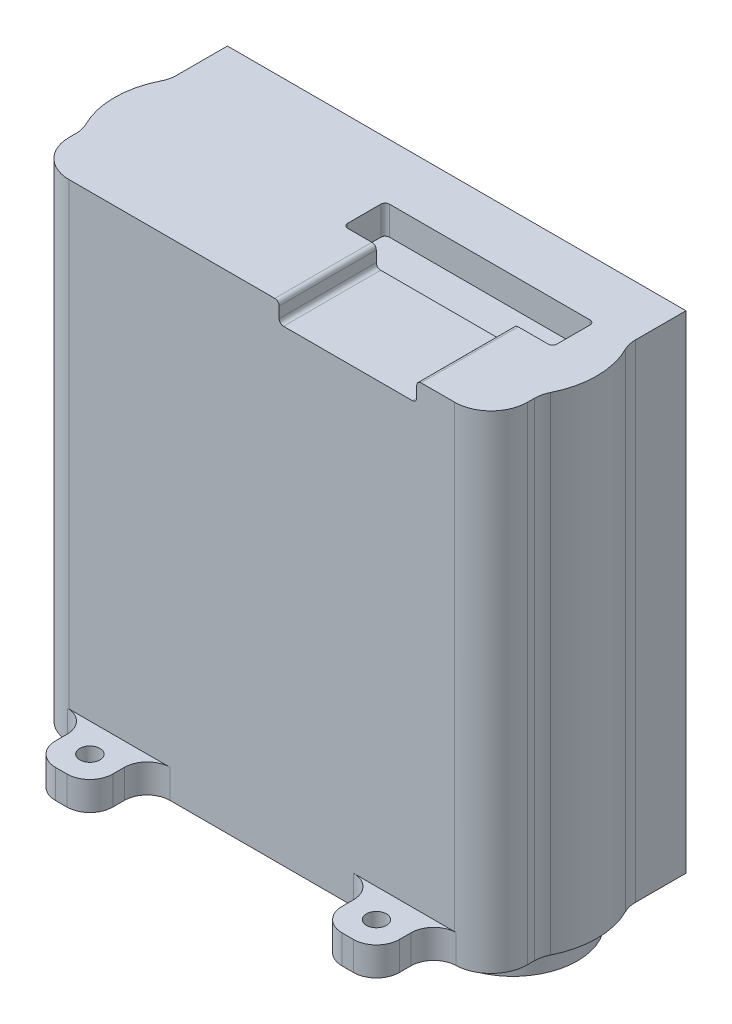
ISO-10303-21;
HEADER;
FILE_DESCRIPTION(('STEP AP214'),'2;1');
FILE_NAME('part.step','',(''),(''),'','','');
FILE_SCHEMA(('AUTOMOTIVE_DESIGN { 1 0 10303 214 1 1 1 1 }'));
ENDSEC;
DATA;
#1=APPLICATION_CONTEXT('core data for automotive mechanical design processes');
#2=APPLICATION_PROTOCOL_DEFINITION('international standard','automotive_design',2000,#1);
#3=PRODUCT_CONTEXT('',#1,'mechanical');
#4=PRODUCT('Part','Part','',(#3));
#5=PRODUCT_RELATED_PRODUCT_CATEGORY('part','',(#4));
#6=PRODUCT_DEFINITION_FORMATION('','',#4);
#7=PRODUCT_DEFINITION_CONTEXT('part definition',#1,'design');
#8=PRODUCT_DEFINITION('design','',#6,#7);
#9=PRODUCT_DEFINITION_SHAPE('','',#8);
#10=(LENGTH_UNIT() NAMED_UNIT(*) SI_UNIT(.MILLI.,.METRE.));
#11=(NAMED_UNIT(*) PLANE_ANGLE_UNIT() SI_UNIT($,.RADIAN.));
#12=(NAMED_UNIT(*) SI_UNIT($,.STERADIAN.) SOLID_ANGLE_UNIT());
#13=UNCERTAINTY_MEASURE_WITH_UNIT(LENGTH_MEASURE(1.E-05),#10,'distance_accuracy_value','');
#14=(GEOMETRIC_REPRESENTATION_CONTEXT(3) GLOBAL_UNCERTAINTY_ASSIGNED_CONTEXT((#13)) GLOBAL_UNIT_ASSIGNED_CONTEXT((#10,
#11,#12)) REPRESENTATION_CONTEXT('',''));
#15=CARTESIAN_POINT('',(0.,0.,0.));
#16=DIRECTION('',(0.,0.,1.));
#17=DIRECTION('',(1.,0.,0.));
#18=AXIS2_PLACEMENT_3D('',#15,#16,#17);
#19=CARTESIAN_POINT('',(-40.,-42.5,89.832));
#20=DIRECTION('',(1.,0.,0.));
#21=DIRECTION('',(0.,0.,-1.));
#22=AXIS2_PLACEMENT_3D('',#19,#20,#21);
#23=PLANE('',#22);
#24=DIRECTION('',(0.,0.,-1.));
#25=VECTOR('',#24,1.);
#26=CARTESIAN_POINT('',(-40.,42.5,89.832));
#27=LINE('',#26,#25);
#28=CARTESIAN_POINT('',(-40.,42.5,83.482));
#29=VERTEX_POINT('',#28);
#30=CARTESIAN_POINT('',(-40.,42.5,82.2557622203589));
#31=VERTEX_POINT('',#30);
#32=EDGE_CURVE('E607',#29,#31,#27,.T.);
#33=ORIENTED_EDGE('',*,*,#32,.T.);
#34=DIRECTION('',(0.,-1.,0.));
#35=VECTOR('',#34,1.);
#36=CARTESIAN_POINT('',(-40.,-42.5,82.2557622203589));
#37=LINE('',#36,#35);
#38=CARTESIAN_POINT('',(-40.,-42.5,82.2557622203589));
#39=VERTEX_POINT('',#38);
#40=EDGE_CURVE('E721',#31,#39,#37,.T.);
#41=ORIENTED_EDGE('',*,*,#40,.T.);
#42=DIRECTION('',(0.,0.,-1.));
#43=VECTOR('',#42,1.);
#44=CARTESIAN_POINT('',(-40.,-42.5,89.832));
#45=LINE('',#44,#43);
#46=CARTESIAN_POINT('',(-40.,-42.5,83.482));
#47=VERTEX_POINT('',#46);
#48=EDGE_CURVE('E603',#47,#39,#45,.T.);
#49=ORIENTED_EDGE('',*,*,#48,.F.);
#50=DIRECTION('',(0.,-1.,0.));
#51=VECTOR('',#50,1.);
#52=CARTESIAN_POINT('',(-40.,-42.5,83.482));
#53=LINE('',#52,#51);
#54=EDGE_CURVE('E703',#47,#29,#53,.F.);
#55=ORIENTED_EDGE('',*,*,#54,.T.);
#56=EDGE_LOOP('',(#33,#41,#49,#55));
#57=FACE_BOUND('',#56,.T.);
#58=ADVANCED_FACE('F52',(#57),#23,.F.);
#59=CARTESIAN_POINT('',(40.,-42.5,89.832));
#60=DIRECTION('',(-1.,0.,0.));
#61=DIRECTION('',(0.,0.,1.));
#62=AXIS2_PLACEMENT_3D('',#59,#60,#61);
#63=PLANE('',#62);
#64=DIRECTION('',(0.,0.,-1.));
#65=VECTOR('',#64,1.);
#66=CARTESIAN_POINT('',(40.,42.5,89.832));
#67=LINE('',#66,#65);
#68=CARTESIAN_POINT('',(40.,42.5,64.6746377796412));
#69=VERTEX_POINT('',#68);
#70=CARTESIAN_POINT('',(40.,42.5,55.832));
#71=VERTEX_POINT('',#70);
#72=EDGE_CURVE('E610',#69,#71,#67,.T.);
#73=ORIENTED_EDGE('',*,*,#72,.F.);
#74=DIRECTION('',(0.,-1.,0.));
#75=VECTOR('',#74,1.);
#76=CARTESIAN_POINT('',(40.,-42.5,64.6746377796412));
#77=LINE('',#76,#75);
#78=CARTESIAN_POINT('',(40.,-42.5,64.6746377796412));
#79=VERTEX_POINT('',#78);
#80=EDGE_CURVE('E711',#69,#79,#77,.T.);
#81=ORIENTED_EDGE('',*,*,#80,.T.);
#82=DIRECTION('',(0.,0.,-1.));
#83=VECTOR('',#82,1.);
#84=CARTESIAN_POINT('',(40.,-42.5,89.832));
#85=LINE('',#84,#83);
#86=CARTESIAN_POINT('',(40.,-42.5,55.832));
#87=VERTEX_POINT('',#86);
#88=EDGE_CURVE('E587',#79,#87,#85,.T.);
#89=ORIENTED_EDGE('',*,*,#88,.T.);
#90=DIRECTION('',(0.,1.,0.));
#91=VECTOR('',#90,1.);
#92=CARTESIAN_POINT('',(40.,-42.5,55.832));
#93=LINE('',#92,#91);
#94=EDGE_CURVE('E573',#87,#71,#93,.T.);
#95=ORIENTED_EDGE('',*,*,#94,.T.);
#96=EDGE_LOOP('',(#73,#81,#89,#95));
#97=FACE_BOUND('',#96,.T.);
#98=ADVANCED_FACE('F866',(#97),#63,.F.);
#99=CARTESIAN_POINT('',(40.,-42.5,83.482));
#100=VERTEX_POINT('',#99);
#101=CARTESIAN_POINT('',(40.,-42.5,82.2557622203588));
#102=VERTEX_POINT('',#101);
#103=EDGE_CURVE('E599',#100,#102,#85,.T.);
#104=ORIENTED_EDGE('',*,*,#103,.T.);
#105=DIRECTION('',(0.,-1.,0.));
#106=VECTOR('',#105,1.);
#107=CARTESIAN_POINT('',(40.,-42.5,82.2557622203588));
#108=LINE('',#107,#106);
#109=CARTESIAN_POINT('',(40.,42.5,82.2557622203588));
#110=VERTEX_POINT('',#109);
#111=EDGE_CURVE('E719',#102,#110,#108,.F.);
#112=ORIENTED_EDGE('',*,*,#111,.T.);
#113=CARTESIAN_POINT('',(40.,42.5,83.482));
#114=VERTEX_POINT('',#113);
#115=EDGE_CURVE('E611',#114,#110,#67,.T.);
#116=ORIENTED_EDGE('',*,*,#115,.F.);
#117=DIRECTION('',(0.,1.,0.));
#118=VECTOR('',#117,1.);
#119=CARTESIAN_POINT('',(40.,-42.5,83.482));
#120=LINE('',#119,#118);
#121=EDGE_CURVE('E709',#114,#100,#120,.F.);
#122=ORIENTED_EDGE('',*,*,#121,.T.);
#123=EDGE_LOOP('',(#104,#112,#116,#122));
#124=FACE_BOUND('',#123,.T.);
#125=ADVANCED_FACE('F873',(#124),#63,.F.);
#126=CARTESIAN_POINT('',(-40.,42.5,89.832));
#127=DIRECTION('',(0.,-1.,0.));
#128=DIRECTION('',(0.,0.,-1.));
#129=AXIS2_PLACEMENT_3D('',#126,#127,#128);
#130=PLANE('',#129);
#131=ORIENTED_EDGE('',*,*,#32,.F.);
#132=CARTESIAN_POINT('',(-33.65,42.5,83.482));
#133=DIRECTION('',(0.,-1.,0.));
#134=DIRECTION('',(0.,0.,-1.));
#135=AXIS2_PLACEMENT_3D('',#132,#133,#134);
#136=CIRCLE('',#135,6.35);
#137=CARTESIAN_POINT('',(-33.65,42.5,89.832));
#138=VERTEX_POINT('',#137);
#139=EDGE_CURVE('E707',#29,#138,#136,.F.);
#140=ORIENTED_EDGE('',*,*,#139,.T.);
#141=DIRECTION('',(-1.,0.,0.));
#142=VECTOR('',#141,1.);
#143=CARTESIAN_POINT('',(-40.,42.5,89.832));
#144=LINE('',#143,#142);
#145=CARTESIAN_POINT('',(2.26810000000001,42.5,89.832));
#146=VERTEX_POINT('',#145);
#147=EDGE_CURVE('E584',#146,#138,#144,.T.);
#148=ORIENTED_EDGE('',*,*,#147,.F.);
#149=DIRECTION('',(0.,0.,-1.));
#150=VECTOR('',#149,1.);
#151=CARTESIAN_POINT('',(2.26810000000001,42.5,89.832));
#152=LINE('',#151,#150);
#153=CARTESIAN_POINT('',(2.26810000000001,42.5,72.895));
#154=VERTEX_POINT('',#153);
#155=EDGE_CURVE('E657',#146,#154,#152,.T.);
#156=ORIENTED_EDGE('',*,*,#155,.T.);
#157=DIRECTION('',(-1.,0.,0.));
#158=VECTOR('',#157,1.);
#159=CARTESIAN_POINT('',(-2.72389999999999,42.5,72.895));
#160=LINE('',#159,#158);
#161=CARTESIAN_POINT('',(-1.96189999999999,42.5,72.895));
#162=VERTEX_POINT('',#161);
#163=EDGE_CURVE('E520',#154,#162,#160,.T.);
#164=ORIENTED_EDGE('',*,*,#163,.T.);
#165=CARTESIAN_POINT('',(-1.96189999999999,42.5,72.133));
#166=DIRECTION('',(0.,-1.,0.));
#167=DIRECTION('',(0.,0.,-1.));
#168=AXIS2_PLACEMENT_3D('',#165,#166,#167);
#169=CIRCLE('',#168,0.762);
#170=CARTESIAN_POINT('',(-2.72389999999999,42.5,72.133));
#171=VERTEX_POINT('',#170);
#172=EDGE_CURVE('E655',#162,#171,#169,.T.);
#173=ORIENTED_EDGE('',*,*,#172,.T.);
#174=DIRECTION('',(0.,0.,-1.));
#175=VECTOR('',#174,1.);
#176=CARTESIAN_POINT('',(-2.72389999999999,42.5,72.895));
#177=LINE('',#176,#175);
#178=CARTESIAN_POINT('',(-2.72389999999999,42.5,66.349));
#179=VERTEX_POINT('',#178);
#180=EDGE_CURVE('E510',#171,#179,#177,.T.);
#181=ORIENTED_EDGE('',*,*,#180,.T.);
#182=CARTESIAN_POINT('',(-1.96189999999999,42.5,66.349));
#183=DIRECTION('',(0.,-1.,0.));
#184=DIRECTION('',(0.,0.,-1.));
#185=AXIS2_PLACEMENT_3D('',#182,#183,#184);
#186=CIRCLE('',#185,0.762);
#187=CARTESIAN_POINT('',(-1.96189999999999,42.5,65.587));
#188=VERTEX_POINT('',#187);
#189=EDGE_CURVE('E643',#179,#188,#186,.T.);
#190=ORIENTED_EDGE('',*,*,#189,.T.);
#191=DIRECTION('',(1.,0.,0.));
#192=VECTOR('',#191,1.);
#193=CARTESIAN_POINT('',(-2.72389999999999,42.5,65.587));
#194=LINE('',#193,#192);
#195=CARTESIAN_POINT('',(33.0221,42.5,65.587));
#196=VERTEX_POINT('',#195);
#197=EDGE_CURVE('E513',#188,#196,#194,.T.);
#198=ORIENTED_EDGE('',*,*,#197,.T.);
#199=CARTESIAN_POINT('',(33.0221,42.5,66.349));
#200=DIRECTION('',(0.,-1.,0.));
#201=DIRECTION('',(0.,0.,-1.));
#202=AXIS2_PLACEMENT_3D('',#199,#200,#201);
#203=CIRCLE('',#202,0.762);
#204=CARTESIAN_POINT('',(33.7841,42.5,66.349));
#205=VERTEX_POINT('',#204);
#206=EDGE_CURVE('E647',#196,#205,#203,.T.);
#207=ORIENTED_EDGE('',*,*,#206,.T.);
#208=DIRECTION('',(0.,0.,1.));
#209=VECTOR('',#208,1.);
#210=CARTESIAN_POINT('',(33.7841,42.5,72.895));
#211=LINE('',#210,#209);
#212=CARTESIAN_POINT('',(33.7841,42.5,72.133));
#213=VERTEX_POINT('',#212);
#214=EDGE_CURVE('E517',#205,#213,#211,.T.);
#215=ORIENTED_EDGE('',*,*,#214,.T.);
#216=CARTESIAN_POINT('',(33.0221,42.5,72.133));
#217=DIRECTION('',(0.,-1.,0.));
#218=DIRECTION('',(0.,0.,-1.));
#219=AXIS2_PLACEMENT_3D('',#216,#217,#218);
#220=CIRCLE('',#219,0.762);
#221=CARTESIAN_POINT('',(33.0221,42.5,72.895));
#222=VERTEX_POINT('',#221);
#223=EDGE_CURVE('E651',#213,#222,#220,.T.);
#224=ORIENTED_EDGE('',*,*,#223,.T.);
#225=CARTESIAN_POINT('',(27.7921,42.5,72.895));
#226=VERTEX_POINT('',#225);
#227=EDGE_CURVE('E521',#222,#226,#160,.T.);
#228=ORIENTED_EDGE('',*,*,#227,.T.);
#229=DIRECTION('',(0.,0.,1.));
#230=VECTOR('',#229,1.);
#231=CARTESIAN_POINT('',(27.7921,42.5,89.832));
#232=LINE('',#231,#230);
#233=CARTESIAN_POINT('',(27.7921,42.5,89.832));
#234=VERTEX_POINT('',#233);
#235=EDGE_CURVE('E660',#226,#234,#232,.T.);
#236=ORIENTED_EDGE('',*,*,#235,.T.);
#237=CARTESIAN_POINT('',(33.65,42.5,89.832));
#238=VERTEX_POINT('',#237);
#239=EDGE_CURVE('E581',#238,#234,#144,.T.);
#240=ORIENTED_EDGE('',*,*,#239,.F.);
#241=CARTESIAN_POINT('',(33.65,42.5,83.482));
#242=DIRECTION('',(0.,-1.,0.));
#243=DIRECTION('',(0.,0.,-1.));
#244=AXIS2_PLACEMENT_3D('',#241,#242,#243);
#245=CIRCLE('',#244,6.35);
#246=EDGE_CURVE('E705',#238,#114,#245,.F.);
#247=ORIENTED_EDGE('',*,*,#246,.T.);
#248=ORIENTED_EDGE('',*,*,#115,.T.);
#249=CARTESIAN_POINT('',(45.,42.5,82.2557622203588));
#250=DIRECTION('',(0.,-1.,0.));
#251=DIRECTION('',(0.,0.,-1.));
#252=AXIS2_PLACEMENT_3D('',#249,#250,#251);
#253=CIRCLE('',#252,5.);
#254=CARTESIAN_POINT('',(40.5291801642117,42.5,80.017063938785));
#255=VERTEX_POINT('',#254);
#256=EDGE_CURVE('E737',#110,#255,#253,.T.);
#257=ORIENTED_EDGE('',*,*,#256,.T.);
#258=CARTESIAN_POINT('',(27.4447,42.5,73.4652));
#259=DIRECTION('',(0.,-1.,0.));
#260=DIRECTION('',(0.,0.,-1.));
#261=AXIS2_PLACEMENT_3D('',#258,#259,#260);
#262=CIRCLE('',#261,14.6332);
#263=CARTESIAN_POINT('',(40.5291801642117,42.5,66.9133360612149));
#264=VERTEX_POINT('',#263);
#265=EDGE_CURVE('E482',#255,#264,#262,.F.);
#266=ORIENTED_EDGE('',*,*,#265,.T.);
#267=CARTESIAN_POINT('',(45.,42.5,64.6746377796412));
#268=DIRECTION('',(0.,-1.,0.));
#269=DIRECTION('',(0.,0.,-1.));
#270=AXIS2_PLACEMENT_3D('',#267,#268,#269);
#271=CIRCLE('',#270,5.);
#272=EDGE_CURVE('E733',#264,#69,#271,.T.);
#273=ORIENTED_EDGE('',*,*,#272,.T.);
#274=ORIENTED_EDGE('',*,*,#72,.T.);
#275=DIRECTION('',(-1.,0.,0.));
#276=VECTOR('',#275,1.);
#277=CARTESIAN_POINT('',(-40.,42.5,55.832));
#278=LINE('',#277,#276);
#279=CARTESIAN_POINT('',(-40.,42.5,55.832));
#280=VERTEX_POINT('',#279);
#281=EDGE_CURVE('E590',#71,#280,#278,.T.);
#282=ORIENTED_EDGE('',*,*,#281,.T.);
#283=CARTESIAN_POINT('',(-40.,42.5,64.6746377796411));
#284=VERTEX_POINT('',#283);
#285=EDGE_CURVE('E606',#284,#280,#27,.T.);
#286=ORIENTED_EDGE('',*,*,#285,.F.);
#287=CARTESIAN_POINT('',(-45.,42.5,64.6746377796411));
#288=DIRECTION('',(0.,-1.,0.));
#289=DIRECTION('',(0.,0.,-1.));
#290=AXIS2_PLACEMENT_3D('',#287,#288,#289);
#291=CIRCLE('',#290,5.);
#292=CARTESIAN_POINT('',(-40.5291801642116,42.5,66.9133360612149));
#293=VERTEX_POINT('',#292);
#294=EDGE_CURVE('E745',#284,#293,#291,.T.);
#295=ORIENTED_EDGE('',*,*,#294,.T.);
#296=CARTESIAN_POINT('',(-27.4447,42.5,73.4652));
#297=DIRECTION('',(0.,-1.,0.));
#298=DIRECTION('',(0.,0.,-1.));
#299=AXIS2_PLACEMENT_3D('',#296,#297,#298);
#300=CIRCLE('',#299,14.6332);
#301=CARTESIAN_POINT('',(-40.5291801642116,42.5,80.0170639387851));
#302=VERTEX_POINT('',#301);
#303=EDGE_CURVE('E476',#293,#302,#300,.F.);
#304=ORIENTED_EDGE('',*,*,#303,.T.);
#305=CARTESIAN_POINT('',(-45.,42.5,82.2557622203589));
#306=DIRECTION('',(0.,-1.,0.));
#307=DIRECTION('',(0.,0.,-1.));
#308=AXIS2_PLACEMENT_3D('',#305,#306,#307);
#309=CIRCLE('',#308,5.);
#310=EDGE_CURVE('E741',#302,#31,#309,.T.);
#311=ORIENTED_EDGE('',*,*,#310,.T.);
#312=EDGE_LOOP('',(#131,#140,#148,#156,#164,#173,#181,#190,#198,#207,#215,#224,#228,#236,#240,
#247,#248,#257,#266,#273,#274,#282,#286,#295,#304,#311));
#313=FACE_BOUND('',#312,.T.);
#314=ADVANCED_FACE('F879',(#313),#130,.F.);
#315=CARTESIAN_POINT('',(-40.,-42.5,64.6746377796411));
#316=VERTEX_POINT('',#315);
#317=CARTESIAN_POINT('',(-40.,-42.5,55.832));
#318=VERTEX_POINT('',#317);
#319=EDGE_CURVE('E602',#316,#318,#45,.T.);
#320=ORIENTED_EDGE('',*,*,#319,.F.);
#321=DIRECTION('',(0.,-1.,0.));
#322=VECTOR('',#321,1.);
#323=CARTESIAN_POINT('',(-40.,-42.5,64.6746377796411));
#324=LINE('',#323,#322);
#325=EDGE_CURVE('E729',#316,#284,#324,.F.);
#326=ORIENTED_EDGE('',*,*,#325,.T.);
#327=ORIENTED_EDGE('',*,*,#285,.T.);
#328=DIRECTION('',(0.,-1.,0.));
#329=VECTOR('',#328,1.);
#330=CARTESIAN_POINT('',(-40.,-42.5,55.832));
#331=LINE('',#330,#329);
#332=EDGE_CURVE('E593',#280,#318,#331,.T.);
#333=ORIENTED_EDGE('',*,*,#332,.T.);
#334=EDGE_LOOP('',(#320,#326,#327,#333));
#335=FACE_BOUND('',#334,.T.);
#336=ADVANCED_FACE('F869',(#335),#23,.F.);
#337=CARTESIAN_POINT('',(-40.,-42.5,89.832));
#338=DIRECTION('',(0.,1.,0.));
#339=DIRECTION('',(0.,0.,1.));
#340=AXIS2_PLACEMENT_3D('',#337,#338,#339);
#341=PLANE('',#340);
#342=DIRECTION('',(1.,0.,0.));
#343=VECTOR('',#342,1.);
#344=CARTESIAN_POINT('',(-27.4447,-42.5,61.832));
#345=LINE('',#344,#343);
#346=CARTESIAN_POINT('',(5.25000000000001,-42.5,61.832));
#347=VERTEX_POINT('',#346);
#348=CARTESIAN_POINT('',(27.4447,-42.5,61.832));
#349=VERTEX_POINT('',#348);
#350=EDGE_CURVE('E562',#347,#349,#345,.T.);
#351=ORIENTED_EDGE('',*,*,#350,.F.);
#352=DIRECTION('',(0.,0.,1.));
#353=VECTOR('',#352,1.);
#354=CARTESIAN_POINT('',(5.25000000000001,-42.5,59.332));
#355=LINE('',#354,#353);
#356=CARTESIAN_POINT('',(5.25000000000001,-42.5,59.332));
#357=VERTEX_POINT('',#356);
#358=EDGE_CURVE('E416',#357,#347,#355,.T.);
#359=ORIENTED_EDGE('',*,*,#358,.F.);
#360=DIRECTION('',(1.,0.,0.));
#361=VECTOR('',#360,1.);
#362=CARTESIAN_POINT('',(-5.24999999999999,-42.5,59.332));
#363=LINE('',#362,#361);
#364=CARTESIAN_POINT('',(-5.24999999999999,-42.5,59.332));
#365=VERTEX_POINT('',#364);
#366=EDGE_CURVE('E419',#365,#357,#363,.T.);
#367=ORIENTED_EDGE('',*,*,#366,.F.);
#368=DIRECTION('',(0.,0.,-1.));
#369=VECTOR('',#368,1.);
#370=CARTESIAN_POINT('',(-5.24999999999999,-42.5,59.332));
#371=LINE('',#370,#369);
#372=CARTESIAN_POINT('',(-5.24999999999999,-42.5,61.832));
#373=VERTEX_POINT('',#372);
#374=EDGE_CURVE('E406',#373,#365,#371,.T.);
#375=ORIENTED_EDGE('',*,*,#374,.F.);
#376=CARTESIAN_POINT('',(-27.4447,-42.5,61.832));
#377=VERTEX_POINT('',#376);
#378=EDGE_CURVE('E563',#377,#373,#345,.T.);
#379=ORIENTED_EDGE('',*,*,#378,.F.);
#380=CARTESIAN_POINT('',(-27.4447,-42.5,73.4652));
#381=DIRECTION('',(0.,-1.,0.));
#382=DIRECTION('',(0.,0.,-1.));
#383=AXIS2_PLACEMENT_3D('',#380,#381,#382);
#384=CIRCLE('',#383,11.6332);
#385=CARTESIAN_POINT('',(-27.4447,-42.5,85.0984));
#386=VERTEX_POINT('',#385);
#387=EDGE_CURVE('E546',#386,#377,#384,.T.);
#388=ORIENTED_EDGE('',*,*,#387,.F.);
#389=DIRECTION('',(-1.,0.,0.));
#390=VECTOR('',#389,1.);
#391=CARTESIAN_POINT('',(-27.4447,-42.5,85.0984));
#392=LINE('',#391,#390);
#393=CARTESIAN_POINT('',(27.4447,-42.5,85.0984));
#394=VERTEX_POINT('',#393);
#395=EDGE_CURVE('E551',#394,#386,#392,.T.);
#396=ORIENTED_EDGE('',*,*,#395,.F.);
#397=CARTESIAN_POINT('',(27.4447,-42.5,73.4652));
#398=DIRECTION('',(0.,-1.,0.));
#399=DIRECTION('',(0.,0.,-1.));
#400=AXIS2_PLACEMENT_3D('',#397,#398,#399);
#401=CIRCLE('',#400,11.6332);
#402=EDGE_CURVE('E566',#349,#394,#401,.T.);
#403=ORIENTED_EDGE('',*,*,#402,.F.);
#404=EDGE_LOOP('',(#351,#359,#367,#375,#379,#388,#396,#403));
#405=FACE_BOUND('',#404,.T.);
#406=DIRECTION('',(0.,0.,1.));
#407=VECTOR('',#406,1.);
#408=CARTESIAN_POINT('',(30.,-42.5,99.832));
#409=LINE('',#408,#407);
#410=CARTESIAN_POINT('',(30.,-42.5,93.8260804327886));
#411=VERTEX_POINT('',#410);
#412=CARTESIAN_POINT('',(30.,-42.5,95.832));
#413=VERTEX_POINT('',#412);
#414=EDGE_CURVE('E443',#411,#413,#409,.T.);
#415=ORIENTED_EDGE('',*,*,#414,.T.);
#416=CARTESIAN_POINT('',(26.,-42.5,95.832));
#417=DIRECTION('',(0.,1.,0.));
#418=DIRECTION('',(0.,0.,1.));
#419=AXIS2_PLACEMENT_3D('',#416,#417,#418);
#420=CIRCLE('',#419,4.);
#421=CARTESIAN_POINT('',(26.,-42.5,99.832));
#422=VERTEX_POINT('',#421);
#423=EDGE_CURVE('E768',#413,#422,#420,.F.);
#424=ORIENTED_EDGE('',*,*,#423,.T.);
#425=DIRECTION('',(-1.,0.,0.));
#426=VECTOR('',#425,1.);
#427=CARTESIAN_POINT('',(30.,-42.5,99.832));
#428=LINE('',#427,#426);
#429=CARTESIAN_POINT('',(24.,-42.5,99.832));
#430=VERTEX_POINT('',#429);
#431=EDGE_CURVE('E432',#422,#430,#428,.T.);
#432=ORIENTED_EDGE('',*,*,#431,.T.);
#433=CARTESIAN_POINT('',(24.,-42.5,95.832));
#434=DIRECTION('',(0.,1.,0.));
#435=DIRECTION('',(0.,0.,1.));
#436=AXIS2_PLACEMENT_3D('',#433,#434,#435);
#437=CIRCLE('',#436,4.);
#438=CARTESIAN_POINT('',(20.,-42.5,95.832));
#439=VERTEX_POINT('',#438);
#440=EDGE_CURVE('E766',#430,#439,#437,.F.);
#441=ORIENTED_EDGE('',*,*,#440,.T.);
#442=DIRECTION('',(0.,0.,-1.));
#443=VECTOR('',#442,1.);
#444=CARTESIAN_POINT('',(20.,-42.5,99.832));
#445=LINE('',#444,#443);
#446=CARTESIAN_POINT('',(20.,-42.5,93.832));
#447=VERTEX_POINT('',#446);
#448=EDGE_CURVE('E426',#439,#447,#445,.T.);
#449=ORIENTED_EDGE('',*,*,#448,.T.);
#450=CARTESIAN_POINT('',(16.,-42.5,93.832));
#451=DIRECTION('',(0.,1.,0.));
#452=DIRECTION('',(0.,0.,1.));
#453=AXIS2_PLACEMENT_3D('',#450,#451,#452);
#454=CIRCLE('',#453,4.);
#455=CARTESIAN_POINT('',(16.,-42.5,89.832));
#456=VERTEX_POINT('',#455);
#457=EDGE_CURVE('E810',#447,#456,#454,.T.);
#458=ORIENTED_EDGE('',*,*,#457,.T.);
#459=DIRECTION('',(1.,0.,0.));
#460=VECTOR('',#459,1.);
#461=CARTESIAN_POINT('',(-40.,-42.5,89.832));
#462=LINE('',#461,#460);
#463=CARTESIAN_POINT('',(-16.,-42.5,89.832));
#464=VERTEX_POINT('',#463);
#465=EDGE_CURVE('E583',#464,#456,#462,.T.);
#466=ORIENTED_EDGE('',*,*,#465,.F.);
#467=CARTESIAN_POINT('',(-16.,-42.5,93.832));
#468=DIRECTION('',(0.,1.,0.));
#469=DIRECTION('',(0.,0.,1.));
#470=AXIS2_PLACEMENT_3D('',#467,#468,#469);
#471=CIRCLE('',#470,4.);
#472=CARTESIAN_POINT('',(-20.,-42.5,93.832));
#473=VERTEX_POINT('',#472);
#474=EDGE_CURVE('E818',#464,#473,#471,.T.);
#475=ORIENTED_EDGE('',*,*,#474,.T.);
#476=DIRECTION('',(0.,0.,1.));
#477=VECTOR('',#476,1.);
#478=CARTESIAN_POINT('',(-20.,-42.5,99.832));
#479=LINE('',#478,#477);
#480=CARTESIAN_POINT('',(-20.,-42.5,95.832));
#481=VERTEX_POINT('',#480);
#482=EDGE_CURVE('E451',#473,#481,#479,.T.);
#483=ORIENTED_EDGE('',*,*,#482,.T.);
#484=CARTESIAN_POINT('',(-24.,-42.5,95.832));
#485=DIRECTION('',(0.,1.,0.));
#486=DIRECTION('',(0.,0.,1.));
#487=AXIS2_PLACEMENT_3D('',#484,#485,#486);
#488=CIRCLE('',#487,4.);
#489=CARTESIAN_POINT('',(-24.,-42.5,99.832));
#490=VERTEX_POINT('',#489);
#491=EDGE_CURVE('E764',#481,#490,#488,.F.);
#492=ORIENTED_EDGE('',*,*,#491,.T.);
#493=DIRECTION('',(-1.,0.,0.));
#494=VECTOR('',#493,1.);
#495=CARTESIAN_POINT('',(-30.,-42.5,99.832));
#496=LINE('',#495,#494);
#497=CARTESIAN_POINT('',(-26.,-42.5,99.832));
#498=VERTEX_POINT('',#497);
#499=EDGE_CURVE('E469',#490,#498,#496,.T.);
#500=ORIENTED_EDGE('',*,*,#499,.T.);
#501=CARTESIAN_POINT('',(-26.,-42.5,95.832));
#502=DIRECTION('',(0.,1.,0.));
#503=DIRECTION('',(0.,0.,1.));
#504=AXIS2_PLACEMENT_3D('',#501,#502,#503);
#505=CIRCLE('',#504,4.);
#506=CARTESIAN_POINT('',(-30.,-42.5,95.832));
#507=VERTEX_POINT('',#506);
#508=EDGE_CURVE('E762',#498,#507,#505,.F.);
#509=ORIENTED_EDGE('',*,*,#508,.T.);
#510=DIRECTION('',(0.,0.,-1.));
#511=VECTOR('',#510,1.);
#512=CARTESIAN_POINT('',(-30.,-42.5,99.832));
#513=LINE('',#512,#511);
#514=CARTESIAN_POINT('',(-30.,-42.5,93.8260804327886));
#515=VERTEX_POINT('',#514);
#516=EDGE_CURVE('E458',#507,#515,#513,.T.);
#517=ORIENTED_EDGE('',*,*,#516,.T.);
#518=CARTESIAN_POINT('',(-34.,-42.5,93.8260804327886));
#519=DIRECTION('',(0.,1.,0.));
#520=DIRECTION('',(0.,0.,1.));
#521=AXIS2_PLACEMENT_3D('',#518,#519,#520);
#522=CIRCLE('',#521,4.);
#523=CARTESIAN_POINT('',(-33.8647342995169,-42.5,89.8283681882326));
#524=VERTEX_POINT('',#523);
#525=EDGE_CURVE('E823',#515,#524,#522,.T.);
#526=ORIENTED_EDGE('',*,*,#525,.T.);
#527=CARTESIAN_POINT('',(-33.65,-42.5,83.482));
#528=DIRECTION('',(0.,1.,0.));
#529=DIRECTION('',(0.,0.,1.));
#530=AXIS2_PLACEMENT_3D('',#527,#528,#529);
#531=CIRCLE('',#530,6.35);
#532=EDGE_CURVE('E701',#524,#47,#531,.F.);
#533=ORIENTED_EDGE('',*,*,#532,.T.);
#534=ORIENTED_EDGE('',*,*,#48,.T.);
#535=CARTESIAN_POINT('',(-45.,-42.5,82.2557622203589));
#536=DIRECTION('',(0.,1.,0.));
#537=DIRECTION('',(0.,0.,1.));
#538=AXIS2_PLACEMENT_3D('',#535,#536,#537);
#539=CIRCLE('',#538,5.);
#540=CARTESIAN_POINT('',(-40.5291801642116,-42.5,80.0170639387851));
#541=VERTEX_POINT('',#540);
#542=EDGE_CURVE('E739',#39,#541,#539,.T.);
#543=ORIENTED_EDGE('',*,*,#542,.T.);
#544=CARTESIAN_POINT('',(-27.4447,-42.5,73.4652));
#545=DIRECTION('',(0.,-1.,0.));
#546=DIRECTION('',(0.,0.,-1.));
#547=AXIS2_PLACEMENT_3D('',#544,#545,#546);
#548=CIRCLE('',#547,14.6332);
#549=CARTESIAN_POINT('',(-40.5291801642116,-42.5,66.9133360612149));
#550=VERTEX_POINT('',#549);
#551=EDGE_CURVE('E466',#541,#550,#548,.T.);
#552=ORIENTED_EDGE('',*,*,#551,.T.);
#553=CARTESIAN_POINT('',(-45.,-42.5,64.6746377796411));
#554=DIRECTION('',(0.,1.,0.));
#555=DIRECTION('',(0.,0.,1.));
#556=AXIS2_PLACEMENT_3D('',#553,#554,#555);
#557=CIRCLE('',#556,5.);
#558=EDGE_CURVE('E743',#550,#316,#557,.T.);
#559=ORIENTED_EDGE('',*,*,#558,.T.);
#560=ORIENTED_EDGE('',*,*,#319,.T.);
#561=DIRECTION('',(1.,0.,0.));
#562=VECTOR('',#561,1.);
#563=CARTESIAN_POINT('',(-40.,-42.5,55.832));
#564=LINE('',#563,#562);
#565=EDGE_CURVE('E596',#318,#87,#564,.T.);
#566=ORIENTED_EDGE('',*,*,#565,.T.);
#567=ORIENTED_EDGE('',*,*,#88,.F.);
#568=CARTESIAN_POINT('',(45.,-42.5,64.6746377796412));
#569=DIRECTION('',(0.,1.,0.));
#570=DIRECTION('',(0.,0.,1.));
#571=AXIS2_PLACEMENT_3D('',#568,#569,#570);
#572=CIRCLE('',#571,5.);
#573=CARTESIAN_POINT('',(40.5291801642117,-42.5,66.9133360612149));
#574=VERTEX_POINT('',#573);
#575=EDGE_CURVE('E731',#79,#574,#572,.T.);
#576=ORIENTED_EDGE('',*,*,#575,.T.);
#577=CARTESIAN_POINT('',(27.4447,-42.5,73.4652));
#578=DIRECTION('',(0.,-1.,0.));
#579=DIRECTION('',(0.,0.,-1.));
#580=AXIS2_PLACEMENT_3D('',#577,#578,#579);
#581=CIRCLE('',#580,14.6332);
#582=CARTESIAN_POINT('',(40.5291801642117,-42.5,80.017063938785));
#583=VERTEX_POINT('',#582);
#584=EDGE_CURVE('E479',#574,#583,#581,.T.);
#585=ORIENTED_EDGE('',*,*,#584,.T.);
#586=CARTESIAN_POINT('',(45.,-42.5,82.2557622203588));
#587=DIRECTION('',(0.,1.,0.));
#588=DIRECTION('',(0.,0.,1.));
#589=AXIS2_PLACEMENT_3D('',#586,#587,#588);
#590=CIRCLE('',#589,5.);
#591=EDGE_CURVE('E735',#583,#102,#590,.T.);
#592=ORIENTED_EDGE('',*,*,#591,.T.);
#593=ORIENTED_EDGE('',*,*,#103,.F.);
#594=CARTESIAN_POINT('',(33.65,-42.5,83.482));
#595=DIRECTION('',(0.,1.,0.));
#596=DIRECTION('',(0.,0.,1.));
#597=AXIS2_PLACEMENT_3D('',#594,#595,#596);
#598=CIRCLE('',#597,6.35);
#599=CARTESIAN_POINT('',(33.8647342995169,-42.5,89.8283681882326));
#600=VERTEX_POINT('',#599);
#601=EDGE_CURVE('E698',#100,#600,#598,.F.);
#602=ORIENTED_EDGE('',*,*,#601,.T.);
#603=CARTESIAN_POINT('',(34.,-42.5,93.8260804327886));
#604=DIRECTION('',(0.,1.,0.));
#605=DIRECTION('',(0.,0.,1.));
#606=AXIS2_PLACEMENT_3D('',#603,#604,#605);
#607=CIRCLE('',#606,4.);
#608=EDGE_CURVE('E814',#600,#411,#607,.T.);
#609=ORIENTED_EDGE('',*,*,#608,.T.);
#610=EDGE_LOOP('',(#415,#424,#432,#441,#449,#458,#466,#475,#483,#492,#500,#509,#517,#526,#533,
#534,#543,#552,#559,#560,#566,#567,#576,#585,#592,#593,#602,#609));
#611=FACE_BOUND('',#610,.T.);
#612=CARTESIAN_POINT('',(-25.,-42.5,94.832));
#613=DIRECTION('',(0.,-1.,0.));
#614=DIRECTION('',(0.,0.,-1.));
#615=AXIS2_PLACEMENT_3D('',#612,#613,#614);
#616=CIRCLE('',#615,1.75);
#617=CARTESIAN_POINT('',(-25.,-42.5,93.082));
#618=VERTEX_POINT('',#617);
#619=EDGE_CURVE('E440',#618,#618,#616,.T.);
#620=ORIENTED_EDGE('',*,*,#619,.F.);
#621=EDGE_LOOP('',(#620));
#622=FACE_BOUND('',#621,.T.);
#623=CARTESIAN_POINT('',(25.,-42.5,94.832));
#624=DIRECTION('',(0.,-1.,0.));
#625=DIRECTION('',(0.,0.,-1.));
#626=AXIS2_PLACEMENT_3D('',#623,#624,#625);
#627=CIRCLE('',#626,1.75);
#628=CARTESIAN_POINT('',(25.,-42.5,93.082));
#629=VERTEX_POINT('',#628);
#630=EDGE_CURVE('E421',#629,#629,#627,.T.);
#631=ORIENTED_EDGE('',*,*,#630,.F.);
#632=EDGE_LOOP('',(#631));
#633=FACE_BOUND('',#632,.T.);
#634=ADVANCED_FACE('F832',(#405,#611,#622,#633),#341,.F.);
#635=CARTESIAN_POINT('',(0.,0.,89.832));
#636=DIRECTION('',(0.,0.,-1.));
#637=DIRECTION('',(-1.,0.,0.));
#638=AXIS2_PLACEMENT_3D('',#635,#636,#637);
#639=PLANE('',#638);
#640=ORIENTED_EDGE('',*,*,#465,.T.);
#641=DIRECTION('',(0.,-1.,0.));
#642=VECTOR('',#641,1.);
#643=CARTESIAN_POINT('',(16.,0.,89.832));
#644=LINE('',#643,#642);
#645=CARTESIAN_POINT('',(16.,-37.5,89.832));
#646=VERTEX_POINT('',#645);
#647=EDGE_CURVE('E755',#456,#646,#644,.F.);
#648=ORIENTED_EDGE('',*,*,#647,.T.);
#649=DIRECTION('',(1.,0.,0.));
#650=VECTOR('',#649,1.);
#651=CARTESIAN_POINT('',(30.,-37.5,89.832));
#652=LINE('',#651,#650);
#653=CARTESIAN_POINT('',(33.65,-37.5,89.832));
#654=VERTEX_POINT('',#653);
#655=EDGE_CURVE('E75',#646,#654,#652,.T.);
#656=ORIENTED_EDGE('',*,*,#655,.T.);
#657=DIRECTION('',(0.,1.,0.));
#658=VECTOR('',#657,1.);
#659=CARTESIAN_POINT('',(33.65,0.,89.832));
#660=LINE('',#659,#658);
#661=EDGE_CURVE('E693',#654,#238,#660,.T.);
#662=ORIENTED_EDGE('',*,*,#661,.T.);
#663=ORIENTED_EDGE('',*,*,#239,.T.);
#664=CARTESIAN_POINT('',(27.7921,41.738,89.832));
#665=DIRECTION('',(0.,0.,-1.));
#666=DIRECTION('',(-1.,0.,0.));
#667=AXIS2_PLACEMENT_3D('',#664,#665,#666);
#668=CIRCLE('',#667,0.762);
#669=CARTESIAN_POINT('',(27.0301,41.738,89.832));
#670=VERTEX_POINT('',#669);
#671=EDGE_CURVE('E665',#234,#670,#668,.F.);
#672=ORIENTED_EDGE('',*,*,#671,.T.);
#673=DIRECTION('',(0.,1.,0.));
#674=VECTOR('',#673,1.);
#675=CARTESIAN_POINT('',(27.0301,45.4,89.832));
#676=LINE('',#675,#674);
#677=CARTESIAN_POINT('',(27.0301,39.812,89.832));
#678=VERTEX_POINT('',#677);
#679=EDGE_CURVE('E543',#678,#670,#676,.T.);
#680=ORIENTED_EDGE('',*,*,#679,.F.);
#681=CARTESIAN_POINT('',(26.2681,39.812,89.832));
#682=DIRECTION('',(0.,0.,-1.));
#683=DIRECTION('',(-1.,0.,0.));
#684=AXIS2_PLACEMENT_3D('',#681,#682,#683);
#685=CIRCLE('',#684,0.762);
#686=CARTESIAN_POINT('',(26.2681,39.05,89.832));
#687=VERTEX_POINT('',#686);
#688=EDGE_CURVE('E685',#678,#687,#685,.T.);
#689=ORIENTED_EDGE('',*,*,#688,.T.);
#690=DIRECTION('',(1.,0.,0.));
#691=VECTOR('',#690,1.);
#692=CARTESIAN_POINT('',(3.03010000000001,39.05,89.832));
#693=LINE('',#692,#691);
#694=CARTESIAN_POINT('',(3.79210000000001,39.05,89.832));
#695=VERTEX_POINT('',#694);
#696=EDGE_CURVE('E540',#695,#687,#693,.T.);
#697=ORIENTED_EDGE('',*,*,#696,.F.);
#698=CARTESIAN_POINT('',(3.79210000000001,39.812,89.832));
#699=DIRECTION('',(0.,0.,-1.));
#700=DIRECTION('',(-1.,0.,0.));
#701=AXIS2_PLACEMENT_3D('',#698,#699,#700);
#702=CIRCLE('',#701,0.762);
#703=CARTESIAN_POINT('',(3.03010000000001,39.812,89.832));
#704=VERTEX_POINT('',#703);
#705=EDGE_CURVE('E689',#695,#704,#702,.T.);
#706=ORIENTED_EDGE('',*,*,#705,.T.);
#707=DIRECTION('',(0.,1.,0.));
#708=VECTOR('',#707,1.);
#709=CARTESIAN_POINT('',(3.03010000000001,0.,89.832));
#710=LINE('',#709,#708);
#711=CARTESIAN_POINT('',(3.03010000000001,41.738,89.832));
#712=VERTEX_POINT('',#711);
#713=EDGE_CURVE('E614',#704,#712,#710,.T.);
#714=ORIENTED_EDGE('',*,*,#713,.T.);
#715=CARTESIAN_POINT('',(2.26810000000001,41.738,89.832));
#716=DIRECTION('',(0.,0.,-1.));
#717=DIRECTION('',(-1.,0.,0.));
#718=AXIS2_PLACEMENT_3D('',#715,#716,#717);
#719=CIRCLE('',#718,0.762);
#720=EDGE_CURVE('E663',#712,#146,#719,.F.);
#721=ORIENTED_EDGE('',*,*,#720,.T.);
#722=ORIENTED_EDGE('',*,*,#147,.T.);
#723=DIRECTION('',(0.,-1.,0.));
#724=VECTOR('',#723,1.);
#725=CARTESIAN_POINT('',(-33.65,0.,89.832));
#726=LINE('',#725,#724);
#727=CARTESIAN_POINT('',(-33.65,-37.5,89.832));
#728=VERTEX_POINT('',#727);
#729=EDGE_CURVE('E695',#138,#728,#726,.T.);
#730=ORIENTED_EDGE('',*,*,#729,.T.);
#731=DIRECTION('',(1.,0.,0.));
#732=VECTOR('',#731,1.);
#733=CARTESIAN_POINT('',(-30.,-37.5,89.832));
#734=LINE('',#733,#732);
#735=CARTESIAN_POINT('',(-16.,-37.5,89.832));
#736=VERTEX_POINT('',#735);
#737=EDGE_CURVE('E464',#728,#736,#734,.T.);
#738=ORIENTED_EDGE('',*,*,#737,.T.);
#739=DIRECTION('',(0.,-1.,0.));
#740=VECTOR('',#739,1.);
#741=CARTESIAN_POINT('',(-16.,0.,89.832));
#742=LINE('',#741,#740);
#743=EDGE_CURVE('E752',#736,#464,#742,.T.);
#744=ORIENTED_EDGE('',*,*,#743,.T.);
#745=EDGE_LOOP('',(#640,#648,#656,#662,#663,#672,#680,#689,#697,#706,#714,#721,#722,#730,#738,#744));
#746=FACE_BOUND('',#745,.T.);
#747=ADVANCED_FACE('F860',(#746),#639,.F.);
#748=CARTESIAN_POINT('',(0.,0.,55.832));
#749=DIRECTION('',(0.,0.,-1.));
#750=DIRECTION('',(-1.,0.,0.));
#751=AXIS2_PLACEMENT_3D('',#748,#749,#750);
#752=PLANE('',#751);
#753=CARTESIAN_POINT('',(-30.,30.,55.832));
#754=DIRECTION('',(0.,0.,-1.));
#755=DIRECTION('',(-1.,0.,0.));
#756=AXIS2_PLACEMENT_3D('',#753,#754,#755);
#757=CIRCLE('',#756,2.8);
#758=CARTESIAN_POINT('',(-32.8,30.,55.832));
#759=VERTEX_POINT('',#758);
#760=EDGE_CURVE('E496',#759,#759,#757,.T.);
#761=ORIENTED_EDGE('',*,*,#760,.F.);
#762=EDGE_LOOP('',(#761));
#763=FACE_BOUND('',#762,.T.);
#764=CARTESIAN_POINT('',(30.,-30.,55.832));
#765=DIRECTION('',(0.,0.,-1.));
#766=DIRECTION('',(-1.,0.,0.));
#767=AXIS2_PLACEMENT_3D('',#764,#765,#766);
#768=CIRCLE('',#767,2.8);
#769=CARTESIAN_POINT('',(27.2,-30.,55.832));
#770=VERTEX_POINT('',#769);
#771=EDGE_CURVE('E489',#770,#770,#768,.T.);
#772=ORIENTED_EDGE('',*,*,#771,.F.);
#773=EDGE_LOOP('',(#772));
#774=FACE_BOUND('',#773,.T.);
#775=CARTESIAN_POINT('',(-30.,-30.,55.832));
#776=DIRECTION('',(0.,0.,-1.));
#777=DIRECTION('',(-1.,0.,0.));
#778=AXIS2_PLACEMENT_3D('',#775,#776,#777);
#779=CIRCLE('',#778,2.8);
#780=CARTESIAN_POINT('',(-32.8,-30.,55.832));
#781=VERTEX_POINT('',#780);
#782=EDGE_CURVE('E485',#781,#781,#779,.T.);
#783=ORIENTED_EDGE('',*,*,#782,.F.);
#784=EDGE_LOOP('',(#783));
#785=FACE_BOUND('',#784,.T.);
#786=CARTESIAN_POINT('',(30.,30.,55.832));
#787=DIRECTION('',(0.,0.,-1.));
#788=DIRECTION('',(-1.,0.,0.));
#789=AXIS2_PLACEMENT_3D('',#786,#787,#788);
#790=CIRCLE('',#789,2.8);
#791=CARTESIAN_POINT('',(27.2,30.,55.832));
#792=VERTEX_POINT('',#791);
#793=EDGE_CURVE('E495',#792,#792,#790,.T.);
#794=ORIENTED_EDGE('',*,*,#793,.F.);
#795=EDGE_LOOP('',(#794));
#796=FACE_BOUND('',#795,.T.);
#797=ORIENTED_EDGE('',*,*,#94,.F.);
#798=ORIENTED_EDGE('',*,*,#565,.F.);
#799=ORIENTED_EDGE('',*,*,#332,.F.);
#800=ORIENTED_EDGE('',*,*,#281,.F.);
#801=EDGE_LOOP('',(#797,#798,#799,#800));
#802=FACE_BOUND('',#801,.T.);
#803=ADVANCED_FACE('F853',(#763,#774,#785,#796,#802),#752,.T.);
#804=CARTESIAN_POINT('',(-27.4447,37.5,73.4652));
#805=DIRECTION('',(0.,-1.,0.));
#806=DIRECTION('',(0.,0.,-1.));
#807=AXIS2_PLACEMENT_3D('',#804,#805,#806);
#808=CYLINDRICAL_SURFACE('',#807,11.6332);
#809=ORIENTED_EDGE('',*,*,#387,.T.);
#810=DIRECTION('',(0.,-1.,0.));
#811=VECTOR('',#810,1.);
#812=CARTESIAN_POINT('',(-27.4447,37.5,61.832));
#813=LINE('',#812,#811);
#814=CARTESIAN_POINT('',(-27.4447,37.5,61.832));
#815=VERTEX_POINT('',#814);
#816=EDGE_CURVE('E560',#815,#377,#813,.T.);
#817=ORIENTED_EDGE('',*,*,#816,.F.);
#818=CARTESIAN_POINT('',(-27.4447,37.5,73.4652));
#819=DIRECTION('',(0.,-1.,0.));
#820=DIRECTION('',(0.,0.,-1.));
#821=AXIS2_PLACEMENT_3D('',#818,#819,#820);
#822=CIRCLE('',#821,11.6332);
#823=CARTESIAN_POINT('',(-27.4447,37.5,85.0984));
#824=VERTEX_POINT('',#823);
#825=EDGE_CURVE('E547',#824,#815,#822,.T.);
#826=ORIENTED_EDGE('',*,*,#825,.F.);
#827=DIRECTION('',(0.,-1.,0.));
#828=VECTOR('',#827,1.);
#829=CARTESIAN_POINT('',(-27.4447,37.5,85.0984));
#830=LINE('',#829,#828);
#831=EDGE_CURVE('E571',#824,#386,#830,.T.);
#832=ORIENTED_EDGE('',*,*,#831,.T.);
#833=EDGE_LOOP('',(#809,#817,#826,#832));
#834=FACE_BOUND('',#833,.T.);
#835=ADVANCED_FACE('F851',(#834),#808,.F.);
#836=CARTESIAN_POINT('',(-27.4447,37.5,85.0984));
#837=DIRECTION('',(0.,0.,1.));
#838=DIRECTION('',(1.,0.,0.));
#839=AXIS2_PLACEMENT_3D('',#836,#837,#838);
#840=PLANE('',#839);
#841=ORIENTED_EDGE('',*,*,#395,.T.);
#842=ORIENTED_EDGE('',*,*,#831,.F.);
#843=DIRECTION('',(-1.,0.,0.));
#844=VECTOR('',#843,1.);
#845=CARTESIAN_POINT('',(-27.4447,37.5,85.0984));
#846=LINE('',#845,#844);
#847=CARTESIAN_POINT('',(27.4447,37.5,85.0984));
#848=VERTEX_POINT('',#847);
#849=EDGE_CURVE('E557',#848,#824,#846,.T.);
#850=ORIENTED_EDGE('',*,*,#849,.F.);
#851=DIRECTION('',(0.,-1.,0.));
#852=VECTOR('',#851,1.);
#853=CARTESIAN_POINT('',(27.4447,37.5,85.0984));
#854=LINE('',#853,#852);
#855=EDGE_CURVE('E574',#848,#394,#854,.T.);
#856=ORIENTED_EDGE('',*,*,#855,.T.);
#857=EDGE_LOOP('',(#841,#842,#850,#856));
#858=FACE_BOUND('',#857,.T.);
#859=ADVANCED_FACE('F845',(#858),#840,.F.);
#860=CARTESIAN_POINT('',(27.4447,37.5,73.4652));
#861=DIRECTION('',(0.,-1.,0.));
#862=DIRECTION('',(0.,0.,-1.));
#863=AXIS2_PLACEMENT_3D('',#860,#861,#862);
#864=CYLINDRICAL_SURFACE('',#863,11.6332);
#865=ORIENTED_EDGE('',*,*,#402,.T.);
#866=ORIENTED_EDGE('',*,*,#855,.F.);
#867=CARTESIAN_POINT('',(27.4447,37.5,73.4652));
#868=DIRECTION('',(0.,-1.,0.));
#869=DIRECTION('',(0.,0.,-1.));
#870=AXIS2_PLACEMENT_3D('',#867,#868,#869);
#871=CIRCLE('',#870,11.6332);
#872=CARTESIAN_POINT('',(27.4447,37.5,61.832));
#873=VERTEX_POINT('',#872);
#874=EDGE_CURVE('E554',#873,#848,#871,.T.);
#875=ORIENTED_EDGE('',*,*,#874,.F.);
#876=DIRECTION('',(0.,-1.,0.));
#877=VECTOR('',#876,1.);
#878=CARTESIAN_POINT('',(27.4447,37.5,61.832));
#879=LINE('',#878,#877);
#880=EDGE_CURVE('E576',#873,#349,#879,.T.);
#881=ORIENTED_EDGE('',*,*,#880,.T.);
#882=EDGE_LOOP('',(#865,#866,#875,#881));
#883=FACE_BOUND('',#882,.T.);
#884=ADVANCED_FACE('F842',(#883),#864,.F.);
#885=CARTESIAN_POINT('',(-27.4447,37.5,61.832));
#886=DIRECTION('',(0.,0.,-1.));
#887=DIRECTION('',(-1.,0.,0.));
#888=AXIS2_PLACEMENT_3D('',#885,#886,#887);
#889=PLANE('',#888);
#890=DIRECTION('',(1.,0.,0.));
#891=VECTOR('',#890,1.);
#892=CARTESIAN_POINT('',(-27.4447,-12.5,61.832));
#893=LINE('',#892,#891);
#894=CARTESIAN_POINT('',(-5.24999999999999,-12.5,61.832));
#895=VERTEX_POINT('',#894);
#896=CARTESIAN_POINT('',(5.25000000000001,-12.5,61.832));
#897=VERTEX_POINT('',#896);
#898=EDGE_CURVE('E398',#895,#897,#893,.T.);
#899=ORIENTED_EDGE('',*,*,#898,.T.);
#900=DIRECTION('',(0.,-1.,0.));
#901=VECTOR('',#900,1.);
#902=CARTESIAN_POINT('',(5.25000000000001,37.5,61.832));
#903=LINE('',#902,#901);
#904=EDGE_CURVE('E14',#897,#347,#903,.T.);
#905=ORIENTED_EDGE('',*,*,#904,.T.);
#906=ORIENTED_EDGE('',*,*,#350,.T.);
#907=ORIENTED_EDGE('',*,*,#880,.F.);
#908=DIRECTION('',(1.,0.,0.));
#909=VECTOR('',#908,1.);
#910=CARTESIAN_POINT('',(-27.4447,37.5,61.832));
#911=LINE('',#910,#909);
#912=EDGE_CURVE('E550',#815,#873,#911,.T.);
#913=ORIENTED_EDGE('',*,*,#912,.F.);
#914=ORIENTED_EDGE('',*,*,#816,.T.);
#915=ORIENTED_EDGE('',*,*,#378,.T.);
#916=DIRECTION('',(0.,1.,0.));
#917=VECTOR('',#916,1.);
#918=CARTESIAN_POINT('',(-5.24999999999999,37.5,61.832));
#919=LINE('',#918,#917);
#920=EDGE_CURVE('E60',#373,#895,#919,.T.);
#921=ORIENTED_EDGE('',*,*,#920,.T.);
#922=EDGE_LOOP('',(#899,#905,#906,#907,#913,#914,#915,#921));
#923=FACE_BOUND('',#922,.T.);
#924=ADVANCED_FACE('F828',(#923),#889,.F.);
#925=CARTESIAN_POINT('',(-27.4447,37.5,73.4652));
#926=DIRECTION('',(0.,-1.,0.));
#927=DIRECTION('',(0.,0.,-1.));
#928=AXIS2_PLACEMENT_3D('',#925,#926,#927);
#929=PLANE('',#928);
#930=DIRECTION('',(0.,0.,-1.));
#931=VECTOR('',#930,1.);
#932=CARTESIAN_POINT('',(-2.72389999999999,37.5,72.895));
#933=LINE('',#932,#931);
#934=CARTESIAN_POINT('',(-2.72389999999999,37.5,72.133));
#935=VERTEX_POINT('',#934);
#936=CARTESIAN_POINT('',(-2.72389999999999,37.5,66.349));
#937=VERTEX_POINT('',#936);
#938=EDGE_CURVE('E507',#935,#937,#933,.T.);
#939=ORIENTED_EDGE('',*,*,#938,.F.);
#940=CARTESIAN_POINT('',(-1.96189999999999,37.5,72.133));
#941=DIRECTION('',(0.,-1.,0.));
#942=DIRECTION('',(0.,0.,-1.));
#943=AXIS2_PLACEMENT_3D('',#940,#941,#942);
#944=CIRCLE('',#943,0.762);
#945=CARTESIAN_POINT('',(-1.96189999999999,37.5,72.895));
#946=VERTEX_POINT('',#945);
#947=EDGE_CURVE('E653',#935,#946,#944,.F.);
#948=ORIENTED_EDGE('',*,*,#947,.T.);
#949=DIRECTION('',(-1.,0.,0.));
#950=VECTOR('',#949,1.);
#951=CARTESIAN_POINT('',(-2.72389999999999,37.5,72.895));
#952=LINE('',#951,#950);
#953=CARTESIAN_POINT('',(33.0221,37.5,72.895));
#954=VERTEX_POINT('',#953);
#955=EDGE_CURVE('E514',#954,#946,#952,.T.);
#956=ORIENTED_EDGE('',*,*,#955,.F.);
#957=CARTESIAN_POINT('',(33.0221,37.5,72.133));
#958=DIRECTION('',(0.,-1.,0.));
#959=DIRECTION('',(0.,0.,-1.));
#960=AXIS2_PLACEMENT_3D('',#957,#958,#959);
#961=CIRCLE('',#960,0.762);
#962=CARTESIAN_POINT('',(33.7841,37.5,72.133));
#963=VERTEX_POINT('',#962);
#964=EDGE_CURVE('E649',#954,#963,#961,.F.);
#965=ORIENTED_EDGE('',*,*,#964,.T.);
#966=DIRECTION('',(0.,0.,1.));
#967=VECTOR('',#966,1.);
#968=CARTESIAN_POINT('',(33.7841,37.5,72.895));
#969=LINE('',#968,#967);
#970=CARTESIAN_POINT('',(33.7841,37.5,66.349));
#971=VERTEX_POINT('',#970);
#972=EDGE_CURVE('E530',#971,#963,#969,.T.);
#973=ORIENTED_EDGE('',*,*,#972,.F.);
#974=CARTESIAN_POINT('',(33.0221,37.5,66.349));
#975=DIRECTION('',(0.,-1.,0.));
#976=DIRECTION('',(0.,0.,-1.));
#977=AXIS2_PLACEMENT_3D('',#974,#975,#976);
#978=CIRCLE('',#977,0.762);
#979=CARTESIAN_POINT('',(33.0221,37.5,65.587));
#980=VERTEX_POINT('',#979);
#981=EDGE_CURVE('E645',#971,#980,#978,.F.);
#982=ORIENTED_EDGE('',*,*,#981,.T.);
#983=DIRECTION('',(1.,0.,0.));
#984=VECTOR('',#983,1.);
#985=CARTESIAN_POINT('',(-2.72389999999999,37.5,65.587));
#986=LINE('',#985,#984);
#987=CARTESIAN_POINT('',(-1.96189999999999,37.5,65.587));
#988=VERTEX_POINT('',#987);
#989=EDGE_CURVE('E527',#988,#980,#986,.T.);
#990=ORIENTED_EDGE('',*,*,#989,.F.);
#991=CARTESIAN_POINT('',(-1.96189999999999,37.5,66.349));
#992=DIRECTION('',(0.,-1.,0.));
#993=DIRECTION('',(0.,0.,-1.));
#994=AXIS2_PLACEMENT_3D('',#991,#992,#993);
#995=CIRCLE('',#994,0.762);
#996=EDGE_CURVE('E641',#988,#937,#995,.F.);
#997=ORIENTED_EDGE('',*,*,#996,.T.);
#998=EDGE_LOOP('',(#939,#948,#956,#965,#973,#982,#990,#997));
#999=FACE_BOUND('',#998,.T.);
#1000=ORIENTED_EDGE('',*,*,#825,.T.);
#1001=ORIENTED_EDGE('',*,*,#912,.T.);
#1002=ORIENTED_EDGE('',*,*,#874,.T.);
#1003=ORIENTED_EDGE('',*,*,#849,.T.);
#1004=EDGE_LOOP('',(#1000,#1001,#1002,#1003));
#1005=FACE_BOUND('',#1004,.T.);
#1006=ADVANCED_FACE('F849',(#999,#1005),#929,.T.);
#1007=CARTESIAN_POINT('',(3.03010000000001,45.4,71.544));
#1008=DIRECTION('',(-1.,0.,0.));
#1009=DIRECTION('',(0.,-1.,0.));
#1010=AXIS2_PLACEMENT_3D('',#1007,#1008,#1009);
#1011=PLANE('',#1010);
#1012=DIRECTION('',(0.,1.,0.));
#1013=VECTOR('',#1012,1.);
#1014=CARTESIAN_POINT('',(3.03010000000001,45.4,72.895));
#1015=LINE('',#1014,#1013);
#1016=CARTESIAN_POINT('',(3.03010000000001,39.812,72.895));
#1017=VERTEX_POINT('',#1016);
#1018=CARTESIAN_POINT('',(3.03010000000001,41.738,72.895));
#1019=VERTEX_POINT('',#1018);
#1020=EDGE_CURVE('E537',#1017,#1019,#1015,.T.);
#1021=ORIENTED_EDGE('',*,*,#1020,.T.);
#1022=DIRECTION('',(0.,0.,-1.));
#1023=VECTOR('',#1022,1.);
#1024=CARTESIAN_POINT('',(3.03010000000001,41.738,71.544));
#1025=LINE('',#1024,#1023);
#1026=EDGE_CURVE('E683',#1019,#712,#1025,.F.);
#1027=ORIENTED_EDGE('',*,*,#1026,.T.);
#1028=ORIENTED_EDGE('',*,*,#713,.F.);
#1029=DIRECTION('',(0.,0.,1.));
#1030=VECTOR('',#1029,1.);
#1031=CARTESIAN_POINT('',(3.03010000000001,39.812,72.895));
#1032=LINE('',#1031,#1030);
#1033=EDGE_CURVE('E681',#704,#1017,#1032,.F.);
#1034=ORIENTED_EDGE('',*,*,#1033,.T.);
#1035=EDGE_LOOP('',(#1021,#1027,#1028,#1034));
#1036=FACE_BOUND('',#1035,.T.);
#1037=ADVANCED_FACE('F1125',(#1036),#1011,.F.);
#1038=CARTESIAN_POINT('',(27.0301,45.4,71.544));
#1039=DIRECTION('',(1.,0.,0.));
#1040=DIRECTION('',(0.,0.,-1.));
#1041=AXIS2_PLACEMENT_3D('',#1038,#1039,#1040);
#1042=PLANE('',#1041);
#1043=ORIENTED_EDGE('',*,*,#679,.T.);
#1044=DIRECTION('',(0.,0.,1.));
#1045=VECTOR('',#1044,1.);
#1046=CARTESIAN_POINT('',(27.0301,41.738,71.544));
#1047=LINE('',#1046,#1045);
#1048=CARTESIAN_POINT('',(27.0301,41.738,72.895));
#1049=VERTEX_POINT('',#1048);
#1050=EDGE_CURVE('E670',#670,#1049,#1047,.F.);
#1051=ORIENTED_EDGE('',*,*,#1050,.T.);
#1052=DIRECTION('',(0.,-1.,0.));
#1053=VECTOR('',#1052,1.);
#1054=CARTESIAN_POINT('',(27.0301,45.4,72.895));
#1055=LINE('',#1054,#1053);
#1056=CARTESIAN_POINT('',(27.0301,39.812,72.895));
#1057=VERTEX_POINT('',#1056);
#1058=EDGE_CURVE('E524',#1049,#1057,#1055,.T.);
#1059=ORIENTED_EDGE('',*,*,#1058,.T.);
#1060=DIRECTION('',(0.,0.,1.));
#1061=VECTOR('',#1060,1.);
#1062=CARTESIAN_POINT('',(27.0301,39.812,89.832));
#1063=LINE('',#1062,#1061);
#1064=EDGE_CURVE('E667',#1057,#678,#1063,.T.);
#1065=ORIENTED_EDGE('',*,*,#1064,.T.);
#1066=EDGE_LOOP('',(#1043,#1051,#1059,#1065));
#1067=FACE_BOUND('',#1066,.T.);
#1068=ADVANCED_FACE('F1122',(#1067),#1042,.F.);
#1069=CARTESIAN_POINT('',(3.03010000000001,39.05,71.544));
#1070=DIRECTION('',(0.,-1.,0.));
#1071=DIRECTION('',(0.,0.,-1.));
#1072=AXIS2_PLACEMENT_3D('',#1069,#1070,#1071);
#1073=PLANE('',#1072);
#1074=ORIENTED_EDGE('',*,*,#696,.T.);
#1075=DIRECTION('',(0.,0.,1.));
#1076=VECTOR('',#1075,1.);
#1077=CARTESIAN_POINT('',(26.2681,39.05,72.895));
#1078=LINE('',#1077,#1076);
#1079=CARTESIAN_POINT('',(26.2681,39.05,72.895));
#1080=VERTEX_POINT('',#1079);
#1081=EDGE_CURVE('E679',#687,#1080,#1078,.F.);
#1082=ORIENTED_EDGE('',*,*,#1081,.T.);
#1083=DIRECTION('',(-1.,0.,0.));
#1084=VECTOR('',#1083,1.);
#1085=CARTESIAN_POINT('',(3.03010000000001,39.05,72.895));
#1086=LINE('',#1085,#1084);
#1087=CARTESIAN_POINT('',(3.79210000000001,39.05,72.895));
#1088=VERTEX_POINT('',#1087);
#1089=EDGE_CURVE('E617',#1080,#1088,#1086,.T.);
#1090=ORIENTED_EDGE('',*,*,#1089,.T.);
#1091=DIRECTION('',(0.,0.,1.));
#1092=VECTOR('',#1091,1.);
#1093=CARTESIAN_POINT('',(3.79210000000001,39.05,89.832));
#1094=LINE('',#1093,#1092);
#1095=EDGE_CURVE('E676',#1088,#695,#1094,.T.);
#1096=ORIENTED_EDGE('',*,*,#1095,.T.);
#1097=EDGE_LOOP('',(#1074,#1082,#1090,#1096));
#1098=FACE_BOUND('',#1097,.T.);
#1099=ADVANCED_FACE('F1115',(#1098),#1073,.F.);
#1100=CARTESIAN_POINT('',(-2.72389999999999,42.5,72.895));
#1101=DIRECTION('',(0.,0.,1.));
#1102=DIRECTION('',(1.,0.,0.));
#1103=AXIS2_PLACEMENT_3D('',#1100,#1101,#1102);
#1104=PLANE('',#1103);
#1105=ORIENTED_EDGE('',*,*,#1058,.F.);
#1106=CARTESIAN_POINT('',(27.7921,41.738,72.895));
#1107=DIRECTION('',(0.,0.,1.));
#1108=DIRECTION('',(1.,0.,0.));
#1109=AXIS2_PLACEMENT_3D('',#1106,#1107,#1108);
#1110=CIRCLE('',#1109,0.762);
#1111=EDGE_CURVE('E674',#1049,#226,#1110,.F.);
#1112=ORIENTED_EDGE('',*,*,#1111,.T.);
#1113=ORIENTED_EDGE('',*,*,#227,.F.);
#1114=DIRECTION('',(0.,-1.,0.));
#1115=VECTOR('',#1114,1.);
#1116=CARTESIAN_POINT('',(33.0221,37.5,72.895));
#1117=LINE('',#1116,#1115);
#1118=EDGE_CURVE('E638',#222,#954,#1117,.T.);
#1119=ORIENTED_EDGE('',*,*,#1118,.T.);
#1120=ORIENTED_EDGE('',*,*,#955,.T.);
#1121=DIRECTION('',(0.,-1.,0.));
#1122=VECTOR('',#1121,1.);
#1123=CARTESIAN_POINT('',(-1.96189999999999,42.5,72.895));
#1124=LINE('',#1123,#1122);
#1125=EDGE_CURVE('E635',#946,#162,#1124,.F.);
#1126=ORIENTED_EDGE('',*,*,#1125,.T.);
#1127=ORIENTED_EDGE('',*,*,#163,.F.);
#1128=CARTESIAN_POINT('',(2.26810000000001,41.738,72.895));
#1129=DIRECTION('',(0.,0.,1.));
#1130=DIRECTION('',(1.,0.,0.));
#1131=AXIS2_PLACEMENT_3D('',#1128,#1129,#1130);
#1132=CIRCLE('',#1131,0.762);
#1133=EDGE_CURVE('E672',#154,#1019,#1132,.F.);
#1134=ORIENTED_EDGE('',*,*,#1133,.T.);
#1135=ORIENTED_EDGE('',*,*,#1020,.F.);
#1136=CARTESIAN_POINT('',(3.79210000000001,39.812,72.895));
#1137=DIRECTION('',(0.,0.,1.));
#1138=DIRECTION('',(1.,0.,0.));
#1139=AXIS2_PLACEMENT_3D('',#1136,#1137,#1138);
#1140=CIRCLE('',#1139,0.762);
#1141=EDGE_CURVE('E691',#1017,#1088,#1140,.T.);
#1142=ORIENTED_EDGE('',*,*,#1141,.T.);
#1143=ORIENTED_EDGE('',*,*,#1089,.F.);
#1144=CARTESIAN_POINT('',(26.2681,39.812,72.895));
#1145=DIRECTION('',(0.,0.,1.));
#1146=DIRECTION('',(1.,0.,0.));
#1147=AXIS2_PLACEMENT_3D('',#1144,#1145,#1146);
#1148=CIRCLE('',#1147,0.762);
#1149=EDGE_CURVE('E687',#1080,#1057,#1148,.T.);
#1150=ORIENTED_EDGE('',*,*,#1149,.T.);
#1151=EDGE_LOOP('',(#1105,#1112,#1113,#1119,#1120,#1126,#1127,#1134,#1135,#1142,#1143,#1150));
#1152=FACE_BOUND('',#1151,.T.);
#1153=ADVANCED_FACE('F924',(#1152),#1104,.F.);
#1154=CARTESIAN_POINT('',(-2.72389999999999,42.5,72.895));
#1155=DIRECTION('',(-1.,0.,0.));
#1156=DIRECTION('',(0.,0.,1.));
#1157=AXIS2_PLACEMENT_3D('',#1154,#1155,#1156);
#1158=PLANE('',#1157);
#1159=ORIENTED_EDGE('',*,*,#938,.T.);
#1160=DIRECTION('',(0.,-1.,0.));
#1161=VECTOR('',#1160,1.);
#1162=CARTESIAN_POINT('',(-2.72389999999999,42.5,66.349));
#1163=LINE('',#1162,#1161);
#1164=EDGE_CURVE('E628',#937,#179,#1163,.F.);
#1165=ORIENTED_EDGE('',*,*,#1164,.T.);
#1166=ORIENTED_EDGE('',*,*,#180,.F.);
#1167=DIRECTION('',(0.,-1.,0.));
#1168=VECTOR('',#1167,1.);
#1169=CARTESIAN_POINT('',(-2.72389999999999,37.5,72.133));
#1170=LINE('',#1169,#1168);
#1171=EDGE_CURVE('E625',#171,#935,#1170,.T.);
#1172=ORIENTED_EDGE('',*,*,#1171,.T.);
#1173=EDGE_LOOP('',(#1159,#1165,#1166,#1172));
#1174=FACE_BOUND('',#1173,.T.);
#1175=ADVANCED_FACE('F935',(#1174),#1158,.F.);
#1176=CARTESIAN_POINT('',(33.7841,42.5,72.895));
#1177=DIRECTION('',(1.,0.,0.));
#1178=DIRECTION('',(0.,0.,-1.));
#1179=AXIS2_PLACEMENT_3D('',#1176,#1177,#1178);
#1180=PLANE('',#1179);
#1181=ORIENTED_EDGE('',*,*,#214,.F.);
#1182=DIRECTION('',(0.,-1.,0.));
#1183=VECTOR('',#1182,1.);
#1184=CARTESIAN_POINT('',(33.7841,37.5,66.349));
#1185=LINE('',#1184,#1183);
#1186=EDGE_CURVE('E632',#205,#971,#1185,.T.);
#1187=ORIENTED_EDGE('',*,*,#1186,.T.);
#1188=ORIENTED_EDGE('',*,*,#972,.T.);
#1189=DIRECTION('',(0.,-1.,0.));
#1190=VECTOR('',#1189,1.);
#1191=CARTESIAN_POINT('',(33.7841,42.5,72.133));
#1192=LINE('',#1191,#1190);
#1193=EDGE_CURVE('E630',#963,#213,#1192,.F.);
#1194=ORIENTED_EDGE('',*,*,#1193,.T.);
#1195=EDGE_LOOP('',(#1181,#1187,#1188,#1194));
#1196=FACE_BOUND('',#1195,.T.);
#1197=ADVANCED_FACE('F953',(#1196),#1180,.F.);
#1198=CARTESIAN_POINT('',(-2.72389999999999,42.5,65.587));
#1199=DIRECTION('',(0.,0.,-1.));
#1200=DIRECTION('',(-1.,0.,0.));
#1201=AXIS2_PLACEMENT_3D('',#1198,#1199,#1200);
#1202=PLANE('',#1201);
#1203=ORIENTED_EDGE('',*,*,#197,.F.);
#1204=DIRECTION('',(0.,-1.,0.));
#1205=VECTOR('',#1204,1.);
#1206=CARTESIAN_POINT('',(-1.96189999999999,37.5,65.587));
#1207=LINE('',#1206,#1205);
#1208=EDGE_CURVE('E622',#188,#988,#1207,.T.);
#1209=ORIENTED_EDGE('',*,*,#1208,.T.);
#1210=ORIENTED_EDGE('',*,*,#989,.T.);
#1211=DIRECTION('',(0.,-1.,0.));
#1212=VECTOR('',#1211,1.);
#1213=CARTESIAN_POINT('',(33.0221,42.5,65.587));
#1214=LINE('',#1213,#1212);
#1215=EDGE_CURVE('E620',#980,#196,#1214,.F.);
#1216=ORIENTED_EDGE('',*,*,#1215,.T.);
#1217=EDGE_LOOP('',(#1203,#1209,#1210,#1216));
#1218=FACE_BOUND('',#1217,.T.);
#1219=ADVANCED_FACE('F944',(#1218),#1202,.F.);
#1220=CARTESIAN_POINT('',(-1.96189999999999,42.5,66.349));
#1221=DIRECTION('',(0.,1.,0.));
#1222=DIRECTION('',(0.,0.,1.));
#1223=AXIS2_PLACEMENT_3D('',#1220,#1221,#1222);
#1224=CYLINDRICAL_SURFACE('',#1223,0.762);
#1225=ORIENTED_EDGE('',*,*,#189,.F.);
#1226=ORIENTED_EDGE('',*,*,#1164,.F.);
#1227=ORIENTED_EDGE('',*,*,#996,.F.);
#1228=ORIENTED_EDGE('',*,*,#1208,.F.);
#1229=EDGE_LOOP('',(#1225,#1226,#1227,#1228));
#1230=FACE_BOUND('',#1229,.T.);
#1231=ADVANCED_FACE('F939',(#1230),#1224,.F.);
#1232=CARTESIAN_POINT('',(33.0221,42.5,66.349));
#1233=DIRECTION('',(0.,1.,0.));
#1234=DIRECTION('',(0.,0.,1.));
#1235=AXIS2_PLACEMENT_3D('',#1232,#1233,#1234);
#1236=CYLINDRICAL_SURFACE('',#1235,0.762);
#1237=ORIENTED_EDGE('',*,*,#206,.F.);
#1238=ORIENTED_EDGE('',*,*,#1215,.F.);
#1239=ORIENTED_EDGE('',*,*,#981,.F.);
#1240=ORIENTED_EDGE('',*,*,#1186,.F.);
#1241=EDGE_LOOP('',(#1237,#1238,#1239,#1240));
#1242=FACE_BOUND('',#1241,.T.);
#1243=ADVANCED_FACE('F948',(#1242),#1236,.F.);
#1244=CARTESIAN_POINT('',(33.0221,42.5,72.133));
#1245=DIRECTION('',(0.,1.,0.));
#1246=DIRECTION('',(0.,0.,1.));
#1247=AXIS2_PLACEMENT_3D('',#1244,#1245,#1246);
#1248=CYLINDRICAL_SURFACE('',#1247,0.762);
#1249=ORIENTED_EDGE('',*,*,#223,.F.);
#1250=ORIENTED_EDGE('',*,*,#1193,.F.);
#1251=ORIENTED_EDGE('',*,*,#964,.F.);
#1252=ORIENTED_EDGE('',*,*,#1118,.F.);
#1253=EDGE_LOOP('',(#1249,#1250,#1251,#1252));
#1254=FACE_BOUND('',#1253,.T.);
#1255=ADVANCED_FACE('F957',(#1254),#1248,.F.);
#1256=CARTESIAN_POINT('',(-1.96189999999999,42.5,72.133));
#1257=DIRECTION('',(0.,1.,0.));
#1258=DIRECTION('',(0.,0.,1.));
#1259=AXIS2_PLACEMENT_3D('',#1256,#1257,#1258);
#1260=CYLINDRICAL_SURFACE('',#1259,0.762);
#1261=ORIENTED_EDGE('',*,*,#172,.F.);
#1262=ORIENTED_EDGE('',*,*,#1125,.F.);
#1263=ORIENTED_EDGE('',*,*,#947,.F.);
#1264=ORIENTED_EDGE('',*,*,#1171,.F.);
#1265=EDGE_LOOP('',(#1261,#1262,#1263,#1264));
#1266=FACE_BOUND('',#1265,.T.);
#1267=ADVANCED_FACE('F931',(#1266),#1260,.F.);
#1268=CARTESIAN_POINT('',(27.7921,41.738,89.832));
#1269=DIRECTION('',(0.,0.,1.));
#1270=DIRECTION('',(1.,0.,0.));
#1271=AXIS2_PLACEMENT_3D('',#1268,#1269,#1270);
#1272=CYLINDRICAL_SURFACE('',#1271,0.762);
#1273=ORIENTED_EDGE('',*,*,#1111,.F.);
#1274=ORIENTED_EDGE('',*,*,#1050,.F.);
#1275=ORIENTED_EDGE('',*,*,#671,.F.);
#1276=ORIENTED_EDGE('',*,*,#235,.F.);
#1277=EDGE_LOOP('',(#1273,#1274,#1275,#1276));
#1278=FACE_BOUND('',#1277,.T.);
#1279=ADVANCED_FACE('F964',(#1278),#1272,.T.);
#1280=CARTESIAN_POINT('',(26.2681,39.812,71.544));
#1281=DIRECTION('',(0.,0.,-1.));
#1282=DIRECTION('',(-1.,0.,0.));
#1283=AXIS2_PLACEMENT_3D('',#1280,#1281,#1282);
#1284=CYLINDRICAL_SURFACE('',#1283,0.762);
#1285=ORIENTED_EDGE('',*,*,#1149,.F.);
#1286=ORIENTED_EDGE('',*,*,#1081,.F.);
#1287=ORIENTED_EDGE('',*,*,#688,.F.);
#1288=ORIENTED_EDGE('',*,*,#1064,.F.);
#1289=EDGE_LOOP('',(#1285,#1286,#1287,#1288));
#1290=FACE_BOUND('',#1289,.T.);
#1291=ADVANCED_FACE('F1219',(#1290),#1284,.F.);
#1292=CARTESIAN_POINT('',(2.26810000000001,41.738,89.832));
#1293=DIRECTION('',(0.,0.,-1.));
#1294=DIRECTION('',(-1.,0.,0.));
#1295=AXIS2_PLACEMENT_3D('',#1292,#1293,#1294);
#1296=CYLINDRICAL_SURFACE('',#1295,0.762);
#1297=ORIENTED_EDGE('',*,*,#720,.F.);
#1298=ORIENTED_EDGE('',*,*,#1026,.F.);
#1299=ORIENTED_EDGE('',*,*,#1133,.F.);
#1300=ORIENTED_EDGE('',*,*,#155,.F.);
#1301=EDGE_LOOP('',(#1297,#1298,#1299,#1300));
#1302=FACE_BOUND('',#1301,.T.);
#1303=ADVANCED_FACE('F920',(#1302),#1296,.T.);
#1304=CARTESIAN_POINT('',(3.79210000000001,39.812,71.544));
#1305=DIRECTION('',(0.,0.,-1.));
#1306=DIRECTION('',(-1.,0.,0.));
#1307=AXIS2_PLACEMENT_3D('',#1304,#1305,#1306);
#1308=CYLINDRICAL_SURFACE('',#1307,0.762);
#1309=ORIENTED_EDGE('',*,*,#1141,.F.);
#1310=ORIENTED_EDGE('',*,*,#1033,.F.);
#1311=ORIENTED_EDGE('',*,*,#705,.F.);
#1312=ORIENTED_EDGE('',*,*,#1095,.F.);
#1313=EDGE_LOOP('',(#1309,#1310,#1311,#1312));
#1314=FACE_BOUND('',#1313,.T.);
#1315=ADVANCED_FACE('F1238',(#1314),#1308,.F.);
#1316=CARTESIAN_POINT('',(-33.65,0.,83.482));
#1317=DIRECTION('',(0.,-1.,0.));
#1318=DIRECTION('',(0.,0.,-1.));
#1319=AXIS2_PLACEMENT_3D('',#1316,#1317,#1318);
#1320=CYLINDRICAL_SURFACE('',#1319,6.35);
#1321=ORIENTED_EDGE('',*,*,#532,.F.);
#1322=DIRECTION('',(0.,-1.,0.));
#1323=VECTOR('',#1322,1.);
#1324=CARTESIAN_POINT('',(-33.8647342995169,0.,89.8283681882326));
#1325=LINE('',#1324,#1323);
#1326=CARTESIAN_POINT('',(-33.8647342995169,-37.5,89.8283681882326));
#1327=VERTEX_POINT('',#1326);
#1328=EDGE_CURVE('E807',#524,#1327,#1325,.F.);
#1329=ORIENTED_EDGE('',*,*,#1328,.T.);
#1330=CARTESIAN_POINT('',(-33.65,-37.5,83.482));
#1331=DIRECTION('',(0.,-1.,0.));
#1332=DIRECTION('',(0.,0.,-1.));
#1333=AXIS2_PLACEMENT_3D('',#1330,#1331,#1332);
#1334=CIRCLE('',#1333,6.35);
#1335=EDGE_CURVE('E804',#1327,#728,#1334,.F.);
#1336=ORIENTED_EDGE('',*,*,#1335,.T.);
#1337=ORIENTED_EDGE('',*,*,#729,.F.);
#1338=ORIENTED_EDGE('',*,*,#139,.F.);
#1339=ORIENTED_EDGE('',*,*,#54,.F.);
#1340=EDGE_LOOP('',(#1321,#1329,#1336,#1337,#1338,#1339));
#1341=FACE_BOUND('',#1340,.T.);
#1342=ADVANCED_FACE('F910',(#1341),#1320,.T.);
#1343=CARTESIAN_POINT('',(33.65,0.,83.482));
#1344=DIRECTION('',(0.,1.,0.));
#1345=DIRECTION('',(0.,0.,1.));
#1346=AXIS2_PLACEMENT_3D('',#1343,#1344,#1345);
#1347=CYLINDRICAL_SURFACE('',#1346,6.35);
#1348=CARTESIAN_POINT('',(33.65,-37.5,83.482));
#1349=DIRECTION('',(0.,1.,0.));
#1350=DIRECTION('',(0.,0.,1.));
#1351=AXIS2_PLACEMENT_3D('',#1348,#1349,#1350);
#1352=CIRCLE('',#1351,6.35);
#1353=CARTESIAN_POINT('',(33.8647342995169,-37.5,89.8283681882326));
#1354=VERTEX_POINT('',#1353);
#1355=EDGE_CURVE('E779',#654,#1354,#1352,.T.);
#1356=ORIENTED_EDGE('',*,*,#1355,.T.);
#1357=DIRECTION('',(0.,1.,0.));
#1358=VECTOR('',#1357,1.);
#1359=CARTESIAN_POINT('',(33.8647342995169,0.,89.8283681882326));
#1360=LINE('',#1359,#1358);
#1361=EDGE_CURVE('E782',#1354,#600,#1360,.F.);
#1362=ORIENTED_EDGE('',*,*,#1361,.T.);
#1363=ORIENTED_EDGE('',*,*,#601,.F.);
#1364=ORIENTED_EDGE('',*,*,#121,.F.);
#1365=ORIENTED_EDGE('',*,*,#246,.F.);
#1366=ORIENTED_EDGE('',*,*,#661,.F.);
#1367=EDGE_LOOP('',(#1356,#1362,#1363,#1364,#1365,#1366));
#1368=FACE_BOUND('',#1367,.T.);
#1369=ADVANCED_FACE('F973',(#1368),#1347,.T.);
#1370=CARTESIAN_POINT('',(30.,30.,59.632));
#1371=DIRECTION('',(0.,0.,-1.));
#1372=DIRECTION('',(-1.,0.,0.));
#1373=AXIS2_PLACEMENT_3D('',#1370,#1371,#1372);
#1374=CYLINDRICAL_SURFACE('',#1373,2.8);
#1375=CARTESIAN_POINT('',(30.,30.,59.632));
#1376=DIRECTION('',(0.,0.,-1.));
#1377=DIRECTION('',(-1.,0.,0.));
#1378=AXIS2_PLACEMENT_3D('',#1375,#1376,#1377);
#1379=CIRCLE('',#1378,2.8);
#1380=CARTESIAN_POINT('',(27.2,30.,59.632));
#1381=VERTEX_POINT('',#1380);
#1382=EDGE_CURVE('E504',#1381,#1381,#1379,.T.);
#1383=CARTESIAN_POINT('',(27.2,30.,59.632));
#1384=CARTESIAN_POINT('',(27.2,30.,59.5924166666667));
#1385=CARTESIAN_POINT('',(27.2,30.,59.5528333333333));
#1386=CARTESIAN_POINT('',(27.2,30.,59.4736666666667));
#1387=CARTESIAN_POINT('',(27.2,30.,59.4340833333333));
#1388=CARTESIAN_POINT('',(27.2,30.,59.3549166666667));
#1389=CARTESIAN_POINT('',(27.2,30.,59.3153333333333));
#1390=CARTESIAN_POINT('',(27.2,30.,59.2361666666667));
#1391=CARTESIAN_POINT('',(27.2,30.,59.1965833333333));
#1392=CARTESIAN_POINT('',(27.2,30.,59.1174166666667));
#1393=CARTESIAN_POINT('',(27.2,30.,59.0778333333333));
#1394=CARTESIAN_POINT('',(27.2,30.,58.9986666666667));
#1395=CARTESIAN_POINT('',(27.2,30.,58.9590833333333));
#1396=CARTESIAN_POINT('',(27.2,30.,58.8799166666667));
#1397=CARTESIAN_POINT('',(27.2,30.,58.8403333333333));
#1398=CARTESIAN_POINT('',(27.2,30.,58.7611666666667));
#1399=CARTESIAN_POINT('',(27.2,30.,58.7215833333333));
#1400=CARTESIAN_POINT('',(27.2,30.,58.6424166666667));
#1401=CARTESIAN_POINT('',(27.2,30.,58.6028333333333));
#1402=CARTESIAN_POINT('',(27.2,30.,58.5236666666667));
#1403=CARTESIAN_POINT('',(27.2,30.,58.4840833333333));
#1404=CARTESIAN_POINT('',(27.2,30.,58.4049166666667));
#1405=CARTESIAN_POINT('',(27.2,30.,58.3653333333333));
#1406=CARTESIAN_POINT('',(27.2,30.,58.2861666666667));
#1407=CARTESIAN_POINT('',(27.2,30.,58.2465833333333));
#1408=CARTESIAN_POINT('',(27.2,30.,58.1674166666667));
#1409=CARTESIAN_POINT('',(27.2,30.,58.1278333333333));
#1410=CARTESIAN_POINT('',(27.2,30.,58.0486666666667));
#1411=CARTESIAN_POINT('',(27.2,30.,58.0090833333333));
#1412=CARTESIAN_POINT('',(27.2,30.,57.9299166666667));
#1413=CARTESIAN_POINT('',(27.2,30.,57.8903333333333));
#1414=CARTESIAN_POINT('',(27.2,30.,57.8111666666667));
#1415=CARTESIAN_POINT('',(27.2,30.,57.7715833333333));
#1416=CARTESIAN_POINT('',(27.2,30.,57.6924166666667));
#1417=CARTESIAN_POINT('',(27.2,30.,57.6528333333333));
#1418=CARTESIAN_POINT('',(27.2,30.,57.5736666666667));
#1419=CARTESIAN_POINT('',(27.2,30.,57.5340833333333));
#1420=CARTESIAN_POINT('',(27.2,30.,57.4549166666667));
#1421=CARTESIAN_POINT('',(27.2,30.,57.4153333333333));
#1422=CARTESIAN_POINT('',(27.2,30.,57.3361666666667));
#1423=CARTESIAN_POINT('',(27.2,30.,57.2965833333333));
#1424=CARTESIAN_POINT('',(27.2,30.,57.2174166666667));
#1425=CARTESIAN_POINT('',(27.2,30.,57.1778333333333));
#1426=CARTESIAN_POINT('',(27.2,30.,57.0986666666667));
#1427=CARTESIAN_POINT('',(27.2,30.,57.0590833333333));
#1428=CARTESIAN_POINT('',(27.2,30.,56.9799166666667));
#1429=CARTESIAN_POINT('',(27.2,30.,56.9403333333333));
#1430=CARTESIAN_POINT('',(27.2,30.,56.8611666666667));
#1431=CARTESIAN_POINT('',(27.2,30.,56.8215833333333));
#1432=CARTESIAN_POINT('',(27.2,30.,56.7424166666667));
#1433=CARTESIAN_POINT('',(27.2,30.,56.7028333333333));
#1434=CARTESIAN_POINT('',(27.2,30.,56.6236666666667));
#1435=CARTESIAN_POINT('',(27.2,30.,56.5840833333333));
#1436=CARTESIAN_POINT('',(27.2,30.,56.5049166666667));
#1437=CARTESIAN_POINT('',(27.2,30.,56.4653333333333));
#1438=CARTESIAN_POINT('',(27.2,30.,56.3861666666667));
#1439=CARTESIAN_POINT('',(27.2,30.,56.3465833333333));
#1440=CARTESIAN_POINT('',(27.2,30.,56.2674166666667));
#1441=CARTESIAN_POINT('',(27.2,30.,56.2278333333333));
#1442=CARTESIAN_POINT('',(27.2,30.,56.1486666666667));
#1443=CARTESIAN_POINT('',(27.2,30.,56.1090833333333));
#1444=CARTESIAN_POINT('',(27.2,30.,56.0299166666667));
#1445=CARTESIAN_POINT('',(27.2,30.,55.9903333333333));
#1446=CARTESIAN_POINT('',(27.2,30.,55.9111666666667));
#1447=CARTESIAN_POINT('',(27.2,30.,55.8715833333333));
#1448=CARTESIAN_POINT('',(27.2,30.,55.832));
#1449=B_SPLINE_CURVE_WITH_KNOTS('',3,(#1383,#1384,#1385,#1386,#1387,#1388,#1389,#1390,#1391,
#1392,#1393,#1394,#1395,#1396,#1397,#1398,#1399,#1400,#1401,#1402,#1403,#1404,#1405,#1406,#1407,
#1408,#1409,#1410,#1411,#1412,#1413,#1414,#1415,#1416,#1417,#1418,#1419,#1420,#1421,#1422,#1423,
#1424,#1425,#1426,#1427,#1428,#1429,#1430,#1431,#1432,#1433,#1434,#1435,#1436,#1437,#1438,#1439,
#1440,#1441,#1442,#1443,#1444,#1445,#1446,#1447,#1448),.UNSPECIFIED.,.F.,.F.,(4,2,2,2,2,2,2,2,2,
2,2,2,2,2,2,2,2,2,2,2,2,2,2,2,2,2,2,2,2,2,2,2,4),(0.,0.118750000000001,0.237500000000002,
0.356250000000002,0.475000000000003,0.593750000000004,0.712500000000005,0.831250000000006,
0.950000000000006,1.06875,1.1875,1.30625,1.425,1.54375,1.6625,1.78125000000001,1.90000000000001,
2.01875,2.1375,2.25625,2.375,2.49375,2.6125,2.73125,2.85000000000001,2.96875,3.0875,3.20625,
3.325,3.44375,3.5625,3.68125,3.8),.UNSPECIFIED.);
#1450=EDGE_CURVE('BSEAM1108',#1381,#792,#1449,.T.);
#1451=ORIENTED_EDGE('',*,*,#1382,.F.);
#1452=ORIENTED_EDGE('',*,*,#793,.T.);
#1453=ORIENTED_EDGE('',*,*,#1450,.T.);
#1454=ORIENTED_EDGE('',*,*,#1450,.F.);
#1455=EDGE_LOOP('',(#1451,#1453,#1452,#1454));
#1456=FACE_BOUND('',#1455,.T.);
#1457=ADVANCED_FACE('F1108',(#1456),#1374,.F.);
#1458=CARTESIAN_POINT('',(30.,30.,59.632));
#1459=DIRECTION('',(0.,0.,-1.));
#1460=DIRECTION('',(-1.,0.,0.));
#1461=AXIS2_PLACEMENT_3D('',#1458,#1459,#1460);
#1462=PLANE('',#1461);
#1463=ORIENTED_EDGE('',*,*,#1382,.T.);
#1464=EDGE_LOOP('',(#1463));
#1465=FACE_BOUND('',#1464,.T.);
#1466=ADVANCED_FACE('F1090',(#1465),#1462,.T.);
#1467=CARTESIAN_POINT('',(-30.,-30.,59.632));
#1468=DIRECTION('',(0.,0.,-1.));
#1469=DIRECTION('',(-1.,0.,0.));
#1470=AXIS2_PLACEMENT_3D('',#1467,#1468,#1469);
#1471=CYLINDRICAL_SURFACE('',#1470,2.8);
#1472=CARTESIAN_POINT('',(-30.,-30.,59.632));
#1473=DIRECTION('',(0.,0.,-1.));
#1474=DIRECTION('',(-1.,0.,0.));
#1475=AXIS2_PLACEMENT_3D('',#1472,#1473,#1474);
#1476=CIRCLE('',#1475,2.8);
#1477=CARTESIAN_POINT('',(-32.8,-30.,59.632));
#1478=VERTEX_POINT('',#1477);
#1479=EDGE_CURVE('E486',#1478,#1478,#1476,.T.);
#1480=CARTESIAN_POINT('',(-32.8,-30.,59.632));
#1481=CARTESIAN_POINT('',(-32.8,-30.,59.5924166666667));
#1482=CARTESIAN_POINT('',(-32.8,-30.,59.5528333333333));
#1483=CARTESIAN_POINT('',(-32.8,-30.,59.4736666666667));
#1484=CARTESIAN_POINT('',(-32.8,-30.,59.4340833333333));
#1485=CARTESIAN_POINT('',(-32.8,-30.,59.3549166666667));
#1486=CARTESIAN_POINT('',(-32.8,-30.,59.3153333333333));
#1487=CARTESIAN_POINT('',(-32.8,-30.,59.2361666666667));
#1488=CARTESIAN_POINT('',(-32.8,-30.,59.1965833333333));
#1489=CARTESIAN_POINT('',(-32.8,-30.,59.1174166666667));
#1490=CARTESIAN_POINT('',(-32.8,-30.,59.0778333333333));
#1491=CARTESIAN_POINT('',(-32.8,-30.,58.9986666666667));
#1492=CARTESIAN_POINT('',(-32.8,-30.,58.9590833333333));
#1493=CARTESIAN_POINT('',(-32.8,-30.,58.8799166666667));
#1494=CARTESIAN_POINT('',(-32.8,-30.,58.8403333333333));
#1495=CARTESIAN_POINT('',(-32.8,-30.,58.7611666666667));
#1496=CARTESIAN_POINT('',(-32.8,-30.,58.7215833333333));
#1497=CARTESIAN_POINT('',(-32.8,-30.,58.6424166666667));
#1498=CARTESIAN_POINT('',(-32.8,-30.,58.6028333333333));
#1499=CARTESIAN_POINT('',(-32.8,-30.,58.5236666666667));
#1500=CARTESIAN_POINT('',(-32.8,-30.,58.4840833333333));
#1501=CARTESIAN_POINT('',(-32.8,-30.,58.4049166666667));
#1502=CARTESIAN_POINT('',(-32.8,-30.,58.3653333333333));
#1503=CARTESIAN_POINT('',(-32.8,-30.,58.2861666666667));
#1504=CARTESIAN_POINT('',(-32.8,-30.,58.2465833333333));
#1505=CARTESIAN_POINT('',(-32.8,-30.,58.1674166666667));
#1506=CARTESIAN_POINT('',(-32.8,-30.,58.1278333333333));
#1507=CARTESIAN_POINT('',(-32.8,-30.,58.0486666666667));
#1508=CARTESIAN_POINT('',(-32.8,-30.,58.0090833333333));
#1509=CARTESIAN_POINT('',(-32.8,-30.,57.9299166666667));
#1510=CARTESIAN_POINT('',(-32.8,-30.,57.8903333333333));
#1511=CARTESIAN_POINT('',(-32.8,-30.,57.8111666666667));
#1512=CARTESIAN_POINT('',(-32.8,-30.,57.7715833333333));
#1513=CARTESIAN_POINT('',(-32.8,-30.,57.6924166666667));
#1514=CARTESIAN_POINT('',(-32.8,-30.,57.6528333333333));
#1515=CARTESIAN_POINT('',(-32.8,-30.,57.5736666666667));
#1516=CARTESIAN_POINT('',(-32.8,-30.,57.5340833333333));
#1517=CARTESIAN_POINT('',(-32.8,-30.,57.4549166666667));
#1518=CARTESIAN_POINT('',(-32.8,-30.,57.4153333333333));
#1519=CARTESIAN_POINT('',(-32.8,-30.,57.3361666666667));
#1520=CARTESIAN_POINT('',(-32.8,-30.,57.2965833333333));
#1521=CARTESIAN_POINT('',(-32.8,-30.,57.2174166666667));
#1522=CARTESIAN_POINT('',(-32.8,-30.,57.1778333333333));
#1523=CARTESIAN_POINT('',(-32.8,-30.,57.0986666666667));
#1524=CARTESIAN_POINT('',(-32.8,-30.,57.0590833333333));
#1525=CARTESIAN_POINT('',(-32.8,-30.,56.9799166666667));
#1526=CARTESIAN_POINT('',(-32.8,-30.,56.9403333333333));
#1527=CARTESIAN_POINT('',(-32.8,-30.,56.8611666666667));
#1528=CARTESIAN_POINT('',(-32.8,-30.,56.8215833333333));
#1529=CARTESIAN_POINT('',(-32.8,-30.,56.7424166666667));
#1530=CARTESIAN_POINT('',(-32.8,-30.,56.7028333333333));
#1531=CARTESIAN_POINT('',(-32.8,-30.,56.6236666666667));
#1532=CARTESIAN_POINT('',(-32.8,-30.,56.5840833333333));
#1533=CARTESIAN_POINT('',(-32.8,-30.,56.5049166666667));
#1534=CARTESIAN_POINT('',(-32.8,-30.,56.4653333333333));
#1535=CARTESIAN_POINT('',(-32.8,-30.,56.3861666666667));
#1536=CARTESIAN_POINT('',(-32.8,-30.,56.3465833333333));
#1537=CARTESIAN_POINT('',(-32.8,-30.,56.2674166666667));
#1538=CARTESIAN_POINT('',(-32.8,-30.,56.2278333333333));
#1539=CARTESIAN_POINT('',(-32.8,-30.,56.1486666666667));
#1540=CARTESIAN_POINT('',(-32.8,-30.,56.1090833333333));
#1541=CARTESIAN_POINT('',(-32.8,-30.,56.0299166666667));
#1542=CARTESIAN_POINT('',(-32.8,-30.,55.9903333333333));
#1543=CARTESIAN_POINT('',(-32.8,-30.,55.9111666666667));
#1544=CARTESIAN_POINT('',(-32.8,-30.,55.8715833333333));
#1545=CARTESIAN_POINT('',(-32.8,-30.,55.832));
#1546=B_SPLINE_CURVE_WITH_KNOTS('',3,(#1480,#1481,#1482,#1483,#1484,#1485,#1486,#1487,#1488,
#1489,#1490,#1491,#1492,#1493,#1494,#1495,#1496,#1497,#1498,#1499,#1500,#1501,#1502,#1503,#1504,
#1505,#1506,#1507,#1508,#1509,#1510,#1511,#1512,#1513,#1514,#1515,#1516,#1517,#1518,#1519,#1520,
#1521,#1522,#1523,#1524,#1525,#1526,#1527,#1528,#1529,#1530,#1531,#1532,#1533,#1534,#1535,#1536,
#1537,#1538,#1539,#1540,#1541,#1542,#1543,#1544,#1545),.UNSPECIFIED.,.F.,.F.,(4,2,2,2,2,2,2,2,2,
2,2,2,2,2,2,2,2,2,2,2,2,2,2,2,2,2,2,2,2,2,2,2,4),(0.,0.118750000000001,0.237500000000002,
0.356250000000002,0.475000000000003,0.593750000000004,0.712500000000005,0.831250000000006,
0.950000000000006,1.06875,1.1875,1.30625,1.425,1.54375,1.6625,1.78125000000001,1.90000000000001,
2.01875,2.1375,2.25625,2.375,2.49375,2.6125,2.73125,2.85000000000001,2.96875,3.0875,3.20625,
3.325,3.44375,3.5625,3.68125,3.8),.UNSPECIFIED.);
#1547=EDGE_CURVE('BSEAM1086',#1478,#781,#1546,.T.);
#1548=ORIENTED_EDGE('',*,*,#1479,.F.);
#1549=ORIENTED_EDGE('',*,*,#782,.T.);
#1550=ORIENTED_EDGE('',*,*,#1547,.T.);
#1551=ORIENTED_EDGE('',*,*,#1547,.F.);
#1552=EDGE_LOOP('',(#1548,#1550,#1549,#1551));
#1553=FACE_BOUND('',#1552,.T.);
#1554=ADVANCED_FACE('F1086',(#1553),#1471,.F.);
#1555=CARTESIAN_POINT('',(-30.,-30.,59.632));
#1556=DIRECTION('',(0.,0.,-1.));
#1557=DIRECTION('',(-1.,0.,0.));
#1558=AXIS2_PLACEMENT_3D('',#1555,#1556,#1557);
#1559=PLANE('',#1558);
#1560=ORIENTED_EDGE('',*,*,#1479,.T.);
#1561=EDGE_LOOP('',(#1560));
#1562=FACE_BOUND('',#1561,.T.);
#1563=ADVANCED_FACE('F1082',(#1562),#1559,.T.);
#1564=CARTESIAN_POINT('',(30.,-30.,59.632));
#1565=DIRECTION('',(0.,0.,-1.));
#1566=DIRECTION('',(-1.,0.,0.));
#1567=AXIS2_PLACEMENT_3D('',#1564,#1565,#1566);
#1568=CYLINDRICAL_SURFACE('',#1567,2.8);
#1569=CARTESIAN_POINT('',(30.,-30.,59.632));
#1570=DIRECTION('',(0.,0.,-1.));
#1571=DIRECTION('',(-1.,0.,0.));
#1572=AXIS2_PLACEMENT_3D('',#1569,#1570,#1571);
#1573=CIRCLE('',#1572,2.8);
#1574=CARTESIAN_POINT('',(27.2,-30.,59.632));
#1575=VERTEX_POINT('',#1574);
#1576=EDGE_CURVE('E499',#1575,#1575,#1573,.T.);
#1577=CARTESIAN_POINT('',(27.2,-30.,59.632));
#1578=CARTESIAN_POINT('',(27.2,-30.,59.5924166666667));
#1579=CARTESIAN_POINT('',(27.2,-30.,59.5528333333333));
#1580=CARTESIAN_POINT('',(27.2,-30.,59.4736666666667));
#1581=CARTESIAN_POINT('',(27.2,-30.,59.4340833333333));
#1582=CARTESIAN_POINT('',(27.2,-30.,59.3549166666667));
#1583=CARTESIAN_POINT('',(27.2,-30.,59.3153333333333));
#1584=CARTESIAN_POINT('',(27.2,-30.,59.2361666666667));
#1585=CARTESIAN_POINT('',(27.2,-30.,59.1965833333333));
#1586=CARTESIAN_POINT('',(27.2,-30.,59.1174166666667));
#1587=CARTESIAN_POINT('',(27.2,-30.,59.0778333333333));
#1588=CARTESIAN_POINT('',(27.2,-30.,58.9986666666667));
#1589=CARTESIAN_POINT('',(27.2,-30.,58.9590833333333));
#1590=CARTESIAN_POINT('',(27.2,-30.,58.8799166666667));
#1591=CARTESIAN_POINT('',(27.2,-30.,58.8403333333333));
#1592=CARTESIAN_POINT('',(27.2,-30.,58.7611666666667));
#1593=CARTESIAN_POINT('',(27.2,-30.,58.7215833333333));
#1594=CARTESIAN_POINT('',(27.2,-30.,58.6424166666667));
#1595=CARTESIAN_POINT('',(27.2,-30.,58.6028333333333));
#1596=CARTESIAN_POINT('',(27.2,-30.,58.5236666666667));
#1597=CARTESIAN_POINT('',(27.2,-30.,58.4840833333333));
#1598=CARTESIAN_POINT('',(27.2,-30.,58.4049166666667));
#1599=CARTESIAN_POINT('',(27.2,-30.,58.3653333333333));
#1600=CARTESIAN_POINT('',(27.2,-30.,58.2861666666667));
#1601=CARTESIAN_POINT('',(27.2,-30.,58.2465833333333));
#1602=CARTESIAN_POINT('',(27.2,-30.,58.1674166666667));
#1603=CARTESIAN_POINT('',(27.2,-30.,58.1278333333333));
#1604=CARTESIAN_POINT('',(27.2,-30.,58.0486666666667));
#1605=CARTESIAN_POINT('',(27.2,-30.,58.0090833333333));
#1606=CARTESIAN_POINT('',(27.2,-30.,57.9299166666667));
#1607=CARTESIAN_POINT('',(27.2,-30.,57.8903333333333));
#1608=CARTESIAN_POINT('',(27.2,-30.,57.8111666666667));
#1609=CARTESIAN_POINT('',(27.2,-30.,57.7715833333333));
#1610=CARTESIAN_POINT('',(27.2,-30.,57.6924166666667));
#1611=CARTESIAN_POINT('',(27.2,-30.,57.6528333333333));
#1612=CARTESIAN_POINT('',(27.2,-30.,57.5736666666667));
#1613=CARTESIAN_POINT('',(27.2,-30.,57.5340833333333));
#1614=CARTESIAN_POINT('',(27.2,-30.,57.4549166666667));
#1615=CARTESIAN_POINT('',(27.2,-30.,57.4153333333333));
#1616=CARTESIAN_POINT('',(27.2,-30.,57.3361666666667));
#1617=CARTESIAN_POINT('',(27.2,-30.,57.2965833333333));
#1618=CARTESIAN_POINT('',(27.2,-30.,57.2174166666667));
#1619=CARTESIAN_POINT('',(27.2,-30.,57.1778333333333));
#1620=CARTESIAN_POINT('',(27.2,-30.,57.0986666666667));
#1621=CARTESIAN_POINT('',(27.2,-30.,57.0590833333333));
#1622=CARTESIAN_POINT('',(27.2,-30.,56.9799166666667));
#1623=CARTESIAN_POINT('',(27.2,-30.,56.9403333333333));
#1624=CARTESIAN_POINT('',(27.2,-30.,56.8611666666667));
#1625=CARTESIAN_POINT('',(27.2,-30.,56.8215833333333));
#1626=CARTESIAN_POINT('',(27.2,-30.,56.7424166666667));
#1627=CARTESIAN_POINT('',(27.2,-30.,56.7028333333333));
#1628=CARTESIAN_POINT('',(27.2,-30.,56.6236666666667));
#1629=CARTESIAN_POINT('',(27.2,-30.,56.5840833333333));
#1630=CARTESIAN_POINT('',(27.2,-30.,56.5049166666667));
#1631=CARTESIAN_POINT('',(27.2,-30.,56.4653333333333));
#1632=CARTESIAN_POINT('',(27.2,-30.,56.3861666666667));
#1633=CARTESIAN_POINT('',(27.2,-30.,56.3465833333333));
#1634=CARTESIAN_POINT('',(27.2,-30.,56.2674166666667));
#1635=CARTESIAN_POINT('',(27.2,-30.,56.2278333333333));
#1636=CARTESIAN_POINT('',(27.2,-30.,56.1486666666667));
#1637=CARTESIAN_POINT('',(27.2,-30.,56.1090833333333));
#1638=CARTESIAN_POINT('',(27.2,-30.,56.0299166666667));
#1639=CARTESIAN_POINT('',(27.2,-30.,55.9903333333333));
#1640=CARTESIAN_POINT('',(27.2,-30.,55.9111666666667));
#1641=CARTESIAN_POINT('',(27.2,-30.,55.8715833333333));
#1642=CARTESIAN_POINT('',(27.2,-30.,55.832));
#1643=B_SPLINE_CURVE_WITH_KNOTS('',3,(#1577,#1578,#1579,#1580,#1581,#1582,#1583,#1584,#1585,
#1586,#1587,#1588,#1589,#1590,#1591,#1592,#1593,#1594,#1595,#1596,#1597,#1598,#1599,#1600,#1601,
#1602,#1603,#1604,#1605,#1606,#1607,#1608,#1609,#1610,#1611,#1612,#1613,#1614,#1615,#1616,#1617,
#1618,#1619,#1620,#1621,#1622,#1623,#1624,#1625,#1626,#1627,#1628,#1629,#1630,#1631,#1632,#1633,
#1634,#1635,#1636,#1637,#1638,#1639,#1640,#1641,#1642),.UNSPECIFIED.,.F.,.F.,(4,2,2,2,2,2,2,2,2,
2,2,2,2,2,2,2,2,2,2,2,2,2,2,2,2,2,2,2,2,2,2,2,4),(0.,0.118750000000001,0.237500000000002,
0.356250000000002,0.475000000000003,0.593750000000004,0.712500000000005,0.831250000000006,
0.950000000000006,1.06875,1.1875,1.30625,1.425,1.54375,1.6625,1.78125000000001,1.90000000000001,
2.01875,2.1375,2.25625,2.375,2.49375,2.6125,2.73125,2.85000000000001,2.96875,3.0875,3.20625,
3.325,3.44375,3.5625,3.68125,3.8),.UNSPECIFIED.);
#1644=EDGE_CURVE('BSEAM1085',#1575,#770,#1643,.T.);
#1645=ORIENTED_EDGE('',*,*,#1576,.F.);
#1646=ORIENTED_EDGE('',*,*,#771,.T.);
#1647=ORIENTED_EDGE('',*,*,#1644,.T.);
#1648=ORIENTED_EDGE('',*,*,#1644,.F.);
#1649=EDGE_LOOP('',(#1645,#1647,#1646,#1648));
#1650=FACE_BOUND('',#1649,.T.);
#1651=ADVANCED_FACE('F1085',(#1650),#1568,.F.);
#1652=CARTESIAN_POINT('',(30.,-30.,59.632));
#1653=DIRECTION('',(0.,0.,-1.));
#1654=DIRECTION('',(-1.,0.,0.));
#1655=AXIS2_PLACEMENT_3D('',#1652,#1653,#1654);
#1656=PLANE('',#1655);
#1657=ORIENTED_EDGE('',*,*,#1576,.T.);
#1658=EDGE_LOOP('',(#1657));
#1659=FACE_BOUND('',#1658,.T.);
#1660=ADVANCED_FACE('F1098',(#1659),#1656,.T.);
#1661=CARTESIAN_POINT('',(-30.,30.,59.632));
#1662=DIRECTION('',(0.,0.,-1.));
#1663=DIRECTION('',(-1.,0.,0.));
#1664=AXIS2_PLACEMENT_3D('',#1661,#1662,#1663);
#1665=CYLINDRICAL_SURFACE('',#1664,2.8);
#1666=CARTESIAN_POINT('',(-30.,30.,59.632));
#1667=DIRECTION('',(0.,0.,-1.));
#1668=DIRECTION('',(-1.,0.,0.));
#1669=AXIS2_PLACEMENT_3D('',#1666,#1667,#1668);
#1670=CIRCLE('',#1669,2.8);
#1671=CARTESIAN_POINT('',(-32.8,30.,59.632));
#1672=VERTEX_POINT('',#1671);
#1673=EDGE_CURVE('E492',#1672,#1672,#1670,.T.);
#1674=CARTESIAN_POINT('',(-32.8,30.,59.632));
#1675=CARTESIAN_POINT('',(-32.8,30.,59.5924166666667));
#1676=CARTESIAN_POINT('',(-32.8,30.,59.5528333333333));
#1677=CARTESIAN_POINT('',(-32.8,30.,59.4736666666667));
#1678=CARTESIAN_POINT('',(-32.8,30.,59.4340833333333));
#1679=CARTESIAN_POINT('',(-32.8,30.,59.3549166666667));
#1680=CARTESIAN_POINT('',(-32.8,30.,59.3153333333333));
#1681=CARTESIAN_POINT('',(-32.8,30.,59.2361666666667));
#1682=CARTESIAN_POINT('',(-32.8,30.,59.1965833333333));
#1683=CARTESIAN_POINT('',(-32.8,30.,59.1174166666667));
#1684=CARTESIAN_POINT('',(-32.8,30.,59.0778333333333));
#1685=CARTESIAN_POINT('',(-32.8,30.,58.9986666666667));
#1686=CARTESIAN_POINT('',(-32.8,30.,58.9590833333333));
#1687=CARTESIAN_POINT('',(-32.8,30.,58.8799166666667));
#1688=CARTESIAN_POINT('',(-32.8,30.,58.8403333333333));
#1689=CARTESIAN_POINT('',(-32.8,30.,58.7611666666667));
#1690=CARTESIAN_POINT('',(-32.8,30.,58.7215833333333));
#1691=CARTESIAN_POINT('',(-32.8,30.,58.6424166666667));
#1692=CARTESIAN_POINT('',(-32.8,30.,58.6028333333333));
#1693=CARTESIAN_POINT('',(-32.8,30.,58.5236666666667));
#1694=CARTESIAN_POINT('',(-32.8,30.,58.4840833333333));
#1695=CARTESIAN_POINT('',(-32.8,30.,58.4049166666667));
#1696=CARTESIAN_POINT('',(-32.8,30.,58.3653333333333));
#1697=CARTESIAN_POINT('',(-32.8,30.,58.2861666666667));
#1698=CARTESIAN_POINT('',(-32.8,30.,58.2465833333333));
#1699=CARTESIAN_POINT('',(-32.8,30.,58.1674166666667));
#1700=CARTESIAN_POINT('',(-32.8,30.,58.1278333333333));
#1701=CARTESIAN_POINT('',(-32.8,30.,58.0486666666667));
#1702=CARTESIAN_POINT('',(-32.8,30.,58.0090833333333));
#1703=CARTESIAN_POINT('',(-32.8,30.,57.9299166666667));
#1704=CARTESIAN_POINT('',(-32.8,30.,57.8903333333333));
#1705=CARTESIAN_POINT('',(-32.8,30.,57.8111666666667));
#1706=CARTESIAN_POINT('',(-32.8,30.,57.7715833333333));
#1707=CARTESIAN_POINT('',(-32.8,30.,57.6924166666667));
#1708=CARTESIAN_POINT('',(-32.8,30.,57.6528333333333));
#1709=CARTESIAN_POINT('',(-32.8,30.,57.5736666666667));
#1710=CARTESIAN_POINT('',(-32.8,30.,57.5340833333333));
#1711=CARTESIAN_POINT('',(-32.8,30.,57.4549166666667));
#1712=CARTESIAN_POINT('',(-32.8,30.,57.4153333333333));
#1713=CARTESIAN_POINT('',(-32.8,30.,57.3361666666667));
#1714=CARTESIAN_POINT('',(-32.8,30.,57.2965833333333));
#1715=CARTESIAN_POINT('',(-32.8,30.,57.2174166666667));
#1716=CARTESIAN_POINT('',(-32.8,30.,57.1778333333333));
#1717=CARTESIAN_POINT('',(-32.8,30.,57.0986666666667));
#1718=CARTESIAN_POINT('',(-32.8,30.,57.0590833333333));
#1719=CARTESIAN_POINT('',(-32.8,30.,56.9799166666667));
#1720=CARTESIAN_POINT('',(-32.8,30.,56.9403333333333));
#1721=CARTESIAN_POINT('',(-32.8,30.,56.8611666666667));
#1722=CARTESIAN_POINT('',(-32.8,30.,56.8215833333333));
#1723=CARTESIAN_POINT('',(-32.8,30.,56.7424166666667));
#1724=CARTESIAN_POINT('',(-32.8,30.,56.7028333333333));
#1725=CARTESIAN_POINT('',(-32.8,30.,56.6236666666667));
#1726=CARTESIAN_POINT('',(-32.8,30.,56.5840833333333));
#1727=CARTESIAN_POINT('',(-32.8,30.,56.5049166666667));
#1728=CARTESIAN_POINT('',(-32.8,30.,56.4653333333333));
#1729=CARTESIAN_POINT('',(-32.8,30.,56.3861666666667));
#1730=CARTESIAN_POINT('',(-32.8,30.,56.3465833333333));
#1731=CARTESIAN_POINT('',(-32.8,30.,56.2674166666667));
#1732=CARTESIAN_POINT('',(-32.8,30.,56.2278333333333));
#1733=CARTESIAN_POINT('',(-32.8,30.,56.1486666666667));
#1734=CARTESIAN_POINT('',(-32.8,30.,56.1090833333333));
#1735=CARTESIAN_POINT('',(-32.8,30.,56.0299166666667));
#1736=CARTESIAN_POINT('',(-32.8,30.,55.9903333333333));
#1737=CARTESIAN_POINT('',(-32.8,30.,55.9111666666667));
#1738=CARTESIAN_POINT('',(-32.8,30.,55.8715833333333));
#1739=CARTESIAN_POINT('',(-32.8,30.,55.832));
#1740=B_SPLINE_CURVE_WITH_KNOTS('',3,(#1674,#1675,#1676,#1677,#1678,#1679,#1680,#1681,#1682,
#1683,#1684,#1685,#1686,#1687,#1688,#1689,#1690,#1691,#1692,#1693,#1694,#1695,#1696,#1697,#1698,
#1699,#1700,#1701,#1702,#1703,#1704,#1705,#1706,#1707,#1708,#1709,#1710,#1711,#1712,#1713,#1714,
#1715,#1716,#1717,#1718,#1719,#1720,#1721,#1722,#1723,#1724,#1725,#1726,#1727,#1728,#1729,#1730,
#1731,#1732,#1733,#1734,#1735,#1736,#1737,#1738,#1739),.UNSPECIFIED.,.F.,.F.,(4,2,2,2,2,2,2,2,2,
2,2,2,2,2,2,2,2,2,2,2,2,2,2,2,2,2,2,2,2,2,2,2,4),(0.,0.118750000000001,0.237500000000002,
0.356250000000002,0.475000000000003,0.593750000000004,0.712500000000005,0.831250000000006,
0.950000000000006,1.06875,1.1875,1.30625,1.425,1.54375,1.6625,1.78125000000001,1.90000000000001,
2.01875,2.1375,2.25625,2.375,2.49375,2.6125,2.73125,2.85000000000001,2.96875,3.0875,3.20625,
3.325,3.44375,3.5625,3.68125,3.8),.UNSPECIFIED.);
#1741=EDGE_CURVE('BSEAM1094',#1672,#759,#1740,.T.);
#1742=ORIENTED_EDGE('',*,*,#1673,.F.);
#1743=ORIENTED_EDGE('',*,*,#760,.T.);
#1744=ORIENTED_EDGE('',*,*,#1741,.T.);
#1745=ORIENTED_EDGE('',*,*,#1741,.F.);
#1746=EDGE_LOOP('',(#1742,#1744,#1743,#1745));
#1747=FACE_BOUND('',#1746,.T.);
#1748=ADVANCED_FACE('F1094',(#1747),#1665,.F.);
#1749=CARTESIAN_POINT('',(-30.,30.,59.632));
#1750=DIRECTION('',(0.,0.,-1.));
#1751=DIRECTION('',(-1.,0.,0.));
#1752=AXIS2_PLACEMENT_3D('',#1749,#1750,#1751);
#1753=PLANE('',#1752);
#1754=ORIENTED_EDGE('',*,*,#1673,.T.);
#1755=EDGE_LOOP('',(#1754));
#1756=FACE_BOUND('',#1755,.T.);
#1757=ADVANCED_FACE('F1081',(#1756),#1753,.T.);
#1758=CARTESIAN_POINT('',(27.4447,57.6755594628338,73.4652));
#1759=DIRECTION('',(0.,-1.,0.));
#1760=DIRECTION('',(0.,0.,-1.));
#1761=AXIS2_PLACEMENT_3D('',#1758,#1759,#1760);
#1762=CYLINDRICAL_SURFACE('',#1761,14.6332);
#1763=ORIENTED_EDGE('',*,*,#584,.F.);
#1764=DIRECTION('',(0.,-1.,0.));
#1765=VECTOR('',#1764,1.);
#1766=CARTESIAN_POINT('',(40.5291801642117,57.6755594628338,66.9133360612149));
#1767=LINE('',#1766,#1765);
#1768=EDGE_CURVE('E717',#574,#264,#1767,.F.);
#1769=ORIENTED_EDGE('',*,*,#1768,.T.);
#1770=ORIENTED_EDGE('',*,*,#265,.F.);
#1771=DIRECTION('',(0.,-1.,0.));
#1772=VECTOR('',#1771,1.);
#1773=CARTESIAN_POINT('',(40.5291801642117,57.6755594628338,80.017063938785));
#1774=LINE('',#1773,#1772);
#1775=EDGE_CURVE('E714',#255,#583,#1774,.T.);
#1776=ORIENTED_EDGE('',*,*,#1775,.T.);
#1777=EDGE_LOOP('',(#1763,#1769,#1770,#1776));
#1778=FACE_BOUND('',#1777,.T.);
#1779=ADVANCED_FACE('F986',(#1778),#1762,.T.);
#1780=CARTESIAN_POINT('',(-27.4447,57.6755594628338,73.4652));
#1781=DIRECTION('',(0.,-1.,0.));
#1782=DIRECTION('',(0.,0.,-1.));
#1783=AXIS2_PLACEMENT_3D('',#1780,#1781,#1782);
#1784=CYLINDRICAL_SURFACE('',#1783,14.6332);
#1785=ORIENTED_EDGE('',*,*,#551,.F.);
#1786=DIRECTION('',(0.,-1.,0.));
#1787=VECTOR('',#1786,1.);
#1788=CARTESIAN_POINT('',(-40.5291801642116,57.6755594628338,80.0170639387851));
#1789=LINE('',#1788,#1787);
#1790=EDGE_CURVE('E727',#541,#302,#1789,.F.);
#1791=ORIENTED_EDGE('',*,*,#1790,.T.);
#1792=ORIENTED_EDGE('',*,*,#303,.F.);
#1793=DIRECTION('',(0.,-1.,0.));
#1794=VECTOR('',#1793,1.);
#1795=CARTESIAN_POINT('',(-40.5291801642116,57.6755594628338,66.9133360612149));
#1796=LINE('',#1795,#1794);
#1797=EDGE_CURVE('E724',#293,#550,#1796,.T.);
#1798=ORIENTED_EDGE('',*,*,#1797,.T.);
#1799=EDGE_LOOP('',(#1785,#1791,#1792,#1798));
#1800=FACE_BOUND('',#1799,.T.);
#1801=ADVANCED_FACE('F900',(#1800),#1784,.T.);
#1802=CARTESIAN_POINT('',(45.,57.6755594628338,64.6746377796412));
#1803=DIRECTION('',(0.,-1.,0.));
#1804=DIRECTION('',(0.,0.,-1.));
#1805=AXIS2_PLACEMENT_3D('',#1802,#1803,#1804);
#1806=CYLINDRICAL_SURFACE('',#1805,5.);
#1807=ORIENTED_EDGE('',*,*,#272,.F.);
#1808=ORIENTED_EDGE('',*,*,#1768,.F.);
#1809=ORIENTED_EDGE('',*,*,#575,.F.);
#1810=ORIENTED_EDGE('',*,*,#80,.F.);
#1811=EDGE_LOOP('',(#1807,#1808,#1809,#1810));
#1812=FACE_BOUND('',#1811,.T.);
#1813=ADVANCED_FACE('F992',(#1812),#1806,.F.);
#1814=CARTESIAN_POINT('',(45.,57.6755594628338,82.2557622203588));
#1815=DIRECTION('',(0.,-1.,0.));
#1816=DIRECTION('',(0.,0.,-1.));
#1817=AXIS2_PLACEMENT_3D('',#1814,#1815,#1816);
#1818=CYLINDRICAL_SURFACE('',#1817,5.);
#1819=ORIENTED_EDGE('',*,*,#256,.F.);
#1820=ORIENTED_EDGE('',*,*,#111,.F.);
#1821=ORIENTED_EDGE('',*,*,#591,.F.);
#1822=ORIENTED_EDGE('',*,*,#1775,.F.);
#1823=EDGE_LOOP('',(#1819,#1820,#1821,#1822));
#1824=FACE_BOUND('',#1823,.T.);
#1825=ADVANCED_FACE('F983',(#1824),#1818,.F.);
#1826=CARTESIAN_POINT('',(-45.,57.6755594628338,82.2557622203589));
#1827=DIRECTION('',(0.,-1.,0.));
#1828=DIRECTION('',(0.,0.,-1.));
#1829=AXIS2_PLACEMENT_3D('',#1826,#1827,#1828);
#1830=CYLINDRICAL_SURFACE('',#1829,5.);
#1831=ORIENTED_EDGE('',*,*,#310,.F.);
#1832=ORIENTED_EDGE('',*,*,#1790,.F.);
#1833=ORIENTED_EDGE('',*,*,#542,.F.);
#1834=ORIENTED_EDGE('',*,*,#40,.F.);
#1835=EDGE_LOOP('',(#1831,#1832,#1833,#1834));
#1836=FACE_BOUND('',#1835,.T.);
#1837=ADVANCED_FACE('F903',(#1836),#1830,.F.);
#1838=CARTESIAN_POINT('',(-45.,57.6755594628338,64.6746377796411));
#1839=DIRECTION('',(0.,-1.,0.));
#1840=DIRECTION('',(0.,0.,-1.));
#1841=AXIS2_PLACEMENT_3D('',#1838,#1839,#1840);
#1842=CYLINDRICAL_SURFACE('',#1841,5.);
#1843=ORIENTED_EDGE('',*,*,#294,.F.);
#1844=ORIENTED_EDGE('',*,*,#325,.F.);
#1845=ORIENTED_EDGE('',*,*,#558,.F.);
#1846=ORIENTED_EDGE('',*,*,#1797,.F.);
#1847=EDGE_LOOP('',(#1843,#1844,#1845,#1846));
#1848=FACE_BOUND('',#1847,.T.);
#1849=ADVANCED_FACE('F893',(#1848),#1842,.F.);
#1850=CARTESIAN_POINT('',(-20.,-37.5,99.832));
#1851=DIRECTION('',(1.,0.,0.));
#1852=DIRECTION('',(0.,0.,-1.));
#1853=AXIS2_PLACEMENT_3D('',#1850,#1851,#1852);
#1854=PLANE('',#1853);
#1855=DIRECTION('',(0.,0.,1.));
#1856=VECTOR('',#1855,1.);
#1857=CARTESIAN_POINT('',(-20.,-37.5,99.832));
#1858=LINE('',#1857,#1856);
#1859=CARTESIAN_POINT('',(-20.,-37.5,93.832));
#1860=VERTEX_POINT('',#1859);
#1861=CARTESIAN_POINT('',(-20.,-37.5,95.832));
#1862=VERTEX_POINT('',#1861);
#1863=EDGE_CURVE('E454',#1860,#1862,#1858,.T.);
#1864=ORIENTED_EDGE('',*,*,#1863,.T.);
#1865=DIRECTION('',(0.,-1.,0.));
#1866=VECTOR('',#1865,1.);
#1867=CARTESIAN_POINT('',(-20.,-37.5,95.832));
#1868=LINE('',#1867,#1866);
#1869=EDGE_CURVE('E787',#1862,#481,#1868,.T.);
#1870=ORIENTED_EDGE('',*,*,#1869,.T.);
#1871=ORIENTED_EDGE('',*,*,#482,.F.);
#1872=DIRECTION('',(0.,-1.,0.));
#1873=VECTOR('',#1872,1.);
#1874=CARTESIAN_POINT('',(-20.,-37.5,93.832));
#1875=LINE('',#1874,#1873);
#1876=EDGE_CURVE('E785',#473,#1860,#1875,.F.);
#1877=ORIENTED_EDGE('',*,*,#1876,.T.);
#1878=EDGE_LOOP('',(#1864,#1870,#1871,#1877));
#1879=FACE_BOUND('',#1878,.T.);
#1880=ADVANCED_FACE('F1012',(#1879),#1854,.T.);
#1881=CARTESIAN_POINT('',(-30.,-37.5,99.832));
#1882=DIRECTION('',(-1.,0.,0.));
#1883=DIRECTION('',(0.,0.,1.));
#1884=AXIS2_PLACEMENT_3D('',#1881,#1882,#1883);
#1885=PLANE('',#1884);
#1886=ORIENTED_EDGE('',*,*,#516,.F.);
#1887=DIRECTION('',(0.,-1.,0.));
#1888=VECTOR('',#1887,1.);
#1889=CARTESIAN_POINT('',(-30.,-37.5,95.832));
#1890=LINE('',#1889,#1888);
#1891=CARTESIAN_POINT('',(-30.,-37.5,95.832));
#1892=VERTEX_POINT('',#1891);
#1893=EDGE_CURVE('E802',#507,#1892,#1890,.F.);
#1894=ORIENTED_EDGE('',*,*,#1893,.T.);
#1895=DIRECTION('',(0.,0.,-1.));
#1896=VECTOR('',#1895,1.);
#1897=CARTESIAN_POINT('',(-30.,-37.5,99.832));
#1898=LINE('',#1897,#1896);
#1899=CARTESIAN_POINT('',(-30.,-37.5,93.8260804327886));
#1900=VERTEX_POINT('',#1899);
#1901=EDGE_CURVE('E461',#1892,#1900,#1898,.T.);
#1902=ORIENTED_EDGE('',*,*,#1901,.T.);
#1903=DIRECTION('',(0.,1.,0.));
#1904=VECTOR('',#1903,1.);
#1905=CARTESIAN_POINT('',(-30.,-42.5,93.8260804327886));
#1906=LINE('',#1905,#1904);
#1907=EDGE_CURVE('E799',#1900,#515,#1906,.F.);
#1908=ORIENTED_EDGE('',*,*,#1907,.T.);
#1909=EDGE_LOOP('',(#1886,#1894,#1902,#1908));
#1910=FACE_BOUND('',#1909,.T.);
#1911=ADVANCED_FACE('F1064',(#1910),#1885,.T.);
#1912=CARTESIAN_POINT('',(-30.,-37.5,99.832));
#1913=DIRECTION('',(0.,0.,1.));
#1914=DIRECTION('',(1.,0.,0.));
#1915=AXIS2_PLACEMENT_3D('',#1912,#1913,#1914);
#1916=PLANE('',#1915);
#1917=ORIENTED_EDGE('',*,*,#499,.F.);
#1918=DIRECTION('',(0.,-1.,0.));
#1919=VECTOR('',#1918,1.);
#1920=CARTESIAN_POINT('',(-24.,-37.5,99.832));
#1921=LINE('',#1920,#1919);
#1922=CARTESIAN_POINT('',(-24.,-37.5,99.832));
#1923=VERTEX_POINT('',#1922);
#1924=EDGE_CURVE('E793',#490,#1923,#1921,.F.);
#1925=ORIENTED_EDGE('',*,*,#1924,.T.);
#1926=DIRECTION('',(-1.,0.,0.));
#1927=VECTOR('',#1926,1.);
#1928=CARTESIAN_POINT('',(-30.,-37.5,99.832));
#1929=LINE('',#1928,#1927);
#1930=CARTESIAN_POINT('',(-26.,-37.5,99.832));
#1931=VERTEX_POINT('',#1930);
#1932=EDGE_CURVE('E457',#1923,#1931,#1929,.T.);
#1933=ORIENTED_EDGE('',*,*,#1932,.T.);
#1934=DIRECTION('',(0.,-1.,0.));
#1935=VECTOR('',#1934,1.);
#1936=CARTESIAN_POINT('',(-26.,-37.5,99.832));
#1937=LINE('',#1936,#1935);
#1938=EDGE_CURVE('E790',#1931,#498,#1937,.T.);
#1939=ORIENTED_EDGE('',*,*,#1938,.T.);
#1940=EDGE_LOOP('',(#1917,#1925,#1933,#1939));
#1941=FACE_BOUND('',#1940,.T.);
#1942=ADVANCED_FACE('F1058',(#1941),#1916,.T.);
#1943=CARTESIAN_POINT('',(0.,-37.5,0.));
#1944=DIRECTION('',(0.,-1.,0.));
#1945=DIRECTION('',(0.,0.,-1.));
#1946=AXIS2_PLACEMENT_3D('',#1943,#1944,#1945);
#1947=PLANE('',#1946);
#1948=CARTESIAN_POINT('',(-25.,-37.5,94.832));
#1949=DIRECTION('',(0.,-1.,0.));
#1950=DIRECTION('',(0.,0.,-1.));
#1951=AXIS2_PLACEMENT_3D('',#1948,#1949,#1950);
#1952=CIRCLE('',#1951,1.75);
#1953=CARTESIAN_POINT('',(-25.,-37.5,93.082));
#1954=VERTEX_POINT('',#1953);
#1955=EDGE_CURVE('E448',#1954,#1954,#1952,.T.);
#1956=ORIENTED_EDGE('',*,*,#1955,.T.);
#1957=EDGE_LOOP('',(#1956));
#1958=FACE_BOUND('',#1957,.T.);
#1959=ORIENTED_EDGE('',*,*,#1932,.F.);
#1960=CARTESIAN_POINT('',(-24.,-37.5,95.832));
#1961=DIRECTION('',(0.,-1.,0.));
#1962=DIRECTION('',(0.,0.,-1.));
#1963=AXIS2_PLACEMENT_3D('',#1960,#1961,#1962);
#1964=CIRCLE('',#1963,4.);
#1965=EDGE_CURVE('E797',#1923,#1862,#1964,.F.);
#1966=ORIENTED_EDGE('',*,*,#1965,.T.);
#1967=ORIENTED_EDGE('',*,*,#1863,.F.);
#1968=CARTESIAN_POINT('',(-16.,-37.5,93.832));
#1969=DIRECTION('',(0.,-1.,0.));
#1970=DIRECTION('',(0.,0.,-1.));
#1971=AXIS2_PLACEMENT_3D('',#1968,#1969,#1970);
#1972=CIRCLE('',#1971,4.);
#1973=EDGE_CURVE('E820',#1860,#736,#1972,.T.);
#1974=ORIENTED_EDGE('',*,*,#1973,.T.);
#1975=ORIENTED_EDGE('',*,*,#737,.F.);
#1976=ORIENTED_EDGE('',*,*,#1335,.F.);
#1977=CARTESIAN_POINT('',(-34.,-37.5,93.8260804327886));
#1978=DIRECTION('',(0.,-1.,0.));
#1979=DIRECTION('',(0.,0.,-1.));
#1980=AXIS2_PLACEMENT_3D('',#1977,#1978,#1979);
#1981=CIRCLE('',#1980,4.);
#1982=EDGE_CURVE('E825',#1327,#1900,#1981,.T.);
#1983=ORIENTED_EDGE('',*,*,#1982,.T.);
#1984=ORIENTED_EDGE('',*,*,#1901,.F.);
#1985=CARTESIAN_POINT('',(-26.,-37.5,95.832));
#1986=DIRECTION('',(0.,-1.,0.));
#1987=DIRECTION('',(0.,0.,-1.));
#1988=AXIS2_PLACEMENT_3D('',#1985,#1986,#1987);
#1989=CIRCLE('',#1988,4.);
#1990=EDGE_CURVE('E795',#1892,#1931,#1989,.F.);
#1991=ORIENTED_EDGE('',*,*,#1990,.T.);
#1992=EDGE_LOOP('',(#1959,#1966,#1967,#1974,#1975,#1976,#1983,#1984,#1991));
#1993=FACE_BOUND('',#1992,.T.);
#1994=ADVANCED_FACE('F1050',(#1958,#1993),#1947,.F.);
#1995=CARTESIAN_POINT('',(-25.,-37.5,94.832));
#1996=DIRECTION('',(0.,-1.,0.));
#1997=DIRECTION('',(0.,0.,-1.));
#1998=AXIS2_PLACEMENT_3D('',#1995,#1996,#1997);
#1999=CYLINDRICAL_SURFACE('',#1998,1.75);
#2000=ORIENTED_EDGE('',*,*,#1955,.F.);
#2001=EDGE_LOOP('',(#2000));
#2002=FACE_BOUND('',#2001,.T.);
#2003=ORIENTED_EDGE('',*,*,#619,.T.);
#2004=EDGE_LOOP('',(#2003));
#2005=FACE_BOUND('',#2004,.T.);
#2006=ADVANCED_FACE('F1473',(#2002,#2005),#1999,.F.);
#2007=CARTESIAN_POINT('',(20.,-37.5,99.832));
#2008=DIRECTION('',(-1.,0.,0.));
#2009=DIRECTION('',(0.,0.,1.));
#2010=AXIS2_PLACEMENT_3D('',#2007,#2008,#2009);
#2011=PLANE('',#2010);
#2012=DIRECTION('',(0.,0.,-1.));
#2013=VECTOR('',#2012,1.);
#2014=CARTESIAN_POINT('',(20.,-37.5,99.832));
#2015=LINE('',#2014,#2013);
#2016=CARTESIAN_POINT('',(20.,-37.5,95.832));
#2017=VERTEX_POINT('',#2016);
#2018=CARTESIAN_POINT('',(20.,-37.5,93.832));
#2019=VERTEX_POINT('',#2018);
#2020=EDGE_CURVE('E429',#2017,#2019,#2015,.T.);
#2021=ORIENTED_EDGE('',*,*,#2020,.T.);
#2022=DIRECTION('',(0.,-1.,0.));
#2023=VECTOR('',#2022,1.);
#2024=CARTESIAN_POINT('',(20.,-37.5,93.832));
#2025=LINE('',#2024,#2023);
#2026=EDGE_CURVE('E749',#2019,#447,#2025,.T.);
#2027=ORIENTED_EDGE('',*,*,#2026,.T.);
#2028=ORIENTED_EDGE('',*,*,#448,.F.);
#2029=DIRECTION('',(0.,-1.,0.));
#2030=VECTOR('',#2029,1.);
#2031=CARTESIAN_POINT('',(20.,-37.5,95.832));
#2032=LINE('',#2031,#2030);
#2033=EDGE_CURVE('E747',#439,#2017,#2032,.F.);
#2034=ORIENTED_EDGE('',*,*,#2033,.T.);
#2035=EDGE_LOOP('',(#2021,#2027,#2028,#2034));
#2036=FACE_BOUND('',#2035,.T.);
#2037=ADVANCED_FACE('F1479',(#2036),#2011,.T.);
#2038=CARTESIAN_POINT('',(30.,-37.5,99.832));
#2039=DIRECTION('',(0.,0.,1.));
#2040=DIRECTION('',(1.,0.,0.));
#2041=AXIS2_PLACEMENT_3D('',#2038,#2039,#2040);
#2042=PLANE('',#2041);
#2043=ORIENTED_EDGE('',*,*,#431,.F.);
#2044=DIRECTION('',(0.,-1.,0.));
#2045=VECTOR('',#2044,1.);
#2046=CARTESIAN_POINT('',(26.,-37.5,99.832));
#2047=LINE('',#2046,#2045);
#2048=CARTESIAN_POINT('',(26.,-37.5,99.832));
#2049=VERTEX_POINT('',#2048);
#2050=EDGE_CURVE('E773',#422,#2049,#2047,.F.);
#2051=ORIENTED_EDGE('',*,*,#2050,.T.);
#2052=DIRECTION('',(-1.,0.,0.));
#2053=VECTOR('',#2052,1.);
#2054=CARTESIAN_POINT('',(30.,-37.5,99.832));
#2055=LINE('',#2054,#2053);
#2056=CARTESIAN_POINT('',(24.,-37.5,99.832));
#2057=VERTEX_POINT('',#2056);
#2058=EDGE_CURVE('E437',#2049,#2057,#2055,.T.);
#2059=ORIENTED_EDGE('',*,*,#2058,.T.);
#2060=DIRECTION('',(0.,-1.,0.));
#2061=VECTOR('',#2060,1.);
#2062=CARTESIAN_POINT('',(24.,-37.5,99.832));
#2063=LINE('',#2062,#2061);
#2064=EDGE_CURVE('E770',#2057,#430,#2063,.T.);
#2065=ORIENTED_EDGE('',*,*,#2064,.T.);
#2066=EDGE_LOOP('',(#2043,#2051,#2059,#2065));
#2067=FACE_BOUND('',#2066,.T.);
#2068=ADVANCED_FACE('F1484',(#2067),#2042,.T.);
#2069=CARTESIAN_POINT('',(30.,-37.5,99.832));
#2070=DIRECTION('',(1.,0.,0.));
#2071=DIRECTION('',(0.,0.,-1.));
#2072=AXIS2_PLACEMENT_3D('',#2069,#2070,#2071);
#2073=PLANE('',#2072);
#2074=DIRECTION('',(0.,0.,1.));
#2075=VECTOR('',#2074,1.);
#2076=CARTESIAN_POINT('',(30.,-37.5,99.832));
#2077=LINE('',#2076,#2075);
#2078=CARTESIAN_POINT('',(30.,-37.5,93.8260804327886));
#2079=VERTEX_POINT('',#2078);
#2080=CARTESIAN_POINT('',(30.,-37.5,95.832));
#2081=VERTEX_POINT('',#2080);
#2082=EDGE_CURVE('E434',#2079,#2081,#2077,.T.);
#2083=ORIENTED_EDGE('',*,*,#2082,.T.);
#2084=DIRECTION('',(0.,-1.,0.));
#2085=VECTOR('',#2084,1.);
#2086=CARTESIAN_POINT('',(30.,-37.5,95.832));
#2087=LINE('',#2086,#2085);
#2088=EDGE_CURVE('E759',#2081,#413,#2087,.T.);
#2089=ORIENTED_EDGE('',*,*,#2088,.T.);
#2090=ORIENTED_EDGE('',*,*,#414,.F.);
#2091=DIRECTION('',(0.,-1.,0.));
#2092=VECTOR('',#2091,1.);
#2093=CARTESIAN_POINT('',(30.,-37.5,93.8260804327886));
#2094=LINE('',#2093,#2092);
#2095=EDGE_CURVE('E757',#411,#2079,#2094,.F.);
#2096=ORIENTED_EDGE('',*,*,#2095,.T.);
#2097=EDGE_LOOP('',(#2083,#2089,#2090,#2096));
#2098=FACE_BOUND('',#2097,.T.);
#2099=ADVANCED_FACE('F1494',(#2098),#2073,.T.);
#2100=CARTESIAN_POINT('',(0.,-37.5,0.));
#2101=DIRECTION('',(0.,1.,0.));
#2102=DIRECTION('',(0.,0.,1.));
#2103=AXIS2_PLACEMENT_3D('',#2100,#2101,#2102);
#2104=PLANE('',#2103);
#2105=CARTESIAN_POINT('',(25.,-37.5,94.832));
#2106=DIRECTION('',(0.,-1.,0.));
#2107=DIRECTION('',(0.,0.,-1.));
#2108=AXIS2_PLACEMENT_3D('',#2105,#2106,#2107);
#2109=CIRCLE('',#2108,1.75);
#2110=CARTESIAN_POINT('',(25.,-37.5,93.082));
#2111=VERTEX_POINT('',#2110);
#2112=EDGE_CURVE('E423',#2111,#2111,#2109,.T.);
#2113=ORIENTED_EDGE('',*,*,#2112,.T.);
#2114=EDGE_LOOP('',(#2113));
#2115=FACE_BOUND('',#2114,.T.);
#2116=ORIENTED_EDGE('',*,*,#2058,.F.);
#2117=CARTESIAN_POINT('',(26.,-37.5,95.832));
#2118=DIRECTION('',(0.,1.,0.));
#2119=DIRECTION('',(0.,0.,1.));
#2120=AXIS2_PLACEMENT_3D('',#2117,#2118,#2119);
#2121=CIRCLE('',#2120,4.);
#2122=EDGE_CURVE('E777',#2049,#2081,#2121,.T.);
#2123=ORIENTED_EDGE('',*,*,#2122,.T.);
#2124=ORIENTED_EDGE('',*,*,#2082,.F.);
#2125=CARTESIAN_POINT('',(34.,-37.5,93.8260804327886));
#2126=DIRECTION('',(0.,1.,0.));
#2127=DIRECTION('',(0.,0.,1.));
#2128=AXIS2_PLACEMENT_3D('',#2125,#2126,#2127);
#2129=CIRCLE('',#2128,4.);
#2130=EDGE_CURVE('E816',#2079,#1354,#2129,.F.);
#2131=ORIENTED_EDGE('',*,*,#2130,.T.);
#2132=ORIENTED_EDGE('',*,*,#1355,.F.);
#2133=ORIENTED_EDGE('',*,*,#655,.F.);
#2134=CARTESIAN_POINT('',(16.,-37.5,93.832));
#2135=DIRECTION('',(0.,1.,0.));
#2136=DIRECTION('',(0.,0.,1.));
#2137=AXIS2_PLACEMENT_3D('',#2134,#2135,#2136);
#2138=CIRCLE('',#2137,4.);
#2139=EDGE_CURVE('E812',#646,#2019,#2138,.F.);
#2140=ORIENTED_EDGE('',*,*,#2139,.T.);
#2141=ORIENTED_EDGE('',*,*,#2020,.F.);
#2142=CARTESIAN_POINT('',(24.,-37.5,95.832));
#2143=DIRECTION('',(0.,1.,0.));
#2144=DIRECTION('',(0.,0.,1.));
#2145=AXIS2_PLACEMENT_3D('',#2142,#2143,#2144);
#2146=CIRCLE('',#2145,4.);
#2147=EDGE_CURVE('E775',#2017,#2057,#2146,.T.);
#2148=ORIENTED_EDGE('',*,*,#2147,.T.);
#2149=EDGE_LOOP('',(#2116,#2123,#2124,#2131,#2132,#2133,#2140,#2141,#2148));
#2150=FACE_BOUND('',#2149,.T.);
#2151=ADVANCED_FACE('F1504',(#2115,#2150),#2104,.T.);
#2152=CARTESIAN_POINT('',(25.,-37.5,94.832));
#2153=DIRECTION('',(0.,-1.,0.));
#2154=DIRECTION('',(0.,0.,-1.));
#2155=AXIS2_PLACEMENT_3D('',#2152,#2153,#2154);
#2156=CYLINDRICAL_SURFACE('',#2155,1.75);
#2157=ORIENTED_EDGE('',*,*,#2112,.F.);
#2158=EDGE_LOOP('',(#2157));
#2159=FACE_BOUND('',#2158,.T.);
#2160=ORIENTED_EDGE('',*,*,#630,.T.);
#2161=EDGE_LOOP('',(#2160));
#2162=FACE_BOUND('',#2161,.T.);
#2163=ADVANCED_FACE('F1017',(#2159,#2162),#2156,.F.);
#2164=CARTESIAN_POINT('',(16.,-37.5,93.832));
#2165=DIRECTION('',(0.,-1.,0.));
#2166=DIRECTION('',(0.,0.,-1.));
#2167=AXIS2_PLACEMENT_3D('',#2164,#2165,#2166);
#2168=CYLINDRICAL_SURFACE('',#2167,4.);
#2169=ORIENTED_EDGE('',*,*,#2139,.F.);
#2170=ORIENTED_EDGE('',*,*,#647,.F.);
#2171=ORIENTED_EDGE('',*,*,#457,.F.);
#2172=ORIENTED_EDGE('',*,*,#2026,.F.);
#2173=EDGE_LOOP('',(#2169,#2170,#2171,#2172));
#2174=FACE_BOUND('',#2173,.T.);
#2175=ADVANCED_FACE('F1013',(#2174),#2168,.F.);
#2176=CARTESIAN_POINT('',(26.,-37.5,95.832));
#2177=DIRECTION('',(0.,-1.,0.));
#2178=DIRECTION('',(0.,0.,-1.));
#2179=AXIS2_PLACEMENT_3D('',#2176,#2177,#2178);
#2180=CYLINDRICAL_SURFACE('',#2179,4.);
#2181=ORIENTED_EDGE('',*,*,#2122,.F.);
#2182=ORIENTED_EDGE('',*,*,#2050,.F.);
#2183=ORIENTED_EDGE('',*,*,#423,.F.);
#2184=ORIENTED_EDGE('',*,*,#2088,.F.);
#2185=EDGE_LOOP('',(#2181,#2182,#2183,#2184));
#2186=FACE_BOUND('',#2185,.T.);
#2187=ADVANCED_FACE('F1016',(#2186),#2180,.T.);
#2188=CARTESIAN_POINT('',(24.,-37.5,95.832));
#2189=DIRECTION('',(0.,-1.,0.));
#2190=DIRECTION('',(0.,0.,-1.));
#2191=AXIS2_PLACEMENT_3D('',#2188,#2189,#2190);
#2192=CYLINDRICAL_SURFACE('',#2191,4.);
#2193=ORIENTED_EDGE('',*,*,#2147,.F.);
#2194=ORIENTED_EDGE('',*,*,#2033,.F.);
#2195=ORIENTED_EDGE('',*,*,#440,.F.);
#2196=ORIENTED_EDGE('',*,*,#2064,.F.);
#2197=EDGE_LOOP('',(#2193,#2194,#2195,#2196));
#2198=FACE_BOUND('',#2197,.T.);
#2199=ADVANCED_FACE('F1021',(#2198),#2192,.T.);
#2200=CARTESIAN_POINT('',(34.,0.,93.8260804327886));
#2201=DIRECTION('',(0.,1.,0.));
#2202=DIRECTION('',(0.,0.,1.));
#2203=AXIS2_PLACEMENT_3D('',#2200,#2201,#2202);
#2204=CYLINDRICAL_SURFACE('',#2203,4.);
#2205=ORIENTED_EDGE('',*,*,#2130,.F.);
#2206=ORIENTED_EDGE('',*,*,#2095,.F.);
#2207=ORIENTED_EDGE('',*,*,#608,.F.);
#2208=ORIENTED_EDGE('',*,*,#1361,.F.);
#2209=EDGE_LOOP('',(#2205,#2206,#2207,#2208));
#2210=FACE_BOUND('',#2209,.T.);
#2211=ADVANCED_FACE('F1025',(#2210),#2204,.F.);
#2212=CARTESIAN_POINT('',(-24.,-37.5,95.832));
#2213=DIRECTION('',(0.,-1.,0.));
#2214=DIRECTION('',(0.,0.,-1.));
#2215=AXIS2_PLACEMENT_3D('',#2212,#2213,#2214);
#2216=CYLINDRICAL_SURFACE('',#2215,4.);
#2217=ORIENTED_EDGE('',*,*,#1965,.F.);
#2218=ORIENTED_EDGE('',*,*,#1924,.F.);
#2219=ORIENTED_EDGE('',*,*,#491,.F.);
#2220=ORIENTED_EDGE('',*,*,#1869,.F.);
#2221=EDGE_LOOP('',(#2217,#2218,#2219,#2220));
#2222=FACE_BOUND('',#2221,.T.);
#2223=ADVANCED_FACE('F1029',(#2222),#2216,.T.);
#2224=CARTESIAN_POINT('',(-26.,-37.5,95.832));
#2225=DIRECTION('',(0.,-1.,0.));
#2226=DIRECTION('',(0.,0.,-1.));
#2227=AXIS2_PLACEMENT_3D('',#2224,#2225,#2226);
#2228=CYLINDRICAL_SURFACE('',#2227,4.);
#2229=ORIENTED_EDGE('',*,*,#1990,.F.);
#2230=ORIENTED_EDGE('',*,*,#1893,.F.);
#2231=ORIENTED_EDGE('',*,*,#508,.F.);
#2232=ORIENTED_EDGE('',*,*,#1938,.F.);
#2233=EDGE_LOOP('',(#2229,#2230,#2231,#2232));
#2234=FACE_BOUND('',#2233,.T.);
#2235=ADVANCED_FACE('F1033',(#2234),#2228,.T.);
#2236=CARTESIAN_POINT('',(-16.,0.,93.832));
#2237=DIRECTION('',(0.,-1.,0.));
#2238=DIRECTION('',(0.,0.,-1.));
#2239=AXIS2_PLACEMENT_3D('',#2236,#2237,#2238);
#2240=CYLINDRICAL_SURFACE('',#2239,4.);
#2241=ORIENTED_EDGE('',*,*,#1973,.F.);
#2242=ORIENTED_EDGE('',*,*,#1876,.F.);
#2243=ORIENTED_EDGE('',*,*,#474,.F.);
#2244=ORIENTED_EDGE('',*,*,#743,.F.);
#2245=EDGE_LOOP('',(#2241,#2242,#2243,#2244));
#2246=FACE_BOUND('',#2245,.T.);
#2247=ADVANCED_FACE('F1036',(#2246),#2240,.F.);
#2248=CARTESIAN_POINT('',(-34.,0.,93.8260804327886));
#2249=DIRECTION('',(0.,-1.,0.));
#2250=DIRECTION('',(0.,0.,-1.));
#2251=AXIS2_PLACEMENT_3D('',#2248,#2249,#2250);
#2252=CYLINDRICAL_SURFACE('',#2251,4.);
#2253=ORIENTED_EDGE('',*,*,#1982,.F.);
#2254=ORIENTED_EDGE('',*,*,#1328,.F.);
#2255=ORIENTED_EDGE('',*,*,#525,.F.);
#2256=ORIENTED_EDGE('',*,*,#1907,.F.);
#2257=EDGE_LOOP('',(#2253,#2254,#2255,#2256));
#2258=FACE_BOUND('',#2257,.T.);
#2259=ADVANCED_FACE('F54',(#2258),#2252,.F.);
#2260=CARTESIAN_POINT('',(5.25000000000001,-12.5,59.332));
#2261=DIRECTION('',(1.,0.,0.));
#2262=DIRECTION('',(0.,0.,-1.));
#2263=AXIS2_PLACEMENT_3D('',#2260,#2261,#2262);
#2264=PLANE('',#2263);
#2265=DIRECTION('',(0.,0.,1.));
#2266=VECTOR('',#2265,1.);
#2267=CARTESIAN_POINT('',(5.25000000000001,-12.5,59.332));
#2268=LINE('',#2267,#2266);
#2269=CARTESIAN_POINT('',(5.25000000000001,-12.5,59.332));
#2270=VERTEX_POINT('',#2269);
#2271=EDGE_CURVE('E67',#2270,#897,#2268,.T.);
#2272=ORIENTED_EDGE('',*,*,#2271,.F.);
#2273=DIRECTION('',(0.,-1.,0.));
#2274=VECTOR('',#2273,1.);
#2275=CARTESIAN_POINT('',(5.25000000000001,-12.5,59.332));
#2276=LINE('',#2275,#2274);
#2277=EDGE_CURVE('E410',#2270,#357,#2276,.T.);
#2278=ORIENTED_EDGE('',*,*,#2277,.T.);
#2279=ORIENTED_EDGE('',*,*,#358,.T.);
#2280=ORIENTED_EDGE('',*,*,#904,.F.);
#2281=EDGE_LOOP('',(#2272,#2278,#2279,#2280));
#2282=FACE_BOUND('',#2281,.T.);
#2283=ADVANCED_FACE('F838',(#2282),#2264,.F.);
#2284=CARTESIAN_POINT('',(-5.24999999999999,-12.5,59.332));
#2285=DIRECTION('',(-1.,0.,0.));
#2286=DIRECTION('',(0.,0.,1.));
#2287=AXIS2_PLACEMENT_3D('',#2284,#2285,#2286);
#2288=PLANE('',#2287);
#2289=ORIENTED_EDGE('',*,*,#374,.T.);
#2290=DIRECTION('',(0.,-1.,0.));
#2291=VECTOR('',#2290,1.);
#2292=CARTESIAN_POINT('',(-5.24999999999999,-12.5,59.332));
#2293=LINE('',#2292,#2291);
#2294=CARTESIAN_POINT('',(-5.24999999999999,-12.5,59.332));
#2295=VERTEX_POINT('',#2294);
#2296=EDGE_CURVE('E403',#2295,#365,#2293,.T.);
#2297=ORIENTED_EDGE('',*,*,#2296,.F.);
#2298=DIRECTION('',(0.,0.,-1.));
#2299=VECTOR('',#2298,1.);
#2300=CARTESIAN_POINT('',(-5.24999999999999,-12.5,59.332));
#2301=LINE('',#2300,#2299);
#2302=EDGE_CURVE('E392',#895,#2295,#2301,.T.);
#2303=ORIENTED_EDGE('',*,*,#2302,.F.);
#2304=ORIENTED_EDGE('',*,*,#920,.F.);
#2305=EDGE_LOOP('',(#2289,#2297,#2303,#2304));
#2306=FACE_BOUND('',#2305,.T.);
#2307=ADVANCED_FACE('F404',(#2306),#2288,.F.);
#2308=CARTESIAN_POINT('',(0.,-12.5,0.));
#2309=DIRECTION('',(0.,1.,0.));
#2310=DIRECTION('',(0.,0.,1.));
#2311=AXIS2_PLACEMENT_3D('',#2308,#2309,#2310);
#2312=PLANE('',#2311);
#2313=ORIENTED_EDGE('',*,*,#2302,.T.);
#2314=DIRECTION('',(1.,0.,0.));
#2315=VECTOR('',#2314,1.);
#2316=CARTESIAN_POINT('',(-5.24999999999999,-12.5,59.332));
#2317=LINE('',#2316,#2315);
#2318=EDGE_CURVE('E396',#2295,#2270,#2317,.T.);
#2319=ORIENTED_EDGE('',*,*,#2318,.T.);
#2320=ORIENTED_EDGE('',*,*,#2271,.T.);
#2321=ORIENTED_EDGE('',*,*,#898,.F.);
#2322=EDGE_LOOP('',(#2313,#2319,#2320,#2321));
#2323=FACE_BOUND('',#2322,.T.);
#2324=ADVANCED_FACE('F394',(#2323),#2312,.F.);
#2325=CARTESIAN_POINT('',(-5.24999999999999,-12.5,59.332));
#2326=DIRECTION('',(0.,0.,-1.));
#2327=DIRECTION('',(-1.,0.,0.));
#2328=AXIS2_PLACEMENT_3D('',#2325,#2326,#2327);
#2329=PLANE('',#2328);
#2330=ORIENTED_EDGE('',*,*,#366,.T.);
#2331=ORIENTED_EDGE('',*,*,#2277,.F.);
#2332=ORIENTED_EDGE('',*,*,#2318,.F.);
#2333=ORIENTED_EDGE('',*,*,#2296,.T.);
#2334=EDGE_LOOP('',(#2330,#2331,#2332,#2333));
#2335=FACE_BOUND('',#2334,.T.);
#2336=ADVANCED_FACE('F412',(#2335),#2329,.F.);
#2337=CLOSED_SHELL('',(#58,#98,#125,#314,#336,#634,#747,#803,#835,#859,#884,#924,#1006,#1037,
#1068,#1099,#1153,#1175,#1197,#1219,#1231,#1243,#1255,#1267,#1279,#1291,#1303,#1315,#1342,#1369,
#1457,#1466,#1554,#1563,#1651,#1660,#1748,#1757,#1779,#1801,#1813,#1825,#1837,#1849,#1880,#1911,
#1942,#1994,#2006,#2037,#2068,#2099,#2151,#2163,#2175,#2187,#2199,#2211,#2223,#2235,#2247,#2259,
#2283,#2307,#2324,#2336));
#2338=MANIFOLD_SOLID_BREP('B2',#2337);
#2339=CARTESIAN_POINT('',(44.4037144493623,0.,60.832));
#2340=DIRECTION('',(0.,0.,1.));
#2341=DIRECTION('',(1.,0.,0.));
#2342=AXIS2_PLACEMENT_3D('',#2339,#2340,#2341);
#2343=PLANE('',#2342);
#2344=DIRECTION('',(0.,1.,0.));
#2345=VECTOR('',#2344,1.);
#2346=CARTESIAN_POINT('',(-4.99999999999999,0.,60.832));
#2347=LINE('',#2346,#2345);
#2348=CARTESIAN_POINT('',(-4.99999999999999,-45.6301978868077,60.832));
#2349=VERTEX_POINT('',#2348);
#2350=CARTESIAN_POINT('',(-4.99999999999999,-43.7995079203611,60.832));
#2351=VERTEX_POINT('',#2350);
#2352=EDGE_CURVE('E1790',#2349,#2351,#2347,.T.);
#2353=ORIENTED_EDGE('',*,*,#2352,.T.);
#2354=DIRECTION('',(-1.,0.,0.));
#2355=VECTOR('',#2354,1.);
#2356=CARTESIAN_POINT('',(5.00000000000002,-43.7995079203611,60.832));
#2357=LINE('',#2356,#2355);
#2358=CARTESIAN_POINT('',(5.00000000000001,-43.7995079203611,60.832));
#2359=VERTEX_POINT('',#2358);
#2360=EDGE_CURVE('E1873',#2351,#2359,#2357,.F.);
#2361=ORIENTED_EDGE('',*,*,#2360,.T.);
#2362=DIRECTION('',(0.,1.,0.));
#2363=VECTOR('',#2362,1.);
#2364=CARTESIAN_POINT('',(5.00000000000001,0.,60.832));
#2365=LINE('',#2364,#2363);
#2366=CARTESIAN_POINT('',(5.00000000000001,-45.6301978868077,60.832));
#2367=VERTEX_POINT('',#2366);
#2368=EDGE_CURVE('E1824',#2367,#2359,#2365,.T.);
#2369=ORIENTED_EDGE('',*,*,#2368,.F.);
#2370=DIRECTION('',(-1.,0.,0.));
#2371=VECTOR('',#2370,1.);
#2372=CARTESIAN_POINT('',(-4.99999999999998,-45.6301978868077,60.832));
#2373=LINE('',#2372,#2371);
#2374=EDGE_CURVE('E1870',#2367,#2349,#2373,.T.);
#2375=ORIENTED_EDGE('',*,*,#2374,.T.);
#2376=EDGE_LOOP('',(#2353,#2361,#2369,#2375));
#2377=FACE_BOUND('',#2376,.T.);
#2378=ADVANCED_FACE('F1658',(#2377),#2343,.F.);
#2379=CARTESIAN_POINT('',(44.4037144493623,5.5130003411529,55.9805064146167));
#2380=DIRECTION('',(0.,0.0980066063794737,0.995185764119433));
#2381=DIRECTION('',(0.,-0.995185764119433,0.0980066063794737));
#2382=AXIS2_PLACEMENT_3D('',#2379,#2380,#2381);
#2383=PLANE('',#2382);
#2384=DIRECTION('',(0.,0.995185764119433,-0.0980066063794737));
#2385=VECTOR('',#2384,1.);
#2386=CARTESIAN_POINT('',(5.00000000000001,5.5130003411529,55.9805064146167));
#2387=LINE('',#2386,#2385);
#2388=CARTESIAN_POINT('',(5.00000000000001,-43.7015013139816,60.8271857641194));
#2389=VERTEX_POINT('',#2388);
#2390=CARTESIAN_POINT('',(5.00000000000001,-30.5,59.5270924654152));
#2391=VERTEX_POINT('',#2390);
#2392=EDGE_CURVE('E1822',#2389,#2391,#2387,.T.);
#2393=ORIENTED_EDGE('',*,*,#2392,.F.);
#2394=DIRECTION('',(-1.,0.,0.));
#2395=VECTOR('',#2394,1.);
#2396=CARTESIAN_POINT('',(-4.99999999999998,-43.7015013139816,60.8271857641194));
#2397=LINE('',#2396,#2395);
#2398=CARTESIAN_POINT('',(-4.99999999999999,-43.7015013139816,60.8271857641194));
#2399=VERTEX_POINT('',#2398);
#2400=EDGE_CURVE('E1778',#2389,#2399,#2397,.T.);
#2401=ORIENTED_EDGE('',*,*,#2400,.T.);
#2402=DIRECTION('',(0.,0.995185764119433,-0.0980066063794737));
#2403=VECTOR('',#2402,1.);
#2404=CARTESIAN_POINT('',(-4.99999999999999,5.5130003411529,55.9805064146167));
#2405=LINE('',#2404,#2403);
#2406=CARTESIAN_POINT('',(-4.99999999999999,-30.5,59.5270924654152));
#2407=VERTEX_POINT('',#2406);
#2408=EDGE_CURVE('E1772',#2399,#2407,#2405,.T.);
#2409=ORIENTED_EDGE('',*,*,#2408,.T.);
#2410=DIRECTION('',(-1.,0.,0.));
#2411=VECTOR('',#2410,1.);
#2412=CARTESIAN_POINT('',(44.4037144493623,-30.5,59.5270924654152));
#2413=LINE('',#2412,#2411);
#2414=EDGE_CURVE('E1776',#2391,#2407,#2413,.T.);
#2415=ORIENTED_EDGE('',*,*,#2414,.F.);
#2416=EDGE_LOOP('',(#2393,#2401,#2409,#2415));
#2417=FACE_BOUND('',#2416,.T.);
#2418=ADVANCED_FACE('F1775',(#2417),#2383,.F.);
#2419=CARTESIAN_POINT('',(44.4037144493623,0.,59.5270924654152));
#2420=DIRECTION('',(0.,0.,1.));
#2421=DIRECTION('',(1.,0.,0.));
#2422=AXIS2_PLACEMENT_3D('',#2419,#2420,#2421);
#2423=PLANE('',#2422);
#2424=DIRECTION('',(0.,1.,0.));
#2425=VECTOR('',#2424,1.);
#2426=CARTESIAN_POINT('',(5.00000000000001,0.,59.5270924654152));
#2427=LINE('',#2426,#2425);
#2428=CARTESIAN_POINT('',(5.00000000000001,-12.5,59.5270924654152));
#2429=VERTEX_POINT('',#2428);
#2430=EDGE_CURVE('E1788',#2391,#2429,#2427,.T.);
#2431=ORIENTED_EDGE('',*,*,#2430,.F.);
#2432=ORIENTED_EDGE('',*,*,#2414,.T.);
#2433=DIRECTION('',(0.,1.,0.));
#2434=VECTOR('',#2433,1.);
#2435=CARTESIAN_POINT('',(-4.99999999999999,0.,59.5270924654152));
#2436=LINE('',#2435,#2434);
#2437=CARTESIAN_POINT('',(-4.99999999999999,-12.5,59.5270924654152));
#2438=VERTEX_POINT('',#2437);
#2439=EDGE_CURVE('E1780',#2407,#2438,#2436,.T.);
#2440=ORIENTED_EDGE('',*,*,#2439,.T.);
#2441=DIRECTION('',(-1.,0.,0.));
#2442=VECTOR('',#2441,1.);
#2443=CARTESIAN_POINT('',(44.4037144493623,-12.5,59.5270924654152));
#2444=LINE('',#2443,#2442);
#2445=EDGE_CURVE('E1789',#2429,#2438,#2444,.T.);
#2446=ORIENTED_EDGE('',*,*,#2445,.F.);
#2447=EDGE_LOOP('',(#2431,#2432,#2440,#2446));
#2448=FACE_BOUND('',#2447,.T.);
#2449=ADVANCED_FACE('F1785',(#2448),#2423,.F.);
#2450=CARTESIAN_POINT('',(44.4037144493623,-12.5,0.));
#2451=DIRECTION('',(0.,-1.,0.));
#2452=DIRECTION('',(0.,0.,-1.));
#2453=AXIS2_PLACEMENT_3D('',#2450,#2451,#2452);
#2454=PLANE('',#2453);
#2455=DIRECTION('',(0.,0.,1.));
#2456=VECTOR('',#2455,1.);
#2457=CARTESIAN_POINT('',(5.00000000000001,-12.5,0.));
#2458=LINE('',#2457,#2456);
#2459=CARTESIAN_POINT('',(5.00000000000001,-12.5,61.832));
#2460=VERTEX_POINT('',#2459);
#2461=EDGE_CURVE('E1818',#2429,#2460,#2458,.T.);
#2462=ORIENTED_EDGE('',*,*,#2461,.F.);
#2463=ORIENTED_EDGE('',*,*,#2445,.T.);
#2464=DIRECTION('',(0.,0.,1.));
#2465=VECTOR('',#2464,1.);
#2466=CARTESIAN_POINT('',(-4.99999999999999,-12.5,0.));
#2467=LINE('',#2466,#2465);
#2468=CARTESIAN_POINT('',(-4.99999999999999,-12.5,61.832));
#2469=VERTEX_POINT('',#2468);
#2470=EDGE_CURVE('E1796',#2438,#2469,#2467,.T.);
#2471=ORIENTED_EDGE('',*,*,#2470,.T.);
#2472=DIRECTION('',(-1.,0.,0.));
#2473=VECTOR('',#2472,1.);
#2474=CARTESIAN_POINT('',(44.4037144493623,-12.5,61.832));
#2475=LINE('',#2474,#2473);
#2476=EDGE_CURVE('E1831',#2460,#2469,#2475,.T.);
#2477=ORIENTED_EDGE('',*,*,#2476,.F.);
#2478=EDGE_LOOP('',(#2462,#2463,#2471,#2477));
#2479=FACE_BOUND('',#2478,.T.);
#2480=ADVANCED_FACE('F1911',(#2479),#2454,.F.);
#2481=CARTESIAN_POINT('',(44.4037144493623,0.,61.832));
#2482=DIRECTION('',(0.,0.,-1.));
#2483=DIRECTION('',(-1.,0.,0.));
#2484=AXIS2_PLACEMENT_3D('',#2481,#2482,#2483);
#2485=PLANE('',#2484);
#2486=DIRECTION('',(0.,-1.,0.));
#2487=VECTOR('',#2486,1.);
#2488=CARTESIAN_POINT('',(5.00000000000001,0.,61.832));
#2489=LINE('',#2488,#2487);
#2490=CARTESIAN_POINT('',(5.00000000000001,-48.5,61.832));
#2491=VERTEX_POINT('',#2490);
#2492=EDGE_CURVE('E1815',#2460,#2491,#2489,.T.);
#2493=ORIENTED_EDGE('',*,*,#2492,.F.);
#2494=ORIENTED_EDGE('',*,*,#2476,.T.);
#2495=DIRECTION('',(0.,-1.,0.));
#2496=VECTOR('',#2495,1.);
#2497=CARTESIAN_POINT('',(-4.99999999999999,0.,61.832));
#2498=LINE('',#2497,#2496);
#2499=CARTESIAN_POINT('',(-4.99999999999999,-48.5,61.832));
#2500=VERTEX_POINT('',#2499);
#2501=EDGE_CURVE('E1798',#2469,#2500,#2498,.T.);
#2502=ORIENTED_EDGE('',*,*,#2501,.T.);
#2503=DIRECTION('',(-1.,0.,0.));
#2504=VECTOR('',#2503,1.);
#2505=CARTESIAN_POINT('',(44.4037144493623,-48.5,61.832));
#2506=LINE('',#2505,#2504);
#2507=EDGE_CURVE('E1828',#2491,#2500,#2506,.T.);
#2508=ORIENTED_EDGE('',*,*,#2507,.F.);
#2509=EDGE_LOOP('',(#2493,#2494,#2502,#2508));
#2510=FACE_BOUND('',#2509,.T.);
#2511=ADVANCED_FACE('F1907',(#2510),#2485,.F.);
#2512=CARTESIAN_POINT('',(44.4037144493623,-48.5,0.));
#2513=DIRECTION('',(0.,-1.,0.));
#2514=DIRECTION('',(0.,0.,-1.));
#2515=AXIS2_PLACEMENT_3D('',#2512,#2513,#2514);
#2516=PLANE('',#2515);
#2517=DIRECTION('',(0.,0.,1.));
#2518=VECTOR('',#2517,1.);
#2519=CARTESIAN_POINT('',(-4.99999999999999,-48.5,0.));
#2520=LINE('',#2519,#2518);
#2521=CARTESIAN_POINT('',(-4.99999999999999,-48.5,64.279943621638));
#2522=VERTEX_POINT('',#2521);
#2523=EDGE_CURVE('E1902',#2500,#2522,#2520,.T.);
#2524=ORIENTED_EDGE('',*,*,#2523,.T.);
#2525=DIRECTION('',(-1.,0.,0.));
#2526=VECTOR('',#2525,1.);
#2527=CARTESIAN_POINT('',(44.4037144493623,-48.5,64.279943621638));
#2528=LINE('',#2527,#2526);
#2529=CARTESIAN_POINT('',(5.00000000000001,-48.5,64.279943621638));
#2530=VERTEX_POINT('',#2529);
#2531=EDGE_CURVE('E1838',#2522,#2530,#2528,.F.);
#2532=ORIENTED_EDGE('',*,*,#2531,.T.);
#2533=DIRECTION('',(0.,0.,1.));
#2534=VECTOR('',#2533,1.);
#2535=CARTESIAN_POINT('',(5.00000000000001,-48.5,0.));
#2536=LINE('',#2535,#2534);
#2537=EDGE_CURVE('E1812',#2491,#2530,#2536,.T.);
#2538=ORIENTED_EDGE('',*,*,#2537,.F.);
#2539=ORIENTED_EDGE('',*,*,#2507,.T.);
#2540=EDGE_LOOP('',(#2524,#2532,#2538,#2539));
#2541=FACE_BOUND('',#2540,.T.);
#2542=ADVANCED_FACE('F2076',(#2541),#2516,.F.);
#2543=CARTESIAN_POINT('',(44.4037144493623,-53.2460982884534,60.6664130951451));
#2544=DIRECTION('',(0.,0.659647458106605,-0.751575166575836));
#2545=DIRECTION('',(0.,0.751575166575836,0.659647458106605));
#2546=AXIS2_PLACEMENT_3D('',#2543,#2544,#2545);
#2547=PLANE('',#2546);
#2548=DIRECTION('',(0.,-0.751575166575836,-0.659647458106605));
#2549=VECTOR('',#2548,1.);
#2550=CARTESIAN_POINT('',(-4.99999999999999,-53.2460982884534,60.6664130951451));
#2551=LINE('',#2550,#2549);
#2552=CARTESIAN_POINT('',(-4.99999999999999,-48.9149118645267,64.467837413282));
#2553=VERTEX_POINT('',#2552);
#2554=CARTESIAN_POINT('',(-4.99999999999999,-50.5886499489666,62.9988199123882));
#2555=VERTEX_POINT('',#2554);
#2556=EDGE_CURVE('E1899',#2553,#2555,#2551,.T.);
#2557=ORIENTED_EDGE('',*,*,#2556,.T.);
#2558=DIRECTION('',(-1.,0.,0.));
#2559=VECTOR('',#2558,1.);
#2560=CARTESIAN_POINT('',(44.4037144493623,-50.5886499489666,62.9988199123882));
#2561=LINE('',#2560,#2559);
#2562=CARTESIAN_POINT('',(5.00000000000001,-50.5886499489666,62.9988199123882));
#2563=VERTEX_POINT('',#2562);
#2564=EDGE_CURVE('E1867',#2555,#2563,#2561,.F.);
#2565=ORIENTED_EDGE('',*,*,#2564,.T.);
#2566=DIRECTION('',(0.,-0.751575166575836,-0.659647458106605));
#2567=VECTOR('',#2566,1.);
#2568=CARTESIAN_POINT('',(5.00000000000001,-53.2460982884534,60.6664130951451));
#2569=LINE('',#2568,#2567);
#2570=CARTESIAN_POINT('',(5.00000000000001,-48.9149118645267,64.467837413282));
#2571=VERTEX_POINT('',#2570);
#2572=EDGE_CURVE('E1809',#2571,#2563,#2569,.T.);
#2573=ORIENTED_EDGE('',*,*,#2572,.F.);
#2574=DIRECTION('',(-1.,0.,0.));
#2575=VECTOR('',#2574,1.);
#2576=CARTESIAN_POINT('',(44.4037144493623,-48.9149118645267,64.467837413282));
#2577=LINE('',#2576,#2575);
#2578=EDGE_CURVE('E1805',#2571,#2553,#2577,.T.);
#2579=ORIENTED_EDGE('',*,*,#2578,.T.);
#2580=EDGE_LOOP('',(#2557,#2565,#2573,#2579));
#2581=FACE_BOUND('',#2580,.T.);
#2582=ADVANCED_FACE('F1921',(#2581),#2547,.F.);
#2583=CARTESIAN_POINT('',(44.4037144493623,-51.0991787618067,0.));
#2584=DIRECTION('',(0.,1.,0.));
#2585=DIRECTION('',(0.,0.,1.));
#2586=AXIS2_PLACEMENT_3D('',#2583,#2584,#2585);
#2587=PLANE('',#2586);
#2588=DIRECTION('',(0.,0.,-1.));
#2589=VECTOR('',#2588,1.);
#2590=CARTESIAN_POINT('',(-4.99999999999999,-51.0991787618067,0.));
#2591=LINE('',#2590,#2589);
#2592=CARTESIAN_POINT('',(-4.99999999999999,-51.0991787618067,61.8714571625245));
#2593=VERTEX_POINT('',#2592);
#2594=CARTESIAN_POINT('',(-4.99999999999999,-51.0991787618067,61.2407222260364));
#2595=VERTEX_POINT('',#2594);
#2596=EDGE_CURVE('E1896',#2593,#2595,#2591,.T.);
#2597=ORIENTED_EDGE('',*,*,#2596,.T.);
#2598=DIRECTION('',(-1.,0.,0.));
#2599=VECTOR('',#2598,1.);
#2600=CARTESIAN_POINT('',(44.4037144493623,-51.0991787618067,61.2407222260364));
#2601=LINE('',#2600,#2599);
#2602=CARTESIAN_POINT('',(5.00000000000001,-51.0991787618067,61.2407222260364));
#2603=VERTEX_POINT('',#2602);
#2604=EDGE_CURVE('E1865',#2595,#2603,#2601,.F.);
#2605=ORIENTED_EDGE('',*,*,#2604,.T.);
#2606=DIRECTION('',(0.,0.,-1.));
#2607=VECTOR('',#2606,1.);
#2608=CARTESIAN_POINT('',(5.00000000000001,-51.0991787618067,0.));
#2609=LINE('',#2608,#2607);
#2610=CARTESIAN_POINT('',(5.00000000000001,-51.0991787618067,61.8714571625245));
#2611=VERTEX_POINT('',#2610);
#2612=EDGE_CURVE('E1806',#2611,#2603,#2609,.T.);
#2613=ORIENTED_EDGE('',*,*,#2612,.F.);
#2614=DIRECTION('',(-1.,0.,0.));
#2615=VECTOR('',#2614,1.);
#2616=CARTESIAN_POINT('',(44.4037144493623,-51.0991787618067,61.8714571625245));
#2617=LINE('',#2616,#2615);
#2618=EDGE_CURVE('E1862',#2611,#2593,#2617,.T.);
#2619=ORIENTED_EDGE('',*,*,#2618,.T.);
#2620=EDGE_LOOP('',(#2597,#2605,#2613,#2619));
#2621=FACE_BOUND('',#2620,.T.);
#2622=ADVANCED_FACE('F1930',(#2621),#2587,.F.);
#2623=CARTESIAN_POINT('',(44.4037144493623,-0.323609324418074,-0.269511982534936));
#2624=DIRECTION('',(0.,0.768410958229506,0.639956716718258));
#2625=DIRECTION('',(0.,-0.639956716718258,0.768410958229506));
#2626=AXIS2_PLACEMENT_3D('',#2623,#2624,#2625);
#2627=PLANE('',#2626);
#2628=DIRECTION('',(0.,0.639956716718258,-0.768410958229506));
#2629=VECTOR('',#2628,1.);
#2630=CARTESIAN_POINT('',(-4.99999999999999,-0.323609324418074,-0.269511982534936));
#2631=LINE('',#2630,#2629);
#2632=CARTESIAN_POINT('',(-4.99999999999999,-50.751795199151,60.2807871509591));
#2633=VERTEX_POINT('',#2632);
#2634=CARTESIAN_POINT('',(-4.99999999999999,-50.0334735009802,59.4182815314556));
#2635=VERTEX_POINT('',#2634);
#2636=EDGE_CURVE('E1891',#2633,#2635,#2631,.T.);
#2637=ORIENTED_EDGE('',*,*,#2636,.T.);
#2638=DIRECTION('',(-1.,0.,0.));
#2639=VECTOR('',#2638,1.);
#2640=CARTESIAN_POINT('',(44.4037144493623,-50.0334735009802,59.4182815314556));
#2641=LINE('',#2640,#2639);
#2642=CARTESIAN_POINT('',(5.00000000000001,-50.0334735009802,59.4182815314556));
#2643=VERTEX_POINT('',#2642);
#2644=EDGE_CURVE('E1854',#2635,#2643,#2641,.F.);
#2645=ORIENTED_EDGE('',*,*,#2644,.T.);
#2646=DIRECTION('',(0.,0.639956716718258,-0.768410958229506));
#2647=VECTOR('',#2646,1.);
#2648=CARTESIAN_POINT('',(5.00000000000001,-0.323609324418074,-0.269511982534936));
#2649=LINE('',#2648,#2647);
#2650=CARTESIAN_POINT('',(5.00000000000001,-50.751795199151,60.280787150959));
#2651=VERTEX_POINT('',#2650);
#2652=EDGE_CURVE('E1802',#2651,#2643,#2649,.T.);
#2653=ORIENTED_EDGE('',*,*,#2652,.F.);
#2654=DIRECTION('',(-1.,0.,0.));
#2655=VECTOR('',#2654,1.);
#2656=CARTESIAN_POINT('',(44.4037144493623,-50.751795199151,60.280787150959));
#2657=LINE('',#2656,#2655);
#2658=EDGE_CURVE('E1851',#2651,#2633,#2657,.T.);
#2659=ORIENTED_EDGE('',*,*,#2658,.T.);
#2660=EDGE_LOOP('',(#2637,#2645,#2653,#2659));
#2661=FACE_BOUND('',#2660,.T.);
#2662=ADVANCED_FACE('F1939',(#2661),#2627,.F.);
#2663=CARTESIAN_POINT('',(44.4037144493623,-48.7499291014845,58.5351770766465));
#2664=DIRECTION('',(0.,-0.639956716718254,0.768410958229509));
#2665=DIRECTION('',(0.,-0.768410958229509,-0.639956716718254));
#2666=AXIS2_PLACEMENT_3D('',#2663,#2664,#2665);
#2667=PLANE('',#2666);
#2668=DIRECTION('',(0.,0.768410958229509,0.639956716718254));
#2669=VECTOR('',#2668,1.);
#2670=CARTESIAN_POINT('',(-4.99999999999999,-48.7499291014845,58.5351770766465));
#2671=LINE('',#2670,#2669);
#2672=CARTESIAN_POINT('',(-4.99999999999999,-47.9209219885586,59.2256001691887));
#2673=VERTEX_POINT('',#2672);
#2674=CARTESIAN_POINT('',(-4.99999999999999,-46.2701546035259,60.6004109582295));
#2675=VERTEX_POINT('',#2674);
#2676=EDGE_CURVE('E1889',#2673,#2675,#2671,.T.);
#2677=ORIENTED_EDGE('',*,*,#2676,.T.);
#2678=DIRECTION('',(-1.,0.,0.));
#2679=VECTOR('',#2678,1.);
#2680=CARTESIAN_POINT('',(5.00000000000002,-46.2701546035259,60.6004109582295));
#2681=LINE('',#2680,#2679);
#2682=CARTESIAN_POINT('',(5.00000000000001,-46.2701546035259,60.6004109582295));
#2683=VERTEX_POINT('',#2682);
#2684=EDGE_CURVE('E1679',#2675,#2683,#2681,.F.);
#2685=ORIENTED_EDGE('',*,*,#2684,.T.);
#2686=DIRECTION('',(0.,0.768410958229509,0.639956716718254));
#2687=VECTOR('',#2686,1.);
#2688=CARTESIAN_POINT('',(5.00000000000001,-48.7499291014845,58.5351770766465));
#2689=LINE('',#2688,#2687);
#2690=CARTESIAN_POINT('',(5.00000000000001,-47.9209219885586,59.2256001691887));
#2691=VERTEX_POINT('',#2690);
#2692=EDGE_CURVE('E1827',#2691,#2683,#2689,.T.);
#2693=ORIENTED_EDGE('',*,*,#2692,.F.);
#2694=DIRECTION('',(-1.,0.,0.));
#2695=VECTOR('',#2694,1.);
#2696=CARTESIAN_POINT('',(44.4037144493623,-47.9209219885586,59.2256001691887));
#2697=LINE('',#2696,#2695);
#2698=EDGE_CURVE('E1842',#2691,#2673,#2697,.T.);
#2699=ORIENTED_EDGE('',*,*,#2698,.T.);
#2700=EDGE_LOOP('',(#2677,#2685,#2693,#2699));
#2701=FACE_BOUND('',#2700,.T.);
#2702=ADVANCED_FACE('F1945',(#2701),#2667,.F.);
#2703=CARTESIAN_POINT('',(5.00000000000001,-12.5,59.332));
#2704=DIRECTION('',(1.,0.,0.));
#2705=DIRECTION('',(0.,0.,-1.));
#2706=AXIS2_PLACEMENT_3D('',#2703,#2704,#2705);
#2707=PLANE('',#2706);
#2708=ORIENTED_EDGE('',*,*,#2652,.T.);
#2709=CARTESIAN_POINT('',(5.00000000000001,-48.8808570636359,60.378216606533));
#2710=DIRECTION('',(1.,0.,0.));
#2711=DIRECTION('',(0.,0.,-1.));
#2712=AXIS2_PLACEMENT_3D('',#2709,#2710,#2711);
#2713=CIRCLE('',#2712,1.5);
#2714=EDGE_CURVE('E1860',#2643,#2691,#2713,.T.);
#2715=ORIENTED_EDGE('',*,*,#2714,.T.);
#2716=ORIENTED_EDGE('',*,*,#2692,.T.);
#2717=CARTESIAN_POINT('',(5.00000000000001,-45.6301978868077,59.832));
#2718=DIRECTION('',(1.,0.,0.));
#2719=DIRECTION('',(0.,0.,-1.));
#2720=AXIS2_PLACEMENT_3D('',#2717,#2718,#2719);
#2721=CIRCLE('',#2720,1.);
#2722=EDGE_CURVE('E50',#2683,#2367,#2721,.F.);
#2723=ORIENTED_EDGE('',*,*,#2722,.T.);
#2724=ORIENTED_EDGE('',*,*,#2368,.T.);
#2725=CARTESIAN_POINT('',(5.00000000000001,-43.7995079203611,59.832));
#2726=DIRECTION('',(1.,0.,0.));
#2727=DIRECTION('',(0.,0.,-1.));
#2728=AXIS2_PLACEMENT_3D('',#2725,#2726,#2727);
#2729=CIRCLE('',#2728,1.);
#2730=EDGE_CURVE('E1878',#2359,#2389,#2729,.F.);
#2731=ORIENTED_EDGE('',*,*,#2730,.T.);
#2732=ORIENTED_EDGE('',*,*,#2392,.T.);
#2733=ORIENTED_EDGE('',*,*,#2430,.T.);
#2734=ORIENTED_EDGE('',*,*,#2461,.T.);
#2735=ORIENTED_EDGE('',*,*,#2492,.T.);
#2736=ORIENTED_EDGE('',*,*,#2537,.T.);
#2737=CARTESIAN_POINT('',(5.00000000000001,-48.75,64.279943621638));
#2738=DIRECTION('',(1.,0.,0.));
#2739=DIRECTION('',(0.,0.,-1.));
#2740=AXIS2_PLACEMENT_3D('',#2737,#2738,#2739);
#2741=CIRCLE('',#2740,0.25);
#2742=EDGE_CURVE('E1840',#2530,#2571,#2741,.T.);
#2743=ORIENTED_EDGE('',*,*,#2742,.T.);
#2744=ORIENTED_EDGE('',*,*,#2572,.T.);
#2745=CARTESIAN_POINT('',(5.00000000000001,-49.5991787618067,61.8714571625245));
#2746=DIRECTION('',(1.,0.,0.));
#2747=DIRECTION('',(0.,0.,-1.));
#2748=AXIS2_PLACEMENT_3D('',#2745,#2746,#2747);
#2749=CIRCLE('',#2748,1.5);
#2750=EDGE_CURVE('E1856',#2563,#2611,#2749,.T.);
#2751=ORIENTED_EDGE('',*,*,#2750,.T.);
#2752=ORIENTED_EDGE('',*,*,#2612,.T.);
#2753=CARTESIAN_POINT('',(5.00000000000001,-49.5991787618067,61.2407222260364));
#2754=DIRECTION('',(1.,0.,0.));
#2755=DIRECTION('',(0.,0.,-1.));
#2756=AXIS2_PLACEMENT_3D('',#2753,#2754,#2755);
#2757=CIRCLE('',#2756,1.5);
#2758=EDGE_CURVE('E1858',#2603,#2651,#2757,.T.);
#2759=ORIENTED_EDGE('',*,*,#2758,.T.);
#2760=EDGE_LOOP('',(#2708,#2715,#2716,#2723,#2724,#2731,#2732,#2733,#2734,#2735,#2736,#2743,
#2744,#2751,#2752,#2759));
#2761=FACE_BOUND('',#2760,.T.);
#2762=ADVANCED_FACE('F1881',(#2761),#2707,.T.);
#2763=CARTESIAN_POINT('',(-4.99999999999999,-12.5,59.332));
#2764=DIRECTION('',(-1.,0.,0.));
#2765=DIRECTION('',(0.,0.,1.));
#2766=AXIS2_PLACEMENT_3D('',#2763,#2764,#2765);
#2767=PLANE('',#2766);
#2768=ORIENTED_EDGE('',*,*,#2676,.F.);
#2769=CARTESIAN_POINT('',(-4.99999999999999,-48.8808570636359,60.378216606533));
#2770=DIRECTION('',(-1.,0.,0.));
#2771=DIRECTION('',(0.,0.,1.));
#2772=AXIS2_PLACEMENT_3D('',#2769,#2770,#2771);
#2773=CIRCLE('',#2772,1.5);
#2774=EDGE_CURVE('E1849',#2673,#2635,#2773,.T.);
#2775=ORIENTED_EDGE('',*,*,#2774,.T.);
#2776=ORIENTED_EDGE('',*,*,#2636,.F.);
#2777=CARTESIAN_POINT('',(-4.99999999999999,-49.5991787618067,61.2407222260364));
#2778=DIRECTION('',(-1.,0.,0.));
#2779=DIRECTION('',(0.,0.,1.));
#2780=AXIS2_PLACEMENT_3D('',#2777,#2778,#2779);
#2781=CIRCLE('',#2780,1.5);
#2782=EDGE_CURVE('E1847',#2633,#2595,#2781,.T.);
#2783=ORIENTED_EDGE('',*,*,#2782,.T.);
#2784=ORIENTED_EDGE('',*,*,#2596,.F.);
#2785=CARTESIAN_POINT('',(-4.99999999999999,-49.5991787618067,61.8714571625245));
#2786=DIRECTION('',(-1.,0.,0.));
#2787=DIRECTION('',(0.,0.,1.));
#2788=AXIS2_PLACEMENT_3D('',#2785,#2786,#2787);
#2789=CIRCLE('',#2788,1.5);
#2790=EDGE_CURVE('E1845',#2593,#2555,#2789,.T.);
#2791=ORIENTED_EDGE('',*,*,#2790,.T.);
#2792=ORIENTED_EDGE('',*,*,#2556,.F.);
#2793=CARTESIAN_POINT('',(-4.99999999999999,-48.75,64.279943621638));
#2794=DIRECTION('',(-1.,0.,0.));
#2795=DIRECTION('',(0.,0.,1.));
#2796=AXIS2_PLACEMENT_3D('',#2793,#2794,#2795);
#2797=CIRCLE('',#2796,0.25);
#2798=EDGE_CURVE('E1836',#2553,#2522,#2797,.T.);
#2799=ORIENTED_EDGE('',*,*,#2798,.T.);
#2800=ORIENTED_EDGE('',*,*,#2523,.F.);
#2801=ORIENTED_EDGE('',*,*,#2501,.F.);
#2802=ORIENTED_EDGE('',*,*,#2470,.F.);
#2803=ORIENTED_EDGE('',*,*,#2439,.F.);
#2804=ORIENTED_EDGE('',*,*,#2408,.F.);
#2805=CARTESIAN_POINT('',(-4.99999999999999,-43.7995079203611,59.832));
#2806=DIRECTION('',(-1.,0.,0.));
#2807=DIRECTION('',(0.,0.,1.));
#2808=AXIS2_PLACEMENT_3D('',#2805,#2806,#2807);
#2809=CIRCLE('',#2808,1.);
#2810=EDGE_CURVE('E1876',#2399,#2351,#2809,.F.);
#2811=ORIENTED_EDGE('',*,*,#2810,.T.);
#2812=ORIENTED_EDGE('',*,*,#2352,.F.);
#2813=CARTESIAN_POINT('',(-4.99999999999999,-45.6301978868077,59.832));
#2814=DIRECTION('',(-1.,0.,0.));
#2815=DIRECTION('',(0.,0.,1.));
#2816=AXIS2_PLACEMENT_3D('',#2813,#2814,#2815);
#2817=CIRCLE('',#2816,1.);
#2818=EDGE_CURVE('E1666',#2349,#2675,#2817,.F.);
#2819=ORIENTED_EDGE('',*,*,#2818,.T.);
#2820=EDGE_LOOP('',(#2768,#2775,#2776,#2783,#2784,#2791,#2792,#2799,#2800,#2801,#2802,#2803,
#2804,#2811,#2812,#2819));
#2821=FACE_BOUND('',#2820,.T.);
#2822=ADVANCED_FACE('F1793',(#2821),#2767,.T.);
#2823=CARTESIAN_POINT('',(44.4037144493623,-48.75,64.279943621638));
#2824=DIRECTION('',(-1.,0.,0.));
#2825=DIRECTION('',(0.,0.,1.));
#2826=AXIS2_PLACEMENT_3D('',#2823,#2824,#2825);
#2827=CYLINDRICAL_SURFACE('',#2826,0.25);
#2828=ORIENTED_EDGE('',*,*,#2742,.F.);
#2829=ORIENTED_EDGE('',*,*,#2531,.F.);
#2830=ORIENTED_EDGE('',*,*,#2798,.F.);
#2831=ORIENTED_EDGE('',*,*,#2578,.F.);
#2832=EDGE_LOOP('',(#2828,#2829,#2830,#2831));
#2833=FACE_BOUND('',#2832,.T.);
#2834=ADVANCED_FACE('F1918',(#2833),#2827,.T.);
#2835=CARTESIAN_POINT('',(44.4037144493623,-48.8808570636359,60.378216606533));
#2836=DIRECTION('',(-1.,0.,0.));
#2837=DIRECTION('',(0.,0.,1.));
#2838=AXIS2_PLACEMENT_3D('',#2835,#2836,#2837);
#2839=CYLINDRICAL_SURFACE('',#2838,1.5);
#2840=ORIENTED_EDGE('',*,*,#2714,.F.);
#2841=ORIENTED_EDGE('',*,*,#2644,.F.);
#2842=ORIENTED_EDGE('',*,*,#2774,.F.);
#2843=ORIENTED_EDGE('',*,*,#2698,.F.);
#2844=EDGE_LOOP('',(#2840,#2841,#2842,#2843));
#2845=FACE_BOUND('',#2844,.T.);
#2846=ADVANCED_FACE('F1944',(#2845),#2839,.T.);
#2847=CARTESIAN_POINT('',(44.4037144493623,-49.5991787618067,61.2407222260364));
#2848=DIRECTION('',(-1.,0.,0.));
#2849=DIRECTION('',(0.,0.,1.));
#2850=AXIS2_PLACEMENT_3D('',#2847,#2848,#2849);
#2851=CYLINDRICAL_SURFACE('',#2850,1.5);
#2852=ORIENTED_EDGE('',*,*,#2758,.F.);
#2853=ORIENTED_EDGE('',*,*,#2604,.F.);
#2854=ORIENTED_EDGE('',*,*,#2782,.F.);
#2855=ORIENTED_EDGE('',*,*,#2658,.F.);
#2856=EDGE_LOOP('',(#2852,#2853,#2854,#2855));
#2857=FACE_BOUND('',#2856,.T.);
#2858=ADVANCED_FACE('F1936',(#2857),#2851,.T.);
#2859=CARTESIAN_POINT('',(44.4037144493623,-49.5991787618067,61.8714571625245));
#2860=DIRECTION('',(-1.,0.,0.));
#2861=DIRECTION('',(0.,0.,1.));
#2862=AXIS2_PLACEMENT_3D('',#2859,#2860,#2861);
#2863=CYLINDRICAL_SURFACE('',#2862,1.5);
#2864=ORIENTED_EDGE('',*,*,#2750,.F.);
#2865=ORIENTED_EDGE('',*,*,#2564,.F.);
#2866=ORIENTED_EDGE('',*,*,#2790,.F.);
#2867=ORIENTED_EDGE('',*,*,#2618,.F.);
#2868=EDGE_LOOP('',(#2864,#2865,#2866,#2867));
#2869=FACE_BOUND('',#2868,.T.);
#2870=ADVANCED_FACE('F1927',(#2869),#2863,.T.);
#2871=CARTESIAN_POINT('',(44.4037144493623,-43.7995079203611,59.832));
#2872=DIRECTION('',(1.,0.,0.));
#2873=DIRECTION('',(0.,0.,-1.));
#2874=AXIS2_PLACEMENT_3D('',#2871,#2872,#2873);
#2875=CYLINDRICAL_SURFACE('',#2874,1.);
#2876=ORIENTED_EDGE('',*,*,#2730,.F.);
#2877=ORIENTED_EDGE('',*,*,#2360,.F.);
#2878=ORIENTED_EDGE('',*,*,#2810,.F.);
#2879=ORIENTED_EDGE('',*,*,#2400,.F.);
#2880=EDGE_LOOP('',(#2876,#2877,#2878,#2879));
#2881=FACE_BOUND('',#2880,.T.);
#2882=ADVANCED_FACE('F1885',(#2881),#2875,.F.);
#2883=CARTESIAN_POINT('',(44.4037144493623,-45.6301978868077,59.832));
#2884=DIRECTION('',(1.,0.,0.));
#2885=DIRECTION('',(0.,0.,-1.));
#2886=AXIS2_PLACEMENT_3D('',#2883,#2884,#2885);
#2887=CYLINDRICAL_SURFACE('',#2886,1.);
#2888=ORIENTED_EDGE('',*,*,#2722,.F.);
#2889=ORIENTED_EDGE('',*,*,#2684,.F.);
#2890=ORIENTED_EDGE('',*,*,#2818,.F.);
#2891=ORIENTED_EDGE('',*,*,#2374,.F.);
#2892=EDGE_LOOP('',(#2888,#2889,#2890,#2891));
#2893=FACE_BOUND('',#2892,.T.);
#2894=ADVANCED_FACE('F1660',(#2893),#2887,.F.);
#2895=CLOSED_SHELL('',(#2378,#2418,#2449,#2480,#2511,#2542,#2582,#2622,#2662,#2702,#2762,#2822,
#2834,#2846,#2858,#2870,#2882,#2894));
#2896=MANIFOLD_SOLID_BREP('B8',#2895);
#2897=CARTESIAN_POINT('',(-27.4447,-47.59,73.4652));
#2898=DIRECTION('',(0.,1.,0.));
#2899=DIRECTION('',(0.,0.,1.));
#2900=AXIS2_PLACEMENT_3D('',#2897,#2898,#2899);
#2901=CYLINDRICAL_SURFACE('',#2900,11.2522);
#2902=CARTESIAN_POINT('',(-27.4447,37.5,73.4652));
#2903=DIRECTION('',(0.,-1.,0.));
#2904=DIRECTION('',(0.,0.,-1.));
#2905=AXIS2_PLACEMENT_3D('',#2902,#2903,#2904);
#2906=CIRCLE('',#2905,11.2522);
#2907=CARTESIAN_POINT('',(-27.4447,37.5,84.7174));
#2908=VERTEX_POINT('',#2907);
#2909=CARTESIAN_POINT('',(-27.4447,37.5,62.213));
#2910=VERTEX_POINT('',#2909);
#2911=EDGE_CURVE('E2163',#2908,#2910,#2906,.T.);
#2912=ORIENTED_EDGE('',*,*,#2911,.T.);
#2913=DIRECTION('',(0.,1.,0.));
#2914=VECTOR('',#2913,1.);
#2915=CARTESIAN_POINT('',(-27.4447,-47.59,62.213));
#2916=LINE('',#2915,#2914);
#2917=CARTESIAN_POINT('',(-27.4447,-47.59,62.213));
#2918=VERTEX_POINT('',#2917);
#2919=EDGE_CURVE('E1656',#2918,#2910,#2916,.T.);
#2920=ORIENTED_EDGE('',*,*,#2919,.F.);
#2921=CARTESIAN_POINT('',(-27.4447,-47.59,73.4652));
#2922=DIRECTION('',(0.,-1.,0.));
#2923=DIRECTION('',(0.,0.,-1.));
#2924=AXIS2_PLACEMENT_3D('',#2921,#2922,#2923);
#2925=CIRCLE('',#2924,11.2522);
#2926=CARTESIAN_POINT('',(-27.4447,-47.59,84.7174));
#2927=VERTEX_POINT('',#2926);
#2928=EDGE_CURVE('E2151',#2927,#2918,#2925,.T.);
#2929=ORIENTED_EDGE('',*,*,#2928,.F.);
#2930=DIRECTION('',(0.,1.,0.));
#2931=VECTOR('',#2930,1.);
#2932=CARTESIAN_POINT('',(-27.4447,-47.59,84.7174));
#2933=LINE('',#2932,#2931);
#2934=EDGE_CURVE('E2159',#2927,#2908,#2933,.T.);
#2935=ORIENTED_EDGE('',*,*,#2934,.T.);
#2936=EDGE_LOOP('',(#2912,#2920,#2929,#2935));
#2937=FACE_BOUND('',#2936,.T.);
#2938=ADVANCED_FACE('F2100',(#2937),#2901,.T.);
#2939=CARTESIAN_POINT('',(-27.4447,-47.59,62.213));
#2940=DIRECTION('',(0.,0.,1.));
#2941=DIRECTION('',(1.,0.,0.));
#2942=AXIS2_PLACEMENT_3D('',#2939,#2940,#2941);
#2943=PLANE('',#2942);
#2944=DIRECTION('',(1.,0.,0.));
#2945=VECTOR('',#2944,1.);
#2946=CARTESIAN_POINT('',(-27.4447,37.5,62.213));
#2947=LINE('',#2946,#2945);
#2948=CARTESIAN_POINT('',(27.4447,37.5,62.213));
#2949=VERTEX_POINT('',#2948);
#2950=EDGE_CURVE('E2155',#2910,#2949,#2947,.T.);
#2951=ORIENTED_EDGE('',*,*,#2950,.T.);
#2952=DIRECTION('',(0.,1.,0.));
#2953=VECTOR('',#2952,1.);
#2954=CARTESIAN_POINT('',(27.4447,-47.59,62.213));
#2955=LINE('',#2954,#2953);
#2956=CARTESIAN_POINT('',(27.4447,-47.59,62.213));
#2957=VERTEX_POINT('',#2956);
#2958=EDGE_CURVE('E2108',#2957,#2949,#2955,.T.);
#2959=ORIENTED_EDGE('',*,*,#2958,.F.);
#2960=DIRECTION('',(1.,0.,0.));
#2961=VECTOR('',#2960,1.);
#2962=CARTESIAN_POINT('',(-27.4447,-47.59,62.213));
#2963=LINE('',#2962,#2961);
#2964=EDGE_CURVE('E2146',#2918,#2957,#2963,.T.);
#2965=ORIENTED_EDGE('',*,*,#2964,.F.);
#2966=ORIENTED_EDGE('',*,*,#2919,.T.);
#2967=EDGE_LOOP('',(#2951,#2959,#2965,#2966));
#2968=FACE_BOUND('',#2967,.T.);
#2969=ADVANCED_FACE('F2154',(#2968),#2943,.F.);
#2970=CARTESIAN_POINT('',(27.4447,-47.59,73.4652));
#2971=DIRECTION('',(0.,1.,0.));
#2972=DIRECTION('',(0.,0.,1.));
#2973=AXIS2_PLACEMENT_3D('',#2970,#2971,#2972);
#2974=CYLINDRICAL_SURFACE('',#2973,11.2522);
#2975=CARTESIAN_POINT('',(27.4447,37.5,73.4652));
#2976=DIRECTION('',(0.,-1.,0.));
#2977=DIRECTION('',(0.,0.,-1.));
#2978=AXIS2_PLACEMENT_3D('',#2975,#2976,#2977);
#2979=CIRCLE('',#2978,11.2522);
#2980=CARTESIAN_POINT('',(27.4447,37.5,84.7174));
#2981=VERTEX_POINT('',#2980);
#2982=EDGE_CURVE('E2133',#2949,#2981,#2979,.T.);
#2983=ORIENTED_EDGE('',*,*,#2982,.T.);
#2984=DIRECTION('',(0.,1.,0.));
#2985=VECTOR('',#2984,1.);
#2986=CARTESIAN_POINT('',(27.4447,-47.59,84.7174));
#2987=LINE('',#2986,#2985);
#2988=CARTESIAN_POINT('',(27.4447,-47.59,84.7174));
#2989=VERTEX_POINT('',#2988);
#2990=EDGE_CURVE('E2156',#2989,#2981,#2987,.T.);
#2991=ORIENTED_EDGE('',*,*,#2990,.F.);
#2992=CARTESIAN_POINT('',(27.4447,-47.59,73.4652));
#2993=DIRECTION('',(0.,-1.,0.));
#2994=DIRECTION('',(0.,0.,-1.));
#2995=AXIS2_PLACEMENT_3D('',#2992,#2993,#2994);
#2996=CIRCLE('',#2995,11.2522);
#2997=EDGE_CURVE('E2149',#2957,#2989,#2996,.T.);
#2998=ORIENTED_EDGE('',*,*,#2997,.F.);
#2999=ORIENTED_EDGE('',*,*,#2958,.T.);
#3000=EDGE_LOOP('',(#2983,#2991,#2998,#2999));
#3001=FACE_BOUND('',#3000,.T.);
#3002=ADVANCED_FACE('F2157',(#3001),#2974,.T.);
#3003=CARTESIAN_POINT('',(-27.4447,-47.59,84.7174));
#3004=DIRECTION('',(0.,0.,-1.));
#3005=DIRECTION('',(-1.,0.,0.));
#3006=AXIS2_PLACEMENT_3D('',#3003,#3004,#3005);
#3007=PLANE('',#3006);
#3008=DIRECTION('',(-1.,0.,0.));
#3009=VECTOR('',#3008,1.);
#3010=CARTESIAN_POINT('',(-27.4447,37.5,84.7174));
#3011=LINE('',#3010,#3009);
#3012=EDGE_CURVE('E2139',#2981,#2908,#3011,.T.);
#3013=ORIENTED_EDGE('',*,*,#3012,.T.);
#3014=ORIENTED_EDGE('',*,*,#2934,.F.);
#3015=DIRECTION('',(-1.,0.,0.));
#3016=VECTOR('',#3015,1.);
#3017=CARTESIAN_POINT('',(-27.4447,-47.59,84.7174));
#3018=LINE('',#3017,#3016);
#3019=EDGE_CURVE('E2116',#2989,#2927,#3018,.T.);
#3020=ORIENTED_EDGE('',*,*,#3019,.F.);
#3021=ORIENTED_EDGE('',*,*,#2990,.T.);
#3022=EDGE_LOOP('',(#3013,#3014,#3020,#3021));
#3023=FACE_BOUND('',#3022,.T.);
#3024=ADVANCED_FACE('F2170',(#3023),#3007,.F.);
#3025=CARTESIAN_POINT('',(-27.4447,-47.59,73.4652));
#3026=DIRECTION('',(0.,-1.,0.));
#3027=DIRECTION('',(0.,0.,-1.));
#3028=AXIS2_PLACEMENT_3D('',#3025,#3026,#3027);
#3029=PLANE('',#3028);
#3030=ORIENTED_EDGE('',*,*,#2928,.T.);
#3031=ORIENTED_EDGE('',*,*,#2964,.T.);
#3032=ORIENTED_EDGE('',*,*,#2997,.T.);
#3033=ORIENTED_EDGE('',*,*,#3019,.T.);
#3034=EDGE_LOOP('',(#3030,#3031,#3032,#3033));
#3035=FACE_BOUND('',#3034,.T.);
#3036=ADVANCED_FACE('F2147',(#3035),#3029,.T.);
#3037=CARTESIAN_POINT('',(-27.4447,37.5,73.4652));
#3038=DIRECTION('',(0.,-1.,0.));
#3039=DIRECTION('',(0.,0.,-1.));
#3040=AXIS2_PLACEMENT_3D('',#3037,#3038,#3039);
#3041=PLANE('',#3040);
#3042=ORIENTED_EDGE('',*,*,#2911,.F.);
#3043=ORIENTED_EDGE('',*,*,#3012,.F.);
#3044=ORIENTED_EDGE('',*,*,#2982,.F.);
#3045=ORIENTED_EDGE('',*,*,#2950,.F.);
#3046=EDGE_LOOP('',(#3042,#3043,#3044,#3045));
#3047=FACE_BOUND('',#3046,.T.);
#3048=ADVANCED_FACE('F2173',(#3047),#3041,.F.);
#3049=CLOSED_SHELL('',(#2938,#2969,#3002,#3024,#3036,#3048));
#3050=MANIFOLD_SOLID_BREP('B44_NOT_SHOWN',#3049);
#3051=ADVANCED_BREP_SHAPE_REPRESENTATION('',(#18,#2338,#2896,#3050),#14);
#3052=SHAPE_DEFINITION_REPRESENTATION(#9,#3051);
ENDSEC;
END-ISO-10303-21;
